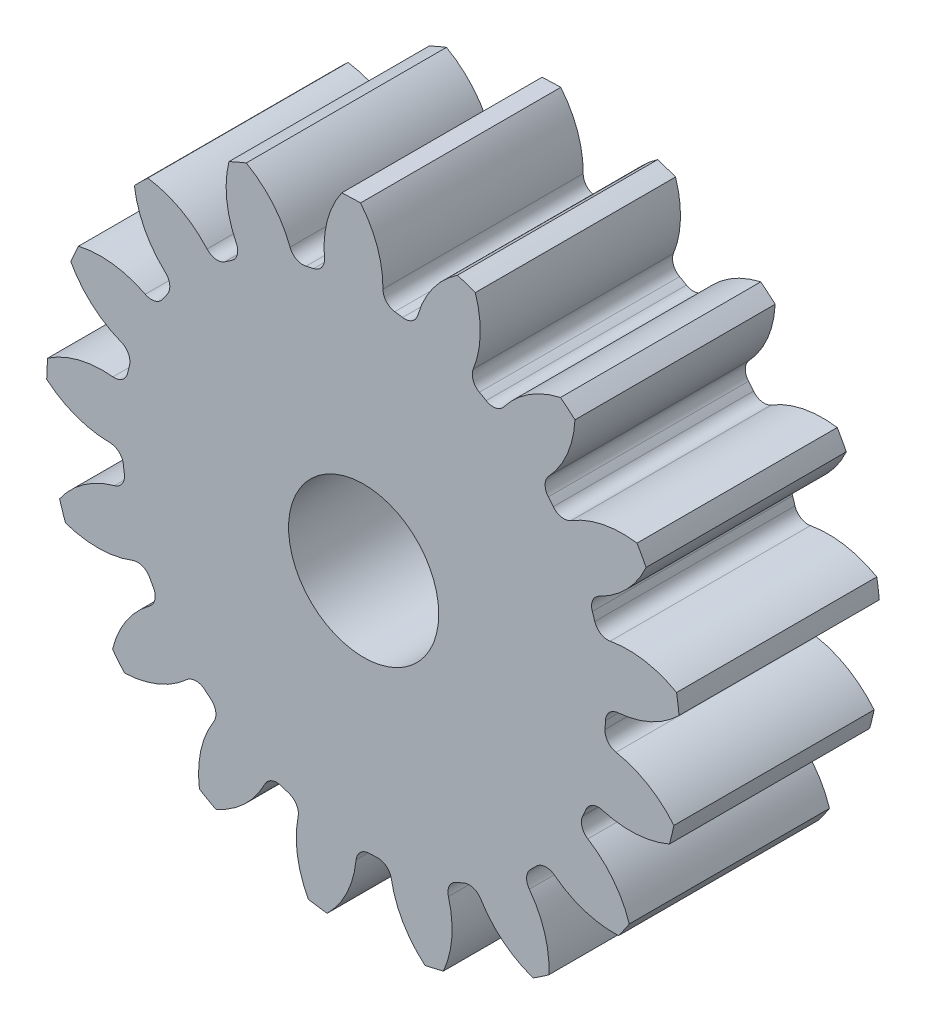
ISO-10303-21;
HEADER;
FILE_DESCRIPTION(('STEP AP214'),'2;1');
FILE_NAME('part.step','',(''),(''),'','','');
FILE_SCHEMA(('AUTOMOTIVE_DESIGN { 1 0 10303 214 1 1 1 1 }'));
ENDSEC;
DATA;
#1=APPLICATION_CONTEXT('core data for automotive mechanical design processes');
#2=APPLICATION_PROTOCOL_DEFINITION('international standard','automotive_design',2000,#1);
#3=PRODUCT_CONTEXT('',#1,'mechanical');
#4=PRODUCT('Part','Part','',(#3));
#5=PRODUCT_RELATED_PRODUCT_CATEGORY('part','',(#4));
#6=PRODUCT_DEFINITION_FORMATION('','',#4);
#7=PRODUCT_DEFINITION_CONTEXT('part definition',#1,'design');
#8=PRODUCT_DEFINITION('design','',#6,#7);
#9=PRODUCT_DEFINITION_SHAPE('','',#8);
#10=(LENGTH_UNIT() NAMED_UNIT(*) SI_UNIT(.MILLI.,.METRE.));
#11=(NAMED_UNIT(*) PLANE_ANGLE_UNIT() SI_UNIT($,.RADIAN.));
#12=(NAMED_UNIT(*) SI_UNIT($,.STERADIAN.) SOLID_ANGLE_UNIT());
#13=UNCERTAINTY_MEASURE_WITH_UNIT(LENGTH_MEASURE(1.E-05),#10,'distance_accuracy_value','');
#14=(GEOMETRIC_REPRESENTATION_CONTEXT(3) GLOBAL_UNCERTAINTY_ASSIGNED_CONTEXT((#13)) GLOBAL_UNIT_ASSIGNED_CONTEXT((#10,
#11,#12)) REPRESENTATION_CONTEXT('',''));
#15=CARTESIAN_POINT('',(0.,0.,0.));
#16=DIRECTION('',(0.,0.,1.));
#17=DIRECTION('',(1.,0.,0.));
#18=AXIS2_PLACEMENT_3D('',#15,#16,#17);
#19=CARTESIAN_POINT('',(0.,0.,101.6));
#20=DIRECTION('',(0.,0.,-1.));
#21=DIRECTION('',(-1.,0.,0.));
#22=AXIS2_PLACEMENT_3D('',#19,#20,#21);
#23=CYLINDRICAL_SURFACE('',#22,160.866666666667);
#24=DIRECTION('',(0.,0.,-1.));
#25=VECTOR('',#24,1.);
#26=CARTESIAN_POINT('',(158.767438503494,25.9033765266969,50.8));
#27=LINE('',#26,#25);
#28=CARTESIAN_POINT('',(158.767438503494,25.9033765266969,101.6));
#29=VERTEX_POINT('',#28);
#30=CARTESIAN_POINT('',(158.767438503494,25.9033765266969,0.));
#31=VERTEX_POINT('',#30);
#32=EDGE_CURVE('E708',#29,#31,#27,.T.);
#33=ORIENTED_EDGE('',*,*,#32,.F.);
#34=CARTESIAN_POINT('',(0.,0.,101.6));
#35=DIRECTION('',(0.,0.,1.));
#36=DIRECTION('',(1.,0.,0.));
#37=AXIS2_PLACEMENT_3D('',#34,#35,#36);
#38=CIRCLE('',#37,160.866666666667);
#39=CARTESIAN_POINT('',(160.027863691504,16.4063185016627,101.6));
#40=VERTEX_POINT('',#39);
#41=EDGE_CURVE('E1315',#40,#29,#38,.T.);
#42=ORIENTED_EDGE('',*,*,#41,.F.);
#43=DIRECTION('',(0.,0.,-1.));
#44=VECTOR('',#43,1.);
#45=CARTESIAN_POINT('',(160.027863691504,16.4063185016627,50.8));
#46=LINE('',#45,#44);
#47=CARTESIAN_POINT('',(160.027863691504,16.4063185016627,0.));
#48=VERTEX_POINT('',#47);
#49=EDGE_CURVE('E1309',#48,#40,#46,.F.);
#50=ORIENTED_EDGE('',*,*,#49,.F.);
#51=CARTESIAN_POINT('',(0.,0.,0.));
#52=DIRECTION('',(0.,0.,1.));
#53=DIRECTION('',(1.,0.,0.));
#54=AXIS2_PLACEMENT_3D('',#51,#52,#53);
#55=CIRCLE('',#54,160.866666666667);
#56=EDGE_CURVE('E1320',#48,#31,#55,.T.);
#57=ORIENTED_EDGE('',*,*,#56,.T.);
#58=EDGE_LOOP('',(#33,#42,#50,#57));
#59=FACE_BOUND('',#58,.T.);
#60=ADVANCED_FACE('F33',(#59),#23,.T.);
#61=DIRECTION('',(0.,0.,-1.));
#62=VECTOR('',#61,1.);
#63=CARTESIAN_POINT('',(143.294892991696,73.107168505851,50.8));
#64=LINE('',#63,#62);
#65=CARTESIAN_POINT('',(143.294892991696,73.107168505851,0.));
#66=VERTEX_POINT('',#65);
#67=CARTESIAN_POINT('',(143.294892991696,73.107168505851,101.6));
#68=VERTEX_POINT('',#67);
#69=EDGE_CURVE('E679',#66,#68,#64,.F.);
#70=ORIENTED_EDGE('',*,*,#69,.F.);
#71=CARTESIAN_POINT('',(138.688848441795,81.5075932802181,0.));
#72=VERTEX_POINT('',#71);
#73=EDGE_CURVE('E1323',#66,#72,#55,.T.);
#74=ORIENTED_EDGE('',*,*,#73,.T.);
#75=DIRECTION('',(0.,0.,-1.));
#76=VECTOR('',#75,1.);
#77=CARTESIAN_POINT('',(138.688848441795,81.5075932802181,50.8));
#78=LINE('',#77,#76);
#79=CARTESIAN_POINT('',(138.688848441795,81.5075932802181,101.6));
#80=VERTEX_POINT('',#79);
#81=EDGE_CURVE('E741',#80,#72,#78,.T.);
#82=ORIENTED_EDGE('',*,*,#81,.F.);
#83=EDGE_CURVE('E1318',#68,#80,#38,.T.);
#84=ORIENTED_EDGE('',*,*,#83,.F.);
#85=EDGE_LOOP('',(#70,#74,#82,#84));
#86=FACE_BOUND('',#85,.T.);
#87=ADVANCED_FACE('F1516',(#86),#23,.T.);
#88=CARTESIAN_POINT('',(0.,0.,101.6));
#89=DIRECTION('',(0.,0.,1.));
#90=DIRECTION('',(1.,0.,0.));
#91=AXIS2_PLACEMENT_3D('',#88,#89,#90);
#92=PLANE('',#91);
#93=CARTESIAN_POINT('',(0.,0.,101.599999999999));
#94=DIRECTION('',(0.,0.,1.));
#95=DIRECTION('',(1.,0.,0.));
#96=AXIS2_PLACEMENT_3D('',#93,#94,#95);
#97=CIRCLE('',#96,38.1);
#98=CARTESIAN_POINT('',(38.1,0.,101.599999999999));
#99=VERTEX_POINT('',#98);
#100=EDGE_CURVE('E696',#99,#99,#97,.T.);
#101=ORIENTED_EDGE('',*,*,#100,.F.);
#102=EDGE_LOOP('',(#101));
#103=FACE_BOUND('',#102,.T.);
#104=ORIENTED_EDGE('',*,*,#41,.T.);
#105=CARTESIAN_POINT('',(134.132643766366,-17.3733289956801,101.6));
#106=DIRECTION('',(0.,0.,-1.));
#107=DIRECTION('',(0.932472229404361,0.361241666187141,0.));
#108=AXIS2_PLACEMENT_3D('',#105,#106,#107);
#109=CIRCLE('',#108,49.797051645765);
#110=CARTESIAN_POINT('',(125.099610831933,31.5975875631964,101.6));
#111=VERTEX_POINT('',#110);
#112=EDGE_CURVE('E688',#111,#29,#109,.T.);
#113=ORIENTED_EDGE('',*,*,#112,.F.);
#114=CARTESIAN_POINT('',(123.849447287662,38.3751178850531,101.6));
#115=DIRECTION('',(0.,0.,1.));
#116=DIRECTION('',(-0.932472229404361,-0.361241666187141,0.));
#117=AXIS2_PLACEMENT_3D('',#114,#115,#116);
#118=CIRCLE('',#117,6.89186666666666);
#119=CARTESIAN_POINT('',(117.266356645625,36.3353277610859,101.6));
#120=VERTEX_POINT('',#119);
#121=EDGE_CURVE('E686',#120,#111,#118,.T.);
#122=ORIENTED_EDGE('',*,*,#121,.F.);
#123=CARTESIAN_POINT('',(0.,0.,101.6));
#124=DIRECTION('',(0.,0.,-1.));
#125=DIRECTION('',(0.932472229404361,0.361241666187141,0.));
#126=AXIS2_PLACEMENT_3D('',#123,#124,#125);
#127=CIRCLE('',#126,122.766666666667);
#128=CARTESIAN_POINT('',(116.021782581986,40.1322863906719,101.6));
#129=VERTEX_POINT('',#128);
#130=EDGE_CURVE('E671',#129,#120,#127,.T.);
#131=ORIENTED_EDGE('',*,*,#130,.F.);
#132=CARTESIAN_POINT('',(122.535005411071,42.3852299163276,101.6));
#133=DIRECTION('',(0.,0.,1.));
#134=DIRECTION('',(-0.932472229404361,-0.361241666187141,0.));
#135=AXIS2_PLACEMENT_3D('',#132,#133,#134);
#136=CIRCLE('',#135,6.89186666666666);
#137=CARTESIAN_POINT('',(119.530549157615,48.5877349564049,101.6));
#138=VERTEX_POINT('',#137);
#139=EDGE_CURVE('E663',#138,#129,#136,.T.);
#140=ORIENTED_EDGE('',*,*,#139,.F.);
#141=CARTESIAN_POINT('',(97.8219075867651,93.4038172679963,101.6));
#142=DIRECTION('',(0.,0.,-1.));
#143=DIRECTION('',(-0.932472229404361,-0.361241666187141,0.));
#144=AXIS2_PLACEMENT_3D('',#141,#142,#143);
#145=CIRCLE('',#144,49.797051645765);
#146=EDGE_CURVE('E693',#68,#138,#145,.T.);
#147=ORIENTED_EDGE('',*,*,#146,.F.);
#148=ORIENTED_EDGE('',*,*,#83,.T.);
#149=CARTESIAN_POINT('',(131.35093568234,32.2541529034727,101.6));
#150=DIRECTION('',(0.,0.,-1.));
#151=DIRECTION('',(0.739008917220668,0.673695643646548,0.));
#152=AXIS2_PLACEMENT_3D('',#149,#150,#151);
#153=CIRCLE('',#152,49.797051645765);
#154=CARTESIAN_POINT('',(105.237547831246,74.6550647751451,101.6));
#155=VERTEX_POINT('',#154);
#156=EDGE_CURVE('E717',#155,#80,#153,.T.);
#157=ORIENTED_EDGE('',*,*,#156,.F.);
#158=CARTESIAN_POINT('',(101.623478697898,80.5233124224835,101.6));
#159=DIRECTION('',(0.,0.,1.));
#160=DIRECTION('',(-0.739008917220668,-0.673695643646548,0.));
#161=AXIS2_PLACEMENT_3D('',#158,#159,#160);
#162=CIRCLE('',#161,6.89186666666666);
#163=CARTESIAN_POINT('',(96.2217866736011,76.2431781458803,101.6));
#164=VERTEX_POINT('',#163);
#165=EDGE_CURVE('E715',#164,#155,#162,.T.);
#166=ORIENTED_EDGE('',*,*,#165,.F.);
#167=CARTESIAN_POINT('',(0.,0.,101.6));
#168=DIRECTION('',(0.,0.,-1.));
#169=DIRECTION('',(0.739008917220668,0.673695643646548,0.));
#170=AXIS2_PLACEMENT_3D('',#167,#168,#169);
#171=CIRCLE('',#170,122.766666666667);
#172=CARTESIAN_POINT('',(93.6896362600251,79.3341446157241,101.6));
#173=VERTEX_POINT('',#172);
#174=EDGE_CURVE('E712',#173,#164,#171,.T.);
#175=ORIENTED_EDGE('',*,*,#174,.F.);
#176=CARTESIAN_POINT('',(98.9491785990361,83.7877993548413,101.6));
#177=DIRECTION('',(0.,0.,1.));
#178=DIRECTION('',(-0.739008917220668,-0.673695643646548,0.));
#179=AXIS2_PLACEMENT_3D('',#176,#177,#178);
#180=CIRCLE('',#179,6.89186666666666);
#181=CARTESIAN_POINT('',(93.9070033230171,88.4861282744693,101.6));
#182=VERTEX_POINT('',#181);
#183=EDGE_CURVE('E710',#182,#173,#180,.T.);
#184=ORIENTED_EDGE('',*,*,#183,.F.);
#185=CARTESIAN_POINT('',(57.4748616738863,122.433814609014,101.6));
#186=DIRECTION('',(0.,0.,-1.));
#187=DIRECTION('',(-0.739008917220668,-0.673695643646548,0.));
#188=AXIS2_PLACEMENT_3D('',#185,#186,#187);
#189=CIRCLE('',#188,49.797051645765);
#190=CARTESIAN_POINT('',(107.209152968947,119.934490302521,101.6));
#191=VERTEX_POINT('',#190);
#192=EDGE_CURVE('E720',#191,#182,#189,.T.);
#193=ORIENTED_EDGE('',*,*,#192,.F.);
#194=CARTESIAN_POINT('',(99.8795608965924,126.10375791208,101.6));
#195=VERTEX_POINT('',#194);
#196=EDGE_CURVE('E1365',#191,#195,#38,.T.);
#197=ORIENTED_EDGE('',*,*,#196,.T.);
#198=CARTESIAN_POINT('',(110.829555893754,77.5255327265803,101.6));
#199=DIRECTION('',(0.,0.,-1.));
#200=DIRECTION('',(0.445738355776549,0.895163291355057,0.));
#201=AXIS2_PLACEMENT_3D('',#198,#199,#200);
#202=CIRCLE('',#201,49.797051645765);
#203=CARTESIAN_POINT('',(71.1625708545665,107.629961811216,101.6));
#204=VERTEX_POINT('',#203);
#205=EDGE_CURVE('E752',#204,#195,#202,.T.);
#206=ORIENTED_EDGE('',*,*,#205,.F.);
#207=CARTESIAN_POINT('',(65.6726961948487,111.79638742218,101.6));
#208=DIRECTION('',(0.,0.,1.));
#209=DIRECTION('',(-0.445738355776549,-0.895163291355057,0.));
#210=AXIS2_PLACEMENT_3D('',#207,#208,#209);
#211=CIRCLE('',#210,6.89186666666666);
#212=CARTESIAN_POINT('',(62.1819312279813,105.853964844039,101.6));
#213=VERTEX_POINT('',#212);
#214=EDGE_CURVE('E750',#213,#204,#211,.T.);
#215=ORIENTED_EDGE('',*,*,#214,.F.);
#216=CARTESIAN_POINT('',(0.,0.,101.6));
#217=DIRECTION('',(0.,0.,-1.));
#218=DIRECTION('',(0.445738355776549,0.895163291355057,0.));
#219=AXIS2_PLACEMENT_3D('',#216,#217,#218);
#220=CIRCLE('',#219,122.766666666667);
#221=CARTESIAN_POINT('',(58.704185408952,107.821487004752,101.6));
#222=VERTEX_POINT('',#221);
#223=EDGE_CURVE('E747',#222,#213,#220,.T.);
#224=ORIENTED_EDGE('',*,*,#223,.F.);
#225=CARTESIAN_POINT('',(61.9997169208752,113.87436220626,101.6));
#226=DIRECTION('',(0.,0.,1.));
#227=DIRECTION('',(-0.445738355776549,-0.895163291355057,0.));
#228=AXIS2_PLACEMENT_3D('',#225,#226,#227);
#229=CIRCLE('',#228,6.89186666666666);
#230=CARTESIAN_POINT('',(55.6007963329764,116.433979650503,101.6));
#231=VERTEX_POINT('',#230);
#232=EDGE_CURVE('E745',#231,#222,#229,.T.);
#233=ORIENTED_EDGE('',*,*,#232,.F.);
#234=CARTESIAN_POINT('',(9.36551721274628,134.928446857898,101.6));
#235=DIRECTION('',(0.,0.,-1.));
#236=DIRECTION('',(-0.445738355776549,-0.895163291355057,0.));
#237=AXIS2_PLACEMENT_3D('',#234,#235,#236);
#238=CIRCLE('',#237,49.797051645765);
#239=CARTESIAN_POINT('',(56.6442227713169,150.563994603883,101.6));
#240=VERTEX_POINT('',#239);
#241=EDGE_CURVE('E755',#240,#231,#238,.T.);
#242=ORIENTED_EDGE('',*,*,#241,.F.);
#243=CARTESIAN_POINT('',(47.5809852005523,153.668911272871,101.6));
#244=VERTEX_POINT('',#243);
#245=EDGE_CURVE('E1498',#240,#244,#38,.T.);
#246=ORIENTED_EDGE('',*,*,#245,.T.);
#247=CARTESIAN_POINT('',(75.340030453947,112.326659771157,101.6));
#248=DIRECTION('',(0.,0.,-1.));
#249=DIRECTION('',(0.092268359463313,0.995734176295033,0.));
#250=AXIS2_PLACEMENT_3D('',#247,#248,#249);
#251=CIRCLE('',#250,49.797051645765);
#252=CARTESIAN_POINT('',(27.4766943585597,126.068836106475,101.6));
#253=VERTEX_POINT('',#252);
#254=EDGE_CURVE('E790',#253,#244,#251,.T.);
#255=ORIENTED_EDGE('',*,*,#254,.F.);
#256=CARTESIAN_POINT('',(20.8524521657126,127.970740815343,101.6));
#257=DIRECTION('',(0.,0.,1.));
#258=DIRECTION('',(-0.092268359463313,-0.995734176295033,0.));
#259=AXIS2_PLACEMENT_3D('',#256,#257,#258);
#260=CIRCLE('',#259,6.89186666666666);
#261=CARTESIAN_POINT('',(19.744061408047,121.168587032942,101.6));
#262=VERTEX_POINT('',#261);
#263=EDGE_CURVE('E788',#262,#253,#260,.T.);
#264=ORIENTED_EDGE('',*,*,#263,.F.);
#265=CARTESIAN_POINT('',(0.,0.,101.6));
#266=DIRECTION('',(0.,0.,-1.));
#267=DIRECTION('',(0.092268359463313,0.995734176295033,0.));
#268=AXIS2_PLACEMENT_3D('',#265,#266,#267);
#269=CIRCLE('',#268,122.766666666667);
#270=CARTESIAN_POINT('',(15.7904090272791,121.746940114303,101.6));
#271=VERTEX_POINT('',#270);
#272=EDGE_CURVE('E785',#271,#262,#269,.T.);
#273=ORIENTED_EDGE('',*,*,#272,.F.);
#274=CARTESIAN_POINT('',(16.6768499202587,128.581561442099,101.6));
#275=DIRECTION('',(0.,0.,1.));
#276=DIRECTION('',(-0.092268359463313,-0.995734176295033,0.));
#277=AXIS2_PLACEMENT_3D('',#274,#275,#276);
#278=CIRCLE('',#277,6.89186666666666);
#279=CARTESIAN_POINT('',(9.78539370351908,128.656776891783,101.6));
#280=VERTEX_POINT('',#279);
#281=EDGE_CURVE('E783',#280,#271,#278,.T.);
#282=ORIENTED_EDGE('',*,*,#281,.F.);
#283=CARTESIAN_POINT('',(-40.0086922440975,129.200244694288,101.6));
#284=DIRECTION('',(0.,0.,-1.));
#285=DIRECTION('',(-0.092268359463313,-0.995734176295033,0.));
#286=AXIS2_PLACEMENT_3D('',#283,#284,#285);
#287=CIRCLE('',#286,49.797051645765);
#288=CARTESIAN_POINT('',(-1.57082358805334,160.858997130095,101.6));
#289=VERTEX_POINT('',#288);
#290=EDGE_CURVE('E793',#289,#280,#287,.T.);
#291=ORIENTED_EDGE('',*,*,#290,.F.);
#292=CARTESIAN_POINT('',(-11.143666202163,160.480226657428,101.6));
#293=VERTEX_POINT('',#292);
#294=EDGE_CURVE('E1494',#289,#293,#38,.T.);
#295=ORIENTED_EDGE('',*,*,#294,.T.);
#296=CARTESIAN_POINT('',(29.6754164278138,131.95744899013,101.6));
#297=DIRECTION('',(0.,0.,-1.));
#298=DIRECTION('',(-0.273662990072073,0.961825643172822,0.));
#299=AXIS2_PLACEMENT_3D('',#296,#297,#298);
#300=CIRCLE('',#299,49.797051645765);
#301=CARTESIAN_POINT('',(-19.92006196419,127.481415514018,101.6));
#302=VERTEX_POINT('',#301);
#303=EDGE_CURVE('E828',#302,#293,#300,.T.);
#304=ORIENTED_EDGE('',*,*,#303,.F.);
#305=CARTESIAN_POINT('',(-26.7840310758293,126.86193655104,101.6));
#306=DIRECTION('',(0.,0.,1.));
#307=DIRECTION('',(0.273662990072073,-0.961825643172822,0.));
#308=AXIS2_PLACEMENT_3D('',#305,#306,#307);
#309=CIRCLE('',#308,6.89186666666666);
#310=CARTESIAN_POINT('',(-25.3603533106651,120.118720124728,101.6));
#311=VERTEX_POINT('',#310);
#312=EDGE_CURVE('E826',#311,#302,#309,.T.);
#313=ORIENTED_EDGE('',*,*,#312,.F.);
#314=CARTESIAN_POINT('',(0.,0.,101.6));
#315=DIRECTION('',(0.,0.,-1.));
#316=DIRECTION('',(-0.273662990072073,0.961825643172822,0.));
#317=AXIS2_PLACEMENT_3D('',#314,#315,#316);
#318=CIRCLE('',#317,122.766666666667);
#319=CARTESIAN_POINT('',(-29.2559495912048,119.229794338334,101.6));
#320=VERTEX_POINT('',#319);
#321=EDGE_CURVE('E823',#320,#311,#318,.T.);
#322=ORIENTED_EDGE('',*,*,#321,.F.);
#323=CARTESIAN_POINT('',(-30.8983180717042,125.923108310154,101.6));
#324=DIRECTION('',(0.,0.,1.));
#325=DIRECTION('',(0.273662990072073,-0.961825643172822,0.));
#326=AXIS2_PLACEMENT_3D('',#323,#324,#325);
#327=CIRCLE('',#326,6.89186666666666);
#328=CARTESIAN_POINT('',(-37.3515805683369,123.503763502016,101.6));
#329=VERTEX_POINT('',#328);
#330=EDGE_CURVE('E821',#329,#320,#327,.T.);
#331=ORIENTED_EDGE('',*,*,#330,.F.);
#332=CARTESIAN_POINT('',(-83.9795061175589,106.022833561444,101.6));
#333=DIRECTION('',(0.,0.,-1.));
#334=DIRECTION('',(0.273662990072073,-0.961825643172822,0.));
#335=AXIS2_PLACEMENT_3D('',#332,#333,#334);
#336=CIRCLE('',#335,49.797051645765);
#337=CARTESIAN_POINT('',(-59.573721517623,149.429100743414,101.6));
#338=VERTEX_POINT('',#337);
#339=EDGE_CURVE('E831',#338,#329,#336,.T.);
#340=ORIENTED_EDGE('',*,*,#339,.F.);
#341=CARTESIAN_POINT('',(-68.3633037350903,145.617798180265,101.6));
#342=VERTEX_POINT('',#341);
#343=EDGE_CURVE('E1490',#338,#342,#38,.T.);
#344=ORIENTED_EDGE('',*,*,#343,.T.);
#345=CARTESIAN_POINT('',(-19.9970270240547,133.766653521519,101.6));
#346=DIRECTION('',(0.,0.,-1.));
#347=DIRECTION('',(-0.602634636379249,0.798017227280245,0.));
#348=AXIS2_PLACEMENT_3D('',#345,#346,#347);
#349=CIRCLE('',#348,49.797051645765);
#350=CARTESIAN_POINT('',(-64.6265035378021,111.676923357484,101.6));
#351=VERTEX_POINT('',#350);
#352=EDGE_CURVE('E866',#351,#342,#349,.T.);
#353=ORIENTED_EDGE('',*,*,#352,.F.);
#354=CARTESIAN_POINT('',(-70.8031825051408,108.619724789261,101.6));
#355=DIRECTION('',(0.,0.,1.));
#356=DIRECTION('',(0.602634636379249,-0.798017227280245,0.));
#357=AXIS2_PLACEMENT_3D('',#354,#355,#356);
#358=CIRCLE('',#357,6.89186666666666);
#359=CARTESIAN_POINT('',(-67.0397117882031,102.846154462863,101.6));
#360=VERTEX_POINT('',#359);
#361=EDGE_CURVE('E864',#360,#351,#358,.T.);
#362=ORIENTED_EDGE('',*,*,#361,.F.);
#363=CARTESIAN_POINT('',(0.,0.,101.6));
#364=DIRECTION('',(0.,0.,-1.));
#365=DIRECTION('',(-0.602634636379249,0.798017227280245,0.));
#366=AXIS2_PLACEMENT_3D('',#363,#364,#365);
#367=CIRCLE('',#366,122.766666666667);
#368=CARTESIAN_POINT('',(-70.3511301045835,100.610004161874,101.6));
#369=VERTEX_POINT('',#368);
#370=EDGE_CURVE('E861',#369,#360,#367,.T.);
#371=ORIENTED_EDGE('',*,*,#370,.F.);
#372=CARTESIAN_POINT('',(-74.3004969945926,106.258041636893,101.6));
#373=DIRECTION('',(0.,0.,1.));
#374=DIRECTION('',(0.602634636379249,-0.798017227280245,0.));
#375=AXIS2_PLACEMENT_3D('',#372,#373,#374);
#376=CIRCLE('',#375,6.89186666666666);
#377=CARTESIAN_POINT('',(-79.4440169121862,101.670882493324,101.6));
#378=VERTEX_POINT('',#377);
#379=EDGE_CURVE('E859',#378,#369,#376,.T.);
#380=ORIENTED_EDGE('',*,*,#379,.F.);
#381=CARTESIAN_POINT('',(-116.608422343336,68.5264512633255,101.6));
#382=DIRECTION('',(0.,0.,-1.));
#383=DIRECTION('',(0.602634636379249,-0.798017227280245,0.));
#384=AXIS2_PLACEMENT_3D('',#381,#382,#383);
#385=CIRCLE('',#384,49.797051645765);
#386=CARTESIAN_POINT('',(-109.530858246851,117.817976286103,101.6));
#387=VERTEX_POINT('',#386);
#388=EDGE_CURVE('E869',#387,#378,#385,.T.);
#389=ORIENTED_EDGE('',*,*,#388,.F.);
#390=CARTESIAN_POINT('',(-116.35009828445,111.088879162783,101.6));
#391=VERTEX_POINT('',#390);
#392=EDGE_CURVE('E1486',#387,#391,#38,.T.);
#393=ORIENTED_EDGE('',*,*,#392,.T.);
#394=CARTESIAN_POINT('',(-66.9687611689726,117.509930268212,101.6));
#395=DIRECTION('',(0.,0.,-1.));
#396=DIRECTION('',(-0.85021713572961,0.526432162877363,0.));
#397=AXIS2_PLACEMENT_3D('',#394,#395,#396);
#398=CIRCLE('',#397,49.797051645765);
#399=CARTESIAN_POINT('',(-100.604777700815,80.7898438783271,101.6));
#400=VERTEX_POINT('',#399);
#401=EDGE_CURVE('E904',#400,#391,#398,.T.);
#402=ORIENTED_EDGE('',*,*,#401,.F.);
#403=CARTESIAN_POINT('',(-105.259971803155,75.7078173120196,101.6));
#404=DIRECTION('',(0.,0.,1.));
#405=DIRECTION('',(0.85021713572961,-0.526432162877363,0.));
#406=AXIS2_PLACEMENT_3D('',#403,#404,#405);
#407=CIRCLE('',#406,6.89186666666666);
#408=CARTESIAN_POINT('',(-99.6649857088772,71.6836457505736,101.6));
#409=VERTEX_POINT('',#408);
#410=EDGE_CURVE('E902',#409,#400,#407,.T.);
#411=ORIENTED_EDGE('',*,*,#410,.F.);
#412=CARTESIAN_POINT('',(0.,0.,101.6));
#413=DIRECTION('',(0.,0.,-1.));
#414=DIRECTION('',(-0.85021713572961,0.526432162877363,0.));
#415=AXIS2_PLACEMENT_3D('',#412,#413,#414);
#416=CIRCLE('',#415,122.766666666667);
#417=CARTESIAN_POINT('',(-101.945000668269,68.4022754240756,101.6));
#418=VERTEX_POINT('',#417);
#419=EDGE_CURVE('E899',#418,#409,#416,.T.);
#420=ORIENTED_EDGE('',*,*,#419,.F.);
#421=CARTESIAN_POINT('',(-107.667982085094,72.242237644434,101.6));
#422=DIRECTION('',(0.,0.,1.));
#423=DIRECTION('',(0.85021713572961,-0.526432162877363,0.));
#424=AXIS2_PLACEMENT_3D('',#421,#422,#423);
#425=CIRCLE('',#424,6.89186666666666);
#426=CARTESIAN_POINT('',(-110.80709855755,66.1067854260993,101.6));
#427=VERTEX_POINT('',#426);
#428=EDGE_CURVE('E897',#427,#418,#425,.T.);
#429=ORIENTED_EDGE('',*,*,#428,.F.);
#430=CARTESIAN_POINT('',(-133.488724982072,21.77519200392,101.6));
#431=DIRECTION('',(0.,0.,-1.));
#432=DIRECTION('',(0.85021713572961,-0.526432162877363,0.));
#433=AXIS2_PLACEMENT_3D('',#430,#431,#432);
#434=CIRCLE('',#433,49.797051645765);
#435=CARTESIAN_POINT('',(-144.695245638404,70.2948812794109,101.6));
#436=VERTEX_POINT('',#435);
#437=EDGE_CURVE('E907',#436,#427,#434,.T.);
#438=ORIENTED_EDGE('',*,*,#437,.F.);
#439=CARTESIAN_POINT('',(-148.623167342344,61.5567914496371,101.6));
#440=VERTEX_POINT('',#439);
#441=EDGE_CURVE('E1482',#436,#440,#38,.T.);
#442=ORIENTED_EDGE('',*,*,#441,.T.);
#443=CARTESIAN_POINT('',(-104.895993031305,85.3828397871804,101.6));
#444=DIRECTION('',(0.,0.,-1.));
#445=DIRECTION('',(-0.9829730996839,0.183749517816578,0.));
#446=AXIS2_PLACEMENT_3D('',#443,#444,#445);
#447=CIRCLE('',#446,49.797051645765);
#448=CARTESIAN_POINT('',(-122.995819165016,38.9916483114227,101.6));
#449=VERTEX_POINT('',#448);
#450=EDGE_CURVE('E942',#449,#440,#447,.T.);
#451=ORIENTED_EDGE('',*,*,#450,.F.);
#452=CARTESIAN_POINT('',(-125.500818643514,32.5711495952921,101.6));
#453=DIRECTION('',(0.,0.,1.));
#454=DIRECTION('',(0.9829730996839,-0.183749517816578,0.));
#455=AXIS2_PLACEMENT_3D('',#452,#453,#454);
#456=CIRCLE('',#455,6.89186666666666);
#457=CARTESIAN_POINT('',(-118.829951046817,30.8398634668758,101.6));
#458=VERTEX_POINT('',#457);
#459=EDGE_CURVE('E940',#458,#449,#456,.T.);
#460=ORIENTED_EDGE('',*,*,#459,.F.);
#461=CARTESIAN_POINT('',(0.,0.,101.6));
#462=DIRECTION('',(0.,0.,-1.));
#463=DIRECTION('',(-0.9829730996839,0.183749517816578,0.));
#464=AXIS2_PLACEMENT_3D('',#461,#462,#463);
#465=CIRCLE('',#464,122.766666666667);
#466=CARTESIAN_POINT('',(-119.770633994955,26.9564403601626,101.6));
#467=VERTEX_POINT('',#466);
#468=EDGE_CURVE('E937',#467,#458,#465,.T.);
#469=ORIENTED_EDGE('',*,*,#468,.F.);
#470=CARTESIAN_POINT('',(-126.49430958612,28.4697191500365,101.6));
#471=DIRECTION('',(0.,0.,1.));
#472=DIRECTION('',(0.9829730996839,-0.183749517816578,0.));
#473=AXIS2_PLACEMENT_3D('',#470,#471,#472);
#474=CIRCLE('',#473,6.89186666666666);
#475=CARTESIAN_POINT('',(-127.205067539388,21.6146006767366,101.6));
#476=VERTEX_POINT('',#475);
#477=EDGE_CURVE('E935',#476,#467,#474,.T.);
#478=ORIENTED_EDGE('',*,*,#477,.F.);
#479=CARTESIAN_POINT('',(-132.340635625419,-27.9169275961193,101.6));
#480=DIRECTION('',(0.,0.,-1.));
#481=DIRECTION('',(0.9829730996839,-0.183749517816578,0.));
#482=AXIS2_PLACEMENT_3D('',#479,#480,#481);
#483=CIRCLE('',#482,49.797051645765);
#484=CARTESIAN_POINT('',(-160.317738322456,13.2780730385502,101.6));
#485=VERTEX_POINT('',#484);
#486=EDGE_CURVE('E945',#485,#476,#483,.T.);
#487=ORIENTED_EDGE('',*,*,#486,.F.);
#488=CARTESIAN_POINT('',(-160.823854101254,3.7111179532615,101.6));
#489=VERTEX_POINT('',#488);
#490=EDGE_CURVE('E1478',#485,#489,#38,.T.);
#491=ORIENTED_EDGE('',*,*,#490,.T.);
#492=CARTESIAN_POINT('',(-128.656439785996,41.7243236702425,101.6));
#493=DIRECTION('',(0.,0.,-1.));
#494=DIRECTION('',(-0.982973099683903,-0.183749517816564,0.));
#495=AXIS2_PLACEMENT_3D('',#492,#493,#494);
#496=CIRCLE('',#495,49.797051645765);
#497=CARTESIAN_POINT('',(-128.775593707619,-8.07258542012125,101.6));
#498=VERTEX_POINT('',#497);
#499=EDGE_CURVE('E980',#498,#489,#496,.T.);
#500=ORIENTED_EDGE('',*,*,#499,.F.);
#501=CARTESIAN_POINT('',(-128.792084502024,-14.96443235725,101.6));
#502=DIRECTION('',(0.,0.,1.));
#503=DIRECTION('',(0.982973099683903,0.183749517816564,0.));
#504=AXIS2_PLACEMENT_3D('',#501,#502,#503);
#505=CIRCLE('',#504,6.89186666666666);
#506=CARTESIAN_POINT('',(-121.946273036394,-14.1690132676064,101.6));
#507=VERTEX_POINT('',#506);
#508=EDGE_CURVE('E978',#507,#498,#505,.T.);
#509=ORIENTED_EDGE('',*,*,#508,.F.);
#510=CARTESIAN_POINT('',(0.,0.,101.6));
#511=DIRECTION('',(0.,0.,-1.));
#512=DIRECTION('',(-0.982973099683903,-0.183749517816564,0.));
#513=AXIS2_PLACEMENT_3D('',#510,#511,#512);
#514=CIRCLE('',#513,122.766666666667);
#515=CARTESIAN_POINT('',(-121.420579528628,-18.1300113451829,101.6));
#516=VERTEX_POINT('',#515);
#517=EDGE_CURVE('E975',#516,#507,#514,.T.);
#518=ORIENTED_EDGE('',*,*,#517,.F.);
#519=CARTESIAN_POINT('',(-128.236879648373,-19.1477926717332,101.6));
#520=DIRECTION('',(0.,0.,1.));
#521=DIRECTION('',(0.982973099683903,0.183749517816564,0.));
#522=AXIS2_PLACEMENT_3D('',#519,#520,#521);
#523=CIRCLE('',#522,6.89186666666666);
#524=CARTESIAN_POINT('',(-126.423287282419,-25.7967556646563,101.6));
#525=VERTEX_POINT('',#524);
#526=EDGE_CURVE('E973',#525,#516,#523,.T.);
#527=ORIENTED_EDGE('',*,*,#526,.F.);
#528=CARTESIAN_POINT('',(-113.319210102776,-73.8387114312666,101.6));
#529=DIRECTION('',(0.,0.,-1.));
#530=DIRECTION('',(0.982973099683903,0.183749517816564,0.));
#531=AXIS2_PLACEMENT_3D('',#528,#529,#530);
#532=CIRCLE('',#531,49.797051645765);
#533=CARTESIAN_POINT('',(-154.288432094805,-45.5320125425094,101.6));
#534=VERTEX_POINT('',#533);
#535=EDGE_CURVE('E983',#534,#525,#532,.T.);
#536=ORIENTED_EDGE('',*,*,#535,.F.);
#537=CARTESIAN_POINT('',(-151.304388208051,-54.6357625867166,101.6));
#538=VERTEX_POINT('',#537);
#539=EDGE_CURVE('E1474',#534,#538,#38,.T.);
#540=ORIENTED_EDGE('',*,*,#539,.T.);
#541=CARTESIAN_POINT('',(-135.041121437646,-7.56929356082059,101.6));
#542=DIRECTION('',(0.,0.,-1.));
#543=DIRECTION('',(-0.850217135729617,-0.526432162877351,0.));
#544=AXIS2_PLACEMENT_3D('',#541,#542,#543);
#545=CIRCLE('',#544,49.797051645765);
#546=CARTESIAN_POINT('',(-117.16351074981,-54.0465717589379,101.6));
#547=VERTEX_POINT('',#546);
#548=EDGE_CURVE('E1018',#547,#538,#545,.T.);
#549=ORIENTED_EDGE('',*,*,#548,.F.);
#550=CARTESIAN_POINT('',(-114.689265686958,-60.4789847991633,101.6));
#551=DIRECTION('',(0.,0.,1.));
#552=DIRECTION('',(0.850217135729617,0.526432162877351,0.));
#553=AXIS2_PLACEMENT_3D('',#550,#551,#552);
#554=CIRCLE('',#553,6.89186666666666);
#555=CARTESIAN_POINT('',(-108.593075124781,-57.2642862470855,101.6));
#556=VERTEX_POINT('',#555);
#557=EDGE_CURVE('E1016',#556,#547,#554,.T.);
#558=ORIENTED_EDGE('',*,*,#557,.F.);
#559=CARTESIAN_POINT('',(0.,0.,101.6));
#560=DIRECTION('',(0.,0.,-1.));
#561=DIRECTION('',(-0.850217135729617,-0.526432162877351,0.));
#562=AXIS2_PLACEMENT_3D('',#559,#560,#561);
#563=CIRCLE('',#562,122.766666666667);
#564=CARTESIAN_POINT('',(-106.672002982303,-60.7679045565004,101.6));
#565=VERTEX_POINT('',#564);
#566=EDGE_CURVE('E1013',#565,#556,#563,.T.);
#567=ORIENTED_EDGE('',*,*,#566,.F.);
#568=CARTESIAN_POINT('',(-112.660348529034,-64.1792889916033,101.6));
#569=DIRECTION('',(0.,0.,1.));
#570=DIRECTION('',(0.850217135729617,0.526432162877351,0.));
#571=AXIS2_PLACEMENT_3D('',#568,#569,#570);
#572=CIRCLE('',#571,6.89186666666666);
#573=CARTESIAN_POINT('',(-108.567341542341,-69.7241172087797,101.6));
#574=VERTEX_POINT('',#573);
#575=EDGE_CURVE('E1011',#574,#565,#572,.T.);
#576=ORIENTED_EDGE('',*,*,#575,.F.);
#577=CARTESIAN_POINT('',(-78.9933973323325,-109.788168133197,101.6));
#578=DIRECTION('',(0.,0.,-1.));
#579=DIRECTION('',(0.850217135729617,0.526432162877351,0.));
#580=AXIS2_PLACEMENT_3D('',#577,#578,#579);
#581=CIRCLE('',#580,49.797051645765);
#582=CARTESIAN_POINT('',(-127.421618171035,-98.1927475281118,101.6));
#583=VERTEX_POINT('',#582);
#584=EDGE_CURVE('E1021',#583,#574,#581,.T.);
#585=ORIENTED_EDGE('',*,*,#584,.F.);
#586=CARTESIAN_POINT('',(-121.350426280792,-105.603780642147,101.6));
#587=VERTEX_POINT('',#586);
#588=EDGE_CURVE('E1470',#583,#587,#38,.T.);
#589=ORIENTED_EDGE('',*,*,#588,.T.);
#590=CARTESIAN_POINT('',(-123.187751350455,-55.8406357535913,101.6));
#591=DIRECTION('',(0.,0.,-1.));
#592=DIRECTION('',(-0.602634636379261,-0.798017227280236,0.));
#593=AXIS2_PLACEMENT_3D('',#590,#591,#592);
#594=CIRCLE('',#593,49.797051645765);
#595=CARTESIAN_POINT('',(-89.7278464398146,-92.7212690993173,101.6));
#596=VERTEX_POINT('',#595);
#597=EDGE_CURVE('E1056',#596,#587,#594,.T.);
#598=ORIENTED_EDGE('',*,*,#597,.F.);
#599=CARTESIAN_POINT('',(-85.097026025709,-97.8255152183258,101.6));
#600=DIRECTION('',(0.,0.,1.));
#601=DIRECTION('',(0.602634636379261,0.798017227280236,0.));
#602=AXIS2_PLACEMENT_3D('',#599,#600,#601);
#603=CIRCLE('',#602,6.89186666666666);
#604=CARTESIAN_POINT('',(-80.5737806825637,-92.6257000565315,101.6));
#605=VERTEX_POINT('',#604);
#606=EDGE_CURVE('E1054',#605,#596,#603,.T.);
#607=ORIENTED_EDGE('',*,*,#606,.F.);
#608=CARTESIAN_POINT('',(0.,0.,101.6));
#609=DIRECTION('',(0.,0.,-1.));
#610=DIRECTION('',(-0.602634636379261,-0.798017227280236,0.));
#611=AXIS2_PLACEMENT_3D('',#608,#609,#610);
#612=CIRCLE('',#611,122.766666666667);
#613=CARTESIAN_POINT('',(-77.5167813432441,-95.1987555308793,101.6));
#614=VERTEX_POINT('',#613);
#615=EDGE_CURVE('E1051',#614,#605,#612,.T.);
#616=ORIENTED_EDGE('',*,*,#615,.F.);
#617=CARTESIAN_POINT('',(-81.8684130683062,-100.54301670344,101.6));
#618=DIRECTION('',(0.,0.,1.));
#619=DIRECTION('',(0.602634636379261,0.798017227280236,0.));
#620=AXIS2_PLACEMENT_3D('',#617,#618,#619);
#621=CIRCLE('',#620,6.89186666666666);
#622=CARTESIAN_POINT('',(-76.0487747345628,-104.234850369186,101.6));
#623=VERTEX_POINT('',#622);
#624=EDGE_CURVE('E1049',#623,#614,#621,.T.);
#625=ORIENTED_EDGE('',*,*,#624,.F.);
#626=CARTESIAN_POINT('',(-33.9990885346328,-130.910124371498,101.6));
#627=DIRECTION('',(0.,0.,-1.));
#628=DIRECTION('',(0.602634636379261,0.798017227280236,0.));
#629=AXIS2_PLACEMENT_3D('',#626,#627,#628);
#630=CIRCLE('',#629,49.797051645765);
#631=CARTESIAN_POINT('',(-83.3458086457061,-137.592007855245,101.6));
#632=VERTEX_POINT('',#631);
#633=EDGE_CURVE('E1059',#632,#623,#630,.T.);
#634=ORIENTED_EDGE('',*,*,#633,.F.);
#635=CARTESIAN_POINT('',(-75.0074168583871,-142.309422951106,101.6));
#636=VERTEX_POINT('',#635);
#637=EDGE_CURVE('E1466',#632,#636,#38,.T.);
#638=ORIENTED_EDGE('',*,*,#637,.T.);
#639=CARTESIAN_POINT('',(-94.6971928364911,-96.5703906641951,101.6));
#640=DIRECTION('',(0.,0.,-1.));
#641=DIRECTION('',(-0.273662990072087,-0.961825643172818,0.));
#642=AXIS2_PLACEMENT_3D('',#639,#640,#641);
#643=CIRCLE('',#642,49.797051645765);
#644=CARTESIAN_POINT('',(-50.1739392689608,-118.873445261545,101.6));
#645=VERTEX_POINT('',#644);
#646=EDGE_CURVE('E1094',#645,#636,#643,.T.);
#647=ORIENTED_EDGE('',*,*,#646,.F.);
#648=CARTESIAN_POINT('',(-44.0119614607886,-121.960167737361,101.6));
#649=DIRECTION('',(0.,0.,1.));
#650=DIRECTION('',(0.273662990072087,0.961825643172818,0.));
#651=AXIS2_PLACEMENT_3D('',#648,#649,#650);
#652=CIRCLE('',#651,6.89186666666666);
#653=CARTESIAN_POINT('',(-41.6725506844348,-115.477499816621,101.6));
#654=VERTEX_POINT('',#653);
#655=EDGE_CURVE('E1092',#654,#645,#652,.T.);
#656=ORIENTED_EDGE('',*,*,#655,.F.);
#657=CARTESIAN_POINT('',(0.,0.,101.6));
#658=DIRECTION('',(0.,0.,-1.));
#659=DIRECTION('',(-0.273662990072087,-0.961825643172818,0.));
#660=AXIS2_PLACEMENT_3D('',#657,#658,#659);
#661=CIRCLE('',#660,122.766666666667);
#662=CARTESIAN_POINT('',(-37.8924888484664,-116.772487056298,101.6));
#663=VERTEX_POINT('',#662);
#664=EDGE_CURVE('E1089',#663,#654,#661,.T.);
#665=ORIENTED_EDGE('',*,*,#664,.F.);
#666=CARTESIAN_POINT('',(-40.0196947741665,-123.32785288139,101.6));
#667=DIRECTION('',(0.,0.,1.));
#668=DIRECTION('',(0.273662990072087,0.961825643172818,0.));
#669=AXIS2_PLACEMENT_3D('',#666,#667,#668);
#670=CIRCLE('',#669,6.89186666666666);
#671=CARTESIAN_POINT('',(-33.2593994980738,-124.66808940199,101.6));
#672=VERTEX_POINT('',#671);
#673=EDGE_CURVE('E1087',#672,#663,#670,.T.);
#674=ORIENTED_EDGE('',*,*,#673,.F.);
#675=CARTESIAN_POINT('',(15.5869855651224,-134.351942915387,101.6));
#676=DIRECTION('',(0.,0.,-1.));
#677=DIRECTION('',(0.273662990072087,0.961825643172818,0.));
#678=AXIS2_PLACEMENT_3D('',#675,#676,#677);
#679=CIRCLE('',#678,49.797051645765);
#680=CARTESIAN_POINT('',(-28.0136858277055,-158.408705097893,101.6));
#681=VERTEX_POINT('',#680);
#682=EDGE_CURVE('E1097',#681,#672,#679,.T.);
#683=ORIENTED_EDGE('',*,*,#682,.F.);
#684=CARTESIAN_POINT('',(-18.5342401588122,-159.795389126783,101.6));
#685=VERTEX_POINT('',#684);
#686=EDGE_CURVE('E1462',#681,#685,#38,.T.);
#687=ORIENTED_EDGE('',*,*,#686,.T.);
#688=CARTESIAN_POINT('',(-53.4172536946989,-124.257779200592,101.6));
#689=DIRECTION('',(0.,0.,-1.));
#690=DIRECTION('',(0.0922683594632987,-0.995734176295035,0.));
#691=AXIS2_PLACEMENT_3D('',#688,#689,#690);
#692=CIRCLE('',#691,49.797051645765);
#693=CARTESIAN_POINT('',(-3.84376357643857,-128.971103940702,101.6));
#694=VERTEX_POINT('',#693);
#695=EDGE_CURVE('E1132',#694,#685,#692,.T.);
#696=ORIENTED_EDGE('',*,*,#695,.F.);
#697=CARTESIAN_POINT('',(3.01716237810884,-129.623423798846,101.6));
#698=DIRECTION('',(0.,0.,1.));
#699=DIRECTION('',(-0.0922683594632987,0.995734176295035,0.));
#700=AXIS2_PLACEMENT_3D('',#697,#698,#699);
#701=CIRCLE('',#700,6.89186666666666);
#702=CARTESIAN_POINT('',(2.85678819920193,-122.733423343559,101.6));
#703=VERTEX_POINT('',#702);
#704=EDGE_CURVE('E1130',#703,#694,#701,.T.);
#705=ORIENTED_EDGE('',*,*,#704,.F.);
#706=CARTESIAN_POINT('',(0.,0.,101.6));
#707=DIRECTION('',(0.,0.,-1.));
#708=DIRECTION('',(0.0922683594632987,-0.995734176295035,0.));
#709=AXIS2_PLACEMENT_3D('',#706,#707,#708);
#710=CIRCLE('',#709,122.766666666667);
#711=CARTESIAN_POINT('',(6.84939423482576,-122.575447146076,101.6));
#712=VERTEX_POINT('',#711);
#713=EDGE_CURVE('E1127',#712,#703,#710,.T.);
#714=ORIENTED_EDGE('',*,*,#713,.F.);
#715=CARTESIAN_POINT('',(7.23390505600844,-129.456579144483,101.6));
#716=DIRECTION('',(0.,0.,1.));
#717=DIRECTION('',(-0.0922683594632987,0.995734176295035,0.));
#718=AXIS2_PLACEMENT_3D('',#715,#716,#717);
#719=CIRCLE('',#718,6.89186666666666);
#720=CARTESIAN_POINT('',(14.0218419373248,-128.264212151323,101.6));
#721=VERTEX_POINT('',#720);
#722=EDGE_CURVE('E1125',#721,#712,#719,.T.);
#723=ORIENTED_EDGE('',*,*,#722,.F.);
#724=CARTESIAN_POINT('',(63.0679508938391,-119.648787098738,101.6));
#725=DIRECTION('',(0.,0.,-1.));
#726=DIRECTION('',(-0.0922683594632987,0.995734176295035,0.));
#727=AXIS2_PLACEMENT_3D('',#724,#725,#726);
#728=CIRCLE('',#727,49.797051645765);
#729=CARTESIAN_POINT('',(31.1018404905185,-157.831428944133,101.6));
#730=VERTEX_POINT('',#729);
#731=EDGE_CURVE('E1135',#730,#721,#728,.T.);
#732=ORIENTED_EDGE('',*,*,#731,.F.);
#733=CARTESIAN_POINT('',(40.4420883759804,-155.70010254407,101.6));
#734=VERTEX_POINT('',#733);
#735=EDGE_CURVE('E1458',#730,#734,#38,.T.);
#736=ORIENTED_EDGE('',*,*,#735,.T.);
#737=CARTESIAN_POINT('',(-4.92301844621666,-135.163466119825,101.6));
#738=DIRECTION('',(0.,0.,-1.));
#739=DIRECTION('',(0.445738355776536,-0.895163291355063,0.));
#740=AXIS2_PLACEMENT_3D('',#737,#738,#739);
#741=CIRCLE('',#740,49.797051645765);
#742=CARTESIAN_POINT('',(43.0055336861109,-121.65050037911,101.6));
#743=VERTEX_POINT('',#742);
#744=EDGE_CURVE('E1170',#743,#734,#741,.T.);
#745=ORIENTED_EDGE('',*,*,#744,.F.);
#746=CARTESIAN_POINT('',(49.6388017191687,-119.78031820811,101.6));
#747=DIRECTION('',(0.,0.,1.));
#748=DIRECTION('',(-0.445738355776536,0.895163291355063,0.));
#749=AXIS2_PLACEMENT_3D('',#746,#747,#748);
#750=CIRCLE('',#749,6.89186666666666);
#751=CARTESIAN_POINT('',(47.0003020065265,-113.413517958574,101.6));
#752=VERTEX_POINT('',#751);
#753=EDGE_CURVE('E1168',#752,#743,#750,.T.);
#754=ORIENTED_EDGE('',*,*,#753,.F.);
#755=CARTESIAN_POINT('',(0.,0.,101.6));
#756=DIRECTION('',(0.,0.,-1.));
#757=DIRECTION('',(0.445738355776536,-0.895163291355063,0.));
#758=AXIS2_PLACEMENT_3D('',#755,#756,#757);
#759=CIRCLE('',#758,122.766666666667);
#760=CARTESIAN_POINT('',(50.666228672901,-111.823913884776,101.6));
#761=VERTEX_POINT('',#760);
#762=EDGE_CURVE('E1165',#761,#752,#759,.T.);
#763=ORIENTED_EDGE('',*,*,#762,.F.);
#764=CARTESIAN_POINT('',(53.5105259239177,-118.101477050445,101.6));
#765=DIRECTION('',(0.,0.,1.));
#766=DIRECTION('',(-0.445738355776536,0.895163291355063,0.));
#767=AXIS2_PLACEMENT_3D('',#764,#765,#766);
#768=CIRCLE('',#767,6.89186666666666);
#769=CARTESIAN_POINT('',(59.4093559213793,-114.537542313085,101.6));
#770=VERTEX_POINT('',#769);
#771=EDGE_CURVE('E1163',#770,#761,#768,.T.);
#772=ORIENTED_EDGE('',*,*,#771,.F.);
#773=CARTESIAN_POINT('',(102.031239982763,-88.7863995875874,101.6));
#774=DIRECTION('',(0.,0.,-1.));
#775=DIRECTION('',(-0.445738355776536,0.895163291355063,0.));
#776=AXIS2_PLACEMENT_3D('',#773,#774,#775);
#777=CIRCLE('',#776,49.797051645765);
#778=CARTESIAN_POINT('',(86.0168909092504,-135.938143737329,101.6));
#779=VERTEX_POINT('',#778);
#780=EDGE_CURVE('E1173',#779,#770,#777,.T.);
#781=ORIENTED_EDGE('',*,*,#780,.F.);
#782=CARTESIAN_POINT('',(93.956488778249,-130.576654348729,101.6));
#783=VERTEX_POINT('',#782);
#784=EDGE_CURVE('E1454',#779,#783,#38,.T.);
#785=ORIENTED_EDGE('',*,*,#784,.T.);
#786=CARTESIAN_POINT('',(44.236097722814,-127.814577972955,101.6));
#787=DIRECTION('',(0.,0.,-1.));
#788=DIRECTION('',(0.739008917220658,-0.673695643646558,0.));
#789=AXIS2_PLACEMENT_3D('',#786,#787,#788);
#790=CIRCLE('',#789,49.797051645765);
#791=CARTESIAN_POINT('',(84.0466953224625,-97.9003226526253,101.6));
#792=VERTEX_POINT('',#791);
#793=EDGE_CURVE('E1208',#792,#783,#790,.T.);
#794=ORIENTED_EDGE('',*,*,#793,.F.);
#795=CARTESIAN_POINT('',(89.5564458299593,-93.7602169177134,101.6));
#796=DIRECTION('',(0.,0.,1.));
#797=DIRECTION('',(-0.739008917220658,0.673695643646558,0.));
#798=AXIS2_PLACEMENT_3D('',#795,#796,#797);
#799=CIRCLE('',#798,6.89186666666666);
#800=CARTESIAN_POINT('',(84.7961645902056,-88.7764885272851,101.6));
#801=VERTEX_POINT('',#800);
#802=EDGE_CURVE('E1206',#801,#792,#799,.T.);
#803=ORIENTED_EDGE('',*,*,#802,.F.);
#804=CARTESIAN_POINT('',(0.,0.,101.6));
#805=DIRECTION('',(0.,0.,-1.));
#806=DIRECTION('',(0.739008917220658,-0.673695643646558,0.));
#807=AXIS2_PLACEMENT_3D('',#804,#805,#806);
#808=CIRCLE('',#807,122.766666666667);
#809=CARTESIAN_POINT('',(87.6403081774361,-85.9699414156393,101.6));
#810=VERTEX_POINT('',#809);
#811=EDGE_CURVE('E1203',#810,#801,#808,.T.);
#812=ORIENTED_EDGE('',*,*,#811,.F.);
#813=CARTESIAN_POINT('',(92.5602537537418,-90.796116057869,101.6));
#814=DIRECTION('',(0.,0.,1.));
#815=DIRECTION('',(-0.739008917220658,0.673695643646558,0.));
#816=AXIS2_PLACEMENT_3D('',#813,#814,#815);
#817=CIRCLE('',#816,6.89186666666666);
#818=CARTESIAN_POINT('',(96.773307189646,-85.3419427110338,101.6));
#819=VERTEX_POINT('',#818);
#820=EDGE_CURVE('E1201',#819,#810,#817,.T.);
#821=ORIENTED_EDGE('',*,*,#820,.F.);
#822=CARTESIAN_POINT('',(127.214644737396,-45.932916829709,101.6));
#823=DIRECTION('',(0.,0.,-1.));
#824=DIRECTION('',(-0.739008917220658,0.673695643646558,0.));
#825=AXIS2_PLACEMENT_3D('',#822,#823,#824);
#826=CIRCLE('',#825,49.797051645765);
#827=CARTESIAN_POINT('',(129.314883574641,-95.6856589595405,101.6));
#828=VERTEX_POINT('',#827);
#829=EDGE_CURVE('E1211',#828,#819,#826,.T.);
#830=ORIENTED_EDGE('',*,*,#829,.F.);
#831=CARTESIAN_POINT('',(134.781544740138,-87.8181054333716,101.6));
#832=VERTEX_POINT('',#831);
#833=EDGE_CURVE('E1453',#828,#832,#38,.T.);
#834=ORIENTED_EDGE('',*,*,#833,.T.);
#835=CARTESIAN_POINT('',(87.4208837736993,-103.203622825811,101.6));
#836=DIRECTION('',(0.,0.,-1.));
#837=DIRECTION('',(0.932472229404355,-0.361241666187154,0.));
#838=AXIS2_PLACEMENT_3D('',#835,#836,#837);
#839=CIRCLE('',#838,49.797051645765);
#840=CARTESIAN_POINT('',(113.7368850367,-60.9281638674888,101.6));
#841=VERTEX_POINT('',#840);
#842=EDGE_CURVE('E1246',#841,#832,#839,.T.);
#843=ORIENTED_EDGE('',*,*,#842,.F.);
#844=CARTESIAN_POINT('',(117.378995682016,-55.0772787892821,101.6));
#845=DIRECTION('',(0.,0.,1.));
#846=DIRECTION('',(-0.932472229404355,0.361241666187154,0.));
#847=AXIS2_PLACEMENT_3D('',#844,#845,#846);
#848=CIRCLE('',#847,6.89186666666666);
#849=CARTESIAN_POINT('',(111.139835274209,-52.1497023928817,101.6));
#850=VERTEX_POINT('',#849);
#851=EDGE_CURVE('E1244',#850,#841,#848,.T.);
#852=ORIENTED_EDGE('',*,*,#851,.F.);
#853=CARTESIAN_POINT('',(0.,0.,101.6));
#854=DIRECTION('',(0.,0.,-1.));
#855=DIRECTION('',(0.932472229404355,-0.361241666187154,0.));
#856=AXIS2_PLACEMENT_3D('',#853,#854,#855);
#857=CIRCLE('',#856,122.766666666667);
#858=CARTESIAN_POINT('',(112.778078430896,-48.5052519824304,101.6));
#859=VERTEX_POINT('',#858);
#860=EDGE_CURVE('E1241',#859,#850,#857,.T.);
#861=ORIENTED_EDGE('',*,*,#860,.F.);
#862=CARTESIAN_POINT('',(119.109206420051,-51.2282364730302,101.6));
#863=DIRECTION('',(0.,0.,1.));
#864=DIRECTION('',(-0.932472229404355,0.361241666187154,0.));
#865=AXIS2_PLACEMENT_3D('',#862,#863,#864);
#866=CIRCLE('',#865,6.89186666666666);
#867=CARTESIAN_POINT('',(121.067487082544,-44.6204408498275,101.6));
#868=VERTEX_POINT('',#867);
#869=EDGE_CURVE('E1239',#868,#859,#866,.T.);
#870=ORIENTED_EDGE('',*,*,#869,.F.);
#871=CARTESIAN_POINT('',(135.217006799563,3.12406086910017,101.6));
#872=DIRECTION('',(0.,0.,-1.));
#873=DIRECTION('',(-0.932472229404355,0.361241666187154,0.));
#874=AXIS2_PLACEMENT_3D('',#871,#872,#873);
#875=CIRCLE('',#874,49.797051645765);
#876=CARTESIAN_POINT('',(155.148184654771,-42.5102957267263,101.6));
#877=VERTEX_POINT('',#876);
#878=EDGE_CURVE('E1249',#877,#868,#875,.T.);
#879=ORIENTED_EDGE('',*,*,#878,.F.);
#880=CARTESIAN_POINT('',(157.40360623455,-33.1992347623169,101.6));
#881=VERTEX_POINT('',#880);
#882=EDGE_CURVE('E1319',#877,#881,#38,.T.);
#883=ORIENTED_EDGE('',*,*,#882,.T.);
#884=CARTESIAN_POINT('',(118.798995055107,-64.6544465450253,101.6));
#885=DIRECTION('',(0.,0.,-1.));
#886=DIRECTION('',(1.,0.,0.));
#887=AXIS2_PLACEMENT_3D('',#884,#885,#886);
#888=CIRCLE('',#887,49.797051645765);
#889=CARTESIAN_POINT('',(128.066278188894,-15.7273189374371,101.6));
#890=VERTEX_POINT('',#889);
#891=EDGE_CURVE('E1284',#890,#881,#888,.T.);
#892=ORIENTED_EDGE('',*,*,#891,.F.);
#893=CARTESIAN_POINT('',(129.348861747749,-8.95584896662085,101.6));
#894=DIRECTION('',(0.,0.,1.));
#895=DIRECTION('',(-1.,0.,0.));
#896=AXIS2_PLACEMENT_3D('',#893,#894,#895);
#897=CIRCLE('',#896,6.89186666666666);
#898=CARTESIAN_POINT('',(122.473455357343,-8.47980997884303,101.6));
#899=VERTEX_POINT('',#898);
#900=EDGE_CURVE('E1282',#899,#890,#897,.T.);
#901=ORIENTED_EDGE('',*,*,#900,.F.);
#902=CARTESIAN_POINT('',(0.,0.,101.6));
#903=DIRECTION('',(0.,0.,-1.));
#904=DIRECTION('',(1.,0.,0.));
#905=AXIS2_PLACEMENT_3D('',#902,#903,#904);
#906=CIRCLE('',#905,122.766666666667);
#907=CARTESIAN_POINT('',(122.684544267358,-4.48965949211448,101.6));
#908=VERTEX_POINT('',#907);
#909=EDGE_CURVE('E1279',#908,#899,#906,.T.);
#910=ORIENTED_EDGE('',*,*,#909,.F.);
#911=CARTESIAN_POINT('',(129.571800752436,-4.74169968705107,101.6));
#912=DIRECTION('',(0.,0.,1.));
#913=DIRECTION('',(-1.,0.,0.));
#914=AXIS2_PLACEMENT_3D('',#911,#912,#913);
#915=CIRCLE('',#914,6.89186666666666);
#916=CARTESIAN_POINT('',(129.01083198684,2.12729879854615,101.6));
#917=VERTEX_POINT('',#916);
#918=EDGE_CURVE('E1277',#917,#908,#915,.T.);
#919=ORIENTED_EDGE('',*,*,#918,.F.);
#920=CARTESIAN_POINT('',(124.957562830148,51.7591168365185,101.6));
#921=DIRECTION('',(0.,0.,-1.));
#922=DIRECTION('',(-1.,0.,0.));
#923=AXIS2_PLACEMENT_3D('',#920,#921,#922);
#924=CIRCLE('',#923,49.797051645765);
#925=EDGE_CURVE('E1287',#40,#917,#924,.T.);
#926=ORIENTED_EDGE('',*,*,#925,.F.);
#927=EDGE_LOOP('',(#104,#113,#122,#131,#140,#147,#148,#157,#166,#175,#184,#193,#197,#206,#215,
#224,#233,#242,#246,#255,#264,#273,#282,#291,#295,#304,#313,#322,#331,#340,#344,#353,#362,#371,
#380,#389,#393,#402,#411,#420,#429,#438,#442,#451,#460,#469,#478,#487,#491,#500,#509,#518,#527,
#536,#540,#549,#558,#567,#576,#585,#589,#598,#607,#616,#625,#634,#638,#647,#656,#665,#674,#683,
#687,#696,#705,#714,#723,#732,#736,#745,#754,#763,#772,#781,#785,#794,#803,#812,#821,#830,#834,
#843,#852,#861,#870,#879,#883,#892,#901,#910,#919,#926));
#928=FACE_BOUND('',#927,.T.);
#929=ADVANCED_FACE('F684',(#103,#928),#92,.T.);
#930=CARTESIAN_POINT('',(0.,0.,0.));
#931=DIRECTION('',(0.,0.,1.));
#932=DIRECTION('',(1.,0.,0.));
#933=AXIS2_PLACEMENT_3D('',#930,#931,#932);
#934=PLANE('',#933);
#935=CARTESIAN_POINT('',(0.,0.,0.));
#936=DIRECTION('',(0.,0.,1.));
#937=DIRECTION('',(1.,0.,0.));
#938=AXIS2_PLACEMENT_3D('',#935,#936,#937);
#939=CIRCLE('',#938,38.1);
#940=CARTESIAN_POINT('',(38.1,0.,-1.77635683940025E-12));
#941=VERTEX_POINT('',#940);
#942=EDGE_CURVE('E36',#941,#941,#939,.T.);
#943=ORIENTED_EDGE('',*,*,#942,.T.);
#944=EDGE_LOOP('',(#943));
#945=FACE_BOUND('',#944,.T.);
#946=CARTESIAN_POINT('',(134.132643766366,-17.3733289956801,0.));
#947=DIRECTION('',(0.,0.,-1.));
#948=DIRECTION('',(0.932472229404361,0.361241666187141,0.));
#949=AXIS2_PLACEMENT_3D('',#946,#947,#948);
#950=CIRCLE('',#949,49.797051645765);
#951=CARTESIAN_POINT('',(125.099610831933,31.5975875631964,0.));
#952=VERTEX_POINT('',#951);
#953=EDGE_CURVE('E672',#952,#31,#950,.T.);
#954=ORIENTED_EDGE('',*,*,#953,.T.);
#955=ORIENTED_EDGE('',*,*,#56,.F.);
#956=CARTESIAN_POINT('',(124.957562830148,51.7591168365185,0.));
#957=DIRECTION('',(0.,0.,1.));
#958=DIRECTION('',(1.,0.,0.));
#959=AXIS2_PLACEMENT_3D('',#956,#957,#958);
#960=CIRCLE('',#959,49.797051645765);
#961=CARTESIAN_POINT('',(129.01083198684,2.12729879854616,0.));
#962=VERTEX_POINT('',#961);
#963=EDGE_CURVE('E1317',#962,#48,#960,.T.);
#964=ORIENTED_EDGE('',*,*,#963,.F.);
#965=CARTESIAN_POINT('',(129.571800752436,-4.74169968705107,0.));
#966=DIRECTION('',(0.,0.,1.));
#967=DIRECTION('',(-1.,0.,0.));
#968=AXIS2_PLACEMENT_3D('',#965,#966,#967);
#969=CIRCLE('',#968,6.89186666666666);
#970=CARTESIAN_POINT('',(122.684544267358,-4.48965949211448,0.));
#971=VERTEX_POINT('',#970);
#972=EDGE_CURVE('E1276',#962,#971,#969,.T.);
#973=ORIENTED_EDGE('',*,*,#972,.T.);
#974=CARTESIAN_POINT('',(0.,0.,0.));
#975=DIRECTION('',(0.,0.,-1.));
#976=DIRECTION('',(1.,0.,0.));
#977=AXIS2_PLACEMENT_3D('',#974,#975,#976);
#978=CIRCLE('',#977,122.766666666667);
#979=CARTESIAN_POINT('',(122.473455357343,-8.47980997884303,0.));
#980=VERTEX_POINT('',#979);
#981=EDGE_CURVE('E1292',#971,#980,#978,.T.);
#982=ORIENTED_EDGE('',*,*,#981,.T.);
#983=CARTESIAN_POINT('',(129.348861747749,-8.95584896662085,0.));
#984=DIRECTION('',(0.,0.,1.));
#985=DIRECTION('',(-1.,0.,0.));
#986=AXIS2_PLACEMENT_3D('',#983,#984,#985);
#987=CIRCLE('',#986,6.89186666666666);
#988=CARTESIAN_POINT('',(128.066278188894,-15.7273189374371,0.));
#989=VERTEX_POINT('',#988);
#990=EDGE_CURVE('E1295',#980,#989,#987,.T.);
#991=ORIENTED_EDGE('',*,*,#990,.T.);
#992=CARTESIAN_POINT('',(118.798995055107,-64.6544465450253,0.));
#993=DIRECTION('',(0.,0.,-1.));
#994=DIRECTION('',(1.,0.,0.));
#995=AXIS2_PLACEMENT_3D('',#992,#993,#994);
#996=CIRCLE('',#995,49.797051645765);
#997=CARTESIAN_POINT('',(157.40360623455,-33.1992347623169,0.));
#998=VERTEX_POINT('',#997);
#999=EDGE_CURVE('E1280',#989,#998,#996,.T.);
#1000=ORIENTED_EDGE('',*,*,#999,.T.);
#1001=CARTESIAN_POINT('',(155.148184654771,-42.5102957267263,0.));
#1002=VERTEX_POINT('',#1001);
#1003=EDGE_CURVE('E1314',#1002,#998,#55,.T.);
#1004=ORIENTED_EDGE('',*,*,#1003,.F.);
#1005=CARTESIAN_POINT('',(135.217006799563,3.12406086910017,0.));
#1006=DIRECTION('',(0.,0.,1.));
#1007=DIRECTION('',(1.,0.,0.));
#1008=AXIS2_PLACEMENT_3D('',#1005,#1006,#1007);
#1009=CIRCLE('',#1008,49.797051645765);
#1010=CARTESIAN_POINT('',(121.067487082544,-44.6204408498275,0.));
#1011=VERTEX_POINT('',#1010);
#1012=EDGE_CURVE('E1325',#1011,#1002,#1009,.T.);
#1013=ORIENTED_EDGE('',*,*,#1012,.F.);
#1014=CARTESIAN_POINT('',(119.109206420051,-51.2282364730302,0.));
#1015=DIRECTION('',(0.,0.,1.));
#1016=DIRECTION('',(-0.932472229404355,0.361241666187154,0.));
#1017=AXIS2_PLACEMENT_3D('',#1014,#1015,#1016);
#1018=CIRCLE('',#1017,6.89186666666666);
#1019=CARTESIAN_POINT('',(112.778078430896,-48.5052519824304,0.));
#1020=VERTEX_POINT('',#1019);
#1021=EDGE_CURVE('E1238',#1011,#1020,#1018,.T.);
#1022=ORIENTED_EDGE('',*,*,#1021,.T.);
#1023=CARTESIAN_POINT('',(0.,0.,0.));
#1024=DIRECTION('',(0.,0.,-1.));
#1025=DIRECTION('',(0.932472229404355,-0.361241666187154,0.));
#1026=AXIS2_PLACEMENT_3D('',#1023,#1024,#1025);
#1027=CIRCLE('',#1026,122.766666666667);
#1028=CARTESIAN_POINT('',(111.139835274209,-52.1497023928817,0.));
#1029=VERTEX_POINT('',#1028);
#1030=EDGE_CURVE('E1254',#1020,#1029,#1027,.T.);
#1031=ORIENTED_EDGE('',*,*,#1030,.T.);
#1032=CARTESIAN_POINT('',(117.378995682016,-55.0772787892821,0.));
#1033=DIRECTION('',(0.,0.,1.));
#1034=DIRECTION('',(-0.932472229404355,0.361241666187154,0.));
#1035=AXIS2_PLACEMENT_3D('',#1032,#1033,#1034);
#1036=CIRCLE('',#1035,6.89186666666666);
#1037=CARTESIAN_POINT('',(113.7368850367,-60.9281638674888,0.));
#1038=VERTEX_POINT('',#1037);
#1039=EDGE_CURVE('E1257',#1029,#1038,#1036,.T.);
#1040=ORIENTED_EDGE('',*,*,#1039,.T.);
#1041=CARTESIAN_POINT('',(87.4208837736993,-103.203622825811,0.));
#1042=DIRECTION('',(0.,0.,-1.));
#1043=DIRECTION('',(0.932472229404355,-0.361241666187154,0.));
#1044=AXIS2_PLACEMENT_3D('',#1041,#1042,#1043);
#1045=CIRCLE('',#1044,49.797051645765);
#1046=CARTESIAN_POINT('',(134.781544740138,-87.8181054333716,0.));
#1047=VERTEX_POINT('',#1046);
#1048=EDGE_CURVE('E1242',#1038,#1047,#1045,.T.);
#1049=ORIENTED_EDGE('',*,*,#1048,.T.);
#1050=CARTESIAN_POINT('',(129.314883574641,-95.6856589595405,0.));
#1051=VERTEX_POINT('',#1050);
#1052=EDGE_CURVE('E1424',#1051,#1047,#55,.T.);
#1053=ORIENTED_EDGE('',*,*,#1052,.F.);
#1054=CARTESIAN_POINT('',(127.214644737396,-45.932916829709,0.));
#1055=DIRECTION('',(0.,0.,1.));
#1056=DIRECTION('',(1.,0.,0.));
#1057=AXIS2_PLACEMENT_3D('',#1054,#1055,#1056);
#1058=CIRCLE('',#1057,49.797051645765);
#1059=CARTESIAN_POINT('',(96.773307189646,-85.3419427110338,0.));
#1060=VERTEX_POINT('',#1059);
#1061=EDGE_CURVE('E1327',#1060,#1051,#1058,.T.);
#1062=ORIENTED_EDGE('',*,*,#1061,.F.);
#1063=CARTESIAN_POINT('',(92.5602537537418,-90.796116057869,0.));
#1064=DIRECTION('',(0.,0.,1.));
#1065=DIRECTION('',(-0.739008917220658,0.673695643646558,0.));
#1066=AXIS2_PLACEMENT_3D('',#1063,#1064,#1065);
#1067=CIRCLE('',#1066,6.89186666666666);
#1068=CARTESIAN_POINT('',(87.6403081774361,-85.9699414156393,0.));
#1069=VERTEX_POINT('',#1068);
#1070=EDGE_CURVE('E1200',#1060,#1069,#1067,.T.);
#1071=ORIENTED_EDGE('',*,*,#1070,.T.);
#1072=CARTESIAN_POINT('',(0.,0.,0.));
#1073=DIRECTION('',(0.,0.,-1.));
#1074=DIRECTION('',(0.739008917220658,-0.673695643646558,0.));
#1075=AXIS2_PLACEMENT_3D('',#1072,#1073,#1074);
#1076=CIRCLE('',#1075,122.766666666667);
#1077=CARTESIAN_POINT('',(84.7961645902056,-88.7764885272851,0.));
#1078=VERTEX_POINT('',#1077);
#1079=EDGE_CURVE('E1216',#1069,#1078,#1076,.T.);
#1080=ORIENTED_EDGE('',*,*,#1079,.T.);
#1081=CARTESIAN_POINT('',(89.5564458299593,-93.7602169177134,0.));
#1082=DIRECTION('',(0.,0.,1.));
#1083=DIRECTION('',(-0.739008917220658,0.673695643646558,0.));
#1084=AXIS2_PLACEMENT_3D('',#1081,#1082,#1083);
#1085=CIRCLE('',#1084,6.89186666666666);
#1086=CARTESIAN_POINT('',(84.0466953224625,-97.9003226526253,0.));
#1087=VERTEX_POINT('',#1086);
#1088=EDGE_CURVE('E1219',#1078,#1087,#1085,.T.);
#1089=ORIENTED_EDGE('',*,*,#1088,.T.);
#1090=CARTESIAN_POINT('',(44.236097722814,-127.814577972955,0.));
#1091=DIRECTION('',(0.,0.,-1.));
#1092=DIRECTION('',(0.739008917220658,-0.673695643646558,0.));
#1093=AXIS2_PLACEMENT_3D('',#1090,#1091,#1092);
#1094=CIRCLE('',#1093,49.797051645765);
#1095=CARTESIAN_POINT('',(93.956488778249,-130.576654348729,0.));
#1096=VERTEX_POINT('',#1095);
#1097=EDGE_CURVE('E1204',#1087,#1096,#1094,.T.);
#1098=ORIENTED_EDGE('',*,*,#1097,.T.);
#1099=CARTESIAN_POINT('',(86.0168909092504,-135.938143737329,0.));
#1100=VERTEX_POINT('',#1099);
#1101=EDGE_CURVE('E1419',#1100,#1096,#55,.T.);
#1102=ORIENTED_EDGE('',*,*,#1101,.F.);
#1103=CARTESIAN_POINT('',(102.031239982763,-88.7863995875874,0.));
#1104=DIRECTION('',(0.,0.,1.));
#1105=DIRECTION('',(1.,0.,0.));
#1106=AXIS2_PLACEMENT_3D('',#1103,#1104,#1105);
#1107=CIRCLE('',#1106,49.797051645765);
#1108=CARTESIAN_POINT('',(59.4093559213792,-114.537542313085,0.));
#1109=VERTEX_POINT('',#1108);
#1110=EDGE_CURVE('E1329',#1109,#1100,#1107,.T.);
#1111=ORIENTED_EDGE('',*,*,#1110,.F.);
#1112=CARTESIAN_POINT('',(53.5105259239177,-118.101477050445,0.));
#1113=DIRECTION('',(0.,0.,1.));
#1114=DIRECTION('',(-0.445738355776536,0.895163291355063,0.));
#1115=AXIS2_PLACEMENT_3D('',#1112,#1113,#1114);
#1116=CIRCLE('',#1115,6.89186666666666);
#1117=CARTESIAN_POINT('',(50.666228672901,-111.823913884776,0.));
#1118=VERTEX_POINT('',#1117);
#1119=EDGE_CURVE('E1162',#1109,#1118,#1116,.T.);
#1120=ORIENTED_EDGE('',*,*,#1119,.T.);
#1121=CARTESIAN_POINT('',(0.,0.,0.));
#1122=DIRECTION('',(0.,0.,-1.));
#1123=DIRECTION('',(0.445738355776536,-0.895163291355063,0.));
#1124=AXIS2_PLACEMENT_3D('',#1121,#1122,#1123);
#1125=CIRCLE('',#1124,122.766666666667);
#1126=CARTESIAN_POINT('',(47.0003020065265,-113.413517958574,0.));
#1127=VERTEX_POINT('',#1126);
#1128=EDGE_CURVE('E1178',#1118,#1127,#1125,.T.);
#1129=ORIENTED_EDGE('',*,*,#1128,.T.);
#1130=CARTESIAN_POINT('',(49.6388017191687,-119.78031820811,0.));
#1131=DIRECTION('',(0.,0.,1.));
#1132=DIRECTION('',(-0.445738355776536,0.895163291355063,0.));
#1133=AXIS2_PLACEMENT_3D('',#1130,#1131,#1132);
#1134=CIRCLE('',#1133,6.89186666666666);
#1135=CARTESIAN_POINT('',(43.0055336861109,-121.65050037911,0.));
#1136=VERTEX_POINT('',#1135);
#1137=EDGE_CURVE('E1181',#1127,#1136,#1134,.T.);
#1138=ORIENTED_EDGE('',*,*,#1137,.T.);
#1139=CARTESIAN_POINT('',(-4.92301844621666,-135.163466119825,0.));
#1140=DIRECTION('',(0.,0.,-1.));
#1141=DIRECTION('',(0.445738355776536,-0.895163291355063,0.));
#1142=AXIS2_PLACEMENT_3D('',#1139,#1140,#1141);
#1143=CIRCLE('',#1142,49.797051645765);
#1144=CARTESIAN_POINT('',(40.4420883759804,-155.70010254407,0.));
#1145=VERTEX_POINT('',#1144);
#1146=EDGE_CURVE('E1166',#1136,#1145,#1143,.T.);
#1147=ORIENTED_EDGE('',*,*,#1146,.T.);
#1148=CARTESIAN_POINT('',(31.1018404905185,-157.831428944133,0.));
#1149=VERTEX_POINT('',#1148);
#1150=EDGE_CURVE('E1414',#1149,#1145,#55,.T.);
#1151=ORIENTED_EDGE('',*,*,#1150,.F.);
#1152=CARTESIAN_POINT('',(63.0679508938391,-119.648787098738,0.));
#1153=DIRECTION('',(0.,0.,1.));
#1154=DIRECTION('',(1.,0.,0.));
#1155=AXIS2_PLACEMENT_3D('',#1152,#1153,#1154);
#1156=CIRCLE('',#1155,49.797051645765);
#1157=CARTESIAN_POINT('',(14.0218419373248,-128.264212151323,0.));
#1158=VERTEX_POINT('',#1157);
#1159=EDGE_CURVE('E1331',#1158,#1149,#1156,.T.);
#1160=ORIENTED_EDGE('',*,*,#1159,.F.);
#1161=CARTESIAN_POINT('',(7.23390505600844,-129.456579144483,0.));
#1162=DIRECTION('',(0.,0.,1.));
#1163=DIRECTION('',(-0.0922683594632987,0.995734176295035,0.));
#1164=AXIS2_PLACEMENT_3D('',#1161,#1162,#1163);
#1165=CIRCLE('',#1164,6.89186666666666);
#1166=CARTESIAN_POINT('',(6.84939423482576,-122.575447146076,0.));
#1167=VERTEX_POINT('',#1166);
#1168=EDGE_CURVE('E1124',#1158,#1167,#1165,.T.);
#1169=ORIENTED_EDGE('',*,*,#1168,.T.);
#1170=CARTESIAN_POINT('',(0.,0.,0.));
#1171=DIRECTION('',(0.,0.,-1.));
#1172=DIRECTION('',(0.0922683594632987,-0.995734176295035,0.));
#1173=AXIS2_PLACEMENT_3D('',#1170,#1171,#1172);
#1174=CIRCLE('',#1173,122.766666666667);
#1175=CARTESIAN_POINT('',(2.85678819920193,-122.733423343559,0.));
#1176=VERTEX_POINT('',#1175);
#1177=EDGE_CURVE('E1140',#1167,#1176,#1174,.T.);
#1178=ORIENTED_EDGE('',*,*,#1177,.T.);
#1179=CARTESIAN_POINT('',(3.01716237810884,-129.623423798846,0.));
#1180=DIRECTION('',(0.,0.,1.));
#1181=DIRECTION('',(-0.0922683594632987,0.995734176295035,0.));
#1182=AXIS2_PLACEMENT_3D('',#1179,#1180,#1181);
#1183=CIRCLE('',#1182,6.89186666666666);
#1184=CARTESIAN_POINT('',(-3.84376357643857,-128.971103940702,0.));
#1185=VERTEX_POINT('',#1184);
#1186=EDGE_CURVE('E1143',#1176,#1185,#1183,.T.);
#1187=ORIENTED_EDGE('',*,*,#1186,.T.);
#1188=CARTESIAN_POINT('',(-53.4172536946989,-124.257779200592,0.));
#1189=DIRECTION('',(0.,0.,-1.));
#1190=DIRECTION('',(0.0922683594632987,-0.995734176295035,0.));
#1191=AXIS2_PLACEMENT_3D('',#1188,#1189,#1190);
#1192=CIRCLE('',#1191,49.797051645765);
#1193=CARTESIAN_POINT('',(-18.5342401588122,-159.795389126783,0.));
#1194=VERTEX_POINT('',#1193);
#1195=EDGE_CURVE('E1128',#1185,#1194,#1192,.T.);
#1196=ORIENTED_EDGE('',*,*,#1195,.T.);
#1197=CARTESIAN_POINT('',(-28.0136858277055,-158.408705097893,0.));
#1198=VERTEX_POINT('',#1197);
#1199=EDGE_CURVE('E1409',#1198,#1194,#55,.T.);
#1200=ORIENTED_EDGE('',*,*,#1199,.F.);
#1201=CARTESIAN_POINT('',(15.5869855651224,-134.351942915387,0.));
#1202=DIRECTION('',(0.,0.,1.));
#1203=DIRECTION('',(1.,0.,0.));
#1204=AXIS2_PLACEMENT_3D('',#1201,#1202,#1203);
#1205=CIRCLE('',#1204,49.797051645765);
#1206=CARTESIAN_POINT('',(-33.2593994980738,-124.66808940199,0.));
#1207=VERTEX_POINT('',#1206);
#1208=EDGE_CURVE('E1333',#1207,#1198,#1205,.T.);
#1209=ORIENTED_EDGE('',*,*,#1208,.F.);
#1210=CARTESIAN_POINT('',(-40.0196947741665,-123.32785288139,0.));
#1211=DIRECTION('',(0.,0.,1.));
#1212=DIRECTION('',(0.273662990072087,0.961825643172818,0.));
#1213=AXIS2_PLACEMENT_3D('',#1210,#1211,#1212);
#1214=CIRCLE('',#1213,6.89186666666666);
#1215=CARTESIAN_POINT('',(-37.8924888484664,-116.772487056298,0.));
#1216=VERTEX_POINT('',#1215);
#1217=EDGE_CURVE('E1086',#1207,#1216,#1214,.T.);
#1218=ORIENTED_EDGE('',*,*,#1217,.T.);
#1219=CARTESIAN_POINT('',(0.,0.,0.));
#1220=DIRECTION('',(0.,0.,-1.));
#1221=DIRECTION('',(-0.273662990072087,-0.961825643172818,0.));
#1222=AXIS2_PLACEMENT_3D('',#1219,#1220,#1221);
#1223=CIRCLE('',#1222,122.766666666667);
#1224=CARTESIAN_POINT('',(-41.6725506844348,-115.477499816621,0.));
#1225=VERTEX_POINT('',#1224);
#1226=EDGE_CURVE('E1102',#1216,#1225,#1223,.T.);
#1227=ORIENTED_EDGE('',*,*,#1226,.T.);
#1228=CARTESIAN_POINT('',(-44.0119614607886,-121.960167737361,0.));
#1229=DIRECTION('',(0.,0.,1.));
#1230=DIRECTION('',(0.273662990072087,0.961825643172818,0.));
#1231=AXIS2_PLACEMENT_3D('',#1228,#1229,#1230);
#1232=CIRCLE('',#1231,6.89186666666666);
#1233=CARTESIAN_POINT('',(-50.1739392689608,-118.873445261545,0.));
#1234=VERTEX_POINT('',#1233);
#1235=EDGE_CURVE('E1105',#1225,#1234,#1232,.T.);
#1236=ORIENTED_EDGE('',*,*,#1235,.T.);
#1237=CARTESIAN_POINT('',(-94.6971928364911,-96.5703906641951,0.));
#1238=DIRECTION('',(0.,0.,-1.));
#1239=DIRECTION('',(-0.273662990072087,-0.961825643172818,0.));
#1240=AXIS2_PLACEMENT_3D('',#1237,#1238,#1239);
#1241=CIRCLE('',#1240,49.797051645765);
#1242=CARTESIAN_POINT('',(-75.0074168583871,-142.309422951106,0.));
#1243=VERTEX_POINT('',#1242);
#1244=EDGE_CURVE('E1090',#1234,#1243,#1241,.T.);
#1245=ORIENTED_EDGE('',*,*,#1244,.T.);
#1246=CARTESIAN_POINT('',(-83.3458086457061,-137.592007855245,0.));
#1247=VERTEX_POINT('',#1246);
#1248=EDGE_CURVE('E1404',#1247,#1243,#55,.T.);
#1249=ORIENTED_EDGE('',*,*,#1248,.F.);
#1250=CARTESIAN_POINT('',(-33.9990885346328,-130.910124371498,0.));
#1251=DIRECTION('',(0.,0.,1.));
#1252=DIRECTION('',(1.,0.,0.));
#1253=AXIS2_PLACEMENT_3D('',#1250,#1251,#1252);
#1254=CIRCLE('',#1253,49.797051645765);
#1255=CARTESIAN_POINT('',(-76.0487747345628,-104.234850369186,0.));
#1256=VERTEX_POINT('',#1255);
#1257=EDGE_CURVE('E1335',#1256,#1247,#1254,.T.);
#1258=ORIENTED_EDGE('',*,*,#1257,.F.);
#1259=CARTESIAN_POINT('',(-81.8684130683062,-100.54301670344,0.));
#1260=DIRECTION('',(0.,0.,1.));
#1261=DIRECTION('',(0.602634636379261,0.798017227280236,0.));
#1262=AXIS2_PLACEMENT_3D('',#1259,#1260,#1261);
#1263=CIRCLE('',#1262,6.89186666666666);
#1264=CARTESIAN_POINT('',(-77.5167813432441,-95.1987555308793,0.));
#1265=VERTEX_POINT('',#1264);
#1266=EDGE_CURVE('E1048',#1256,#1265,#1263,.T.);
#1267=ORIENTED_EDGE('',*,*,#1266,.T.);
#1268=CARTESIAN_POINT('',(0.,0.,0.));
#1269=DIRECTION('',(0.,0.,-1.));
#1270=DIRECTION('',(-0.602634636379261,-0.798017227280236,0.));
#1271=AXIS2_PLACEMENT_3D('',#1268,#1269,#1270);
#1272=CIRCLE('',#1271,122.766666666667);
#1273=CARTESIAN_POINT('',(-80.5737806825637,-92.6257000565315,0.));
#1274=VERTEX_POINT('',#1273);
#1275=EDGE_CURVE('E1064',#1265,#1274,#1272,.T.);
#1276=ORIENTED_EDGE('',*,*,#1275,.T.);
#1277=CARTESIAN_POINT('',(-85.097026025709,-97.8255152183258,0.));
#1278=DIRECTION('',(0.,0.,1.));
#1279=DIRECTION('',(0.602634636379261,0.798017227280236,0.));
#1280=AXIS2_PLACEMENT_3D('',#1277,#1278,#1279);
#1281=CIRCLE('',#1280,6.89186666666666);
#1282=CARTESIAN_POINT('',(-89.7278464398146,-92.7212690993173,0.));
#1283=VERTEX_POINT('',#1282);
#1284=EDGE_CURVE('E1067',#1274,#1283,#1281,.T.);
#1285=ORIENTED_EDGE('',*,*,#1284,.T.);
#1286=CARTESIAN_POINT('',(-123.187751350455,-55.8406357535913,0.));
#1287=DIRECTION('',(0.,0.,-1.));
#1288=DIRECTION('',(-0.602634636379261,-0.798017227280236,0.));
#1289=AXIS2_PLACEMENT_3D('',#1286,#1287,#1288);
#1290=CIRCLE('',#1289,49.797051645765);
#1291=CARTESIAN_POINT('',(-121.350426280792,-105.603780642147,0.));
#1292=VERTEX_POINT('',#1291);
#1293=EDGE_CURVE('E1052',#1283,#1292,#1290,.T.);
#1294=ORIENTED_EDGE('',*,*,#1293,.T.);
#1295=CARTESIAN_POINT('',(-127.421618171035,-98.1927475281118,0.));
#1296=VERTEX_POINT('',#1295);
#1297=EDGE_CURVE('E1399',#1296,#1292,#55,.T.);
#1298=ORIENTED_EDGE('',*,*,#1297,.F.);
#1299=CARTESIAN_POINT('',(-78.9933973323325,-109.788168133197,0.));
#1300=DIRECTION('',(0.,0.,1.));
#1301=DIRECTION('',(1.,0.,0.));
#1302=AXIS2_PLACEMENT_3D('',#1299,#1300,#1301);
#1303=CIRCLE('',#1302,49.797051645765);
#1304=CARTESIAN_POINT('',(-108.567341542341,-69.7241172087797,0.));
#1305=VERTEX_POINT('',#1304);
#1306=EDGE_CURVE('E1337',#1305,#1296,#1303,.T.);
#1307=ORIENTED_EDGE('',*,*,#1306,.F.);
#1308=CARTESIAN_POINT('',(-112.660348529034,-64.1792889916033,0.));
#1309=DIRECTION('',(0.,0.,1.));
#1310=DIRECTION('',(0.850217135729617,0.526432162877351,0.));
#1311=AXIS2_PLACEMENT_3D('',#1308,#1309,#1310);
#1312=CIRCLE('',#1311,6.89186666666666);
#1313=CARTESIAN_POINT('',(-106.672002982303,-60.7679045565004,0.));
#1314=VERTEX_POINT('',#1313);
#1315=EDGE_CURVE('E1010',#1305,#1314,#1312,.T.);
#1316=ORIENTED_EDGE('',*,*,#1315,.T.);
#1317=CARTESIAN_POINT('',(0.,0.,0.));
#1318=DIRECTION('',(0.,0.,-1.));
#1319=DIRECTION('',(-0.850217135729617,-0.526432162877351,0.));
#1320=AXIS2_PLACEMENT_3D('',#1317,#1318,#1319);
#1321=CIRCLE('',#1320,122.766666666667);
#1322=CARTESIAN_POINT('',(-108.593075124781,-57.2642862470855,0.));
#1323=VERTEX_POINT('',#1322);
#1324=EDGE_CURVE('E1026',#1314,#1323,#1321,.T.);
#1325=ORIENTED_EDGE('',*,*,#1324,.T.);
#1326=CARTESIAN_POINT('',(-114.689265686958,-60.4789847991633,0.));
#1327=DIRECTION('',(0.,0.,1.));
#1328=DIRECTION('',(0.850217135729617,0.526432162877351,0.));
#1329=AXIS2_PLACEMENT_3D('',#1326,#1327,#1328);
#1330=CIRCLE('',#1329,6.89186666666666);
#1331=CARTESIAN_POINT('',(-117.16351074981,-54.0465717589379,0.));
#1332=VERTEX_POINT('',#1331);
#1333=EDGE_CURVE('E1029',#1323,#1332,#1330,.T.);
#1334=ORIENTED_EDGE('',*,*,#1333,.T.);
#1335=CARTESIAN_POINT('',(-135.041121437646,-7.56929356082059,0.));
#1336=DIRECTION('',(0.,0.,-1.));
#1337=DIRECTION('',(-0.850217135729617,-0.526432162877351,0.));
#1338=AXIS2_PLACEMENT_3D('',#1335,#1336,#1337);
#1339=CIRCLE('',#1338,49.797051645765);
#1340=CARTESIAN_POINT('',(-151.304388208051,-54.6357625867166,0.));
#1341=VERTEX_POINT('',#1340);
#1342=EDGE_CURVE('E1014',#1332,#1341,#1339,.T.);
#1343=ORIENTED_EDGE('',*,*,#1342,.T.);
#1344=CARTESIAN_POINT('',(-154.288432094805,-45.5320125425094,0.));
#1345=VERTEX_POINT('',#1344);
#1346=EDGE_CURVE('E1394',#1345,#1341,#55,.T.);
#1347=ORIENTED_EDGE('',*,*,#1346,.F.);
#1348=CARTESIAN_POINT('',(-113.319210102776,-73.8387114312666,0.));
#1349=DIRECTION('',(0.,0.,1.));
#1350=DIRECTION('',(1.,0.,0.));
#1351=AXIS2_PLACEMENT_3D('',#1348,#1349,#1350);
#1352=CIRCLE('',#1351,49.797051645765);
#1353=CARTESIAN_POINT('',(-126.423287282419,-25.7967556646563,0.));
#1354=VERTEX_POINT('',#1353);
#1355=EDGE_CURVE('E1339',#1354,#1345,#1352,.T.);
#1356=ORIENTED_EDGE('',*,*,#1355,.F.);
#1357=CARTESIAN_POINT('',(-128.236879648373,-19.1477926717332,0.));
#1358=DIRECTION('',(0.,0.,1.));
#1359=DIRECTION('',(0.982973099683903,0.183749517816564,0.));
#1360=AXIS2_PLACEMENT_3D('',#1357,#1358,#1359);
#1361=CIRCLE('',#1360,6.89186666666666);
#1362=CARTESIAN_POINT('',(-121.420579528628,-18.1300113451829,0.));
#1363=VERTEX_POINT('',#1362);
#1364=EDGE_CURVE('E972',#1354,#1363,#1361,.T.);
#1365=ORIENTED_EDGE('',*,*,#1364,.T.);
#1366=CARTESIAN_POINT('',(0.,0.,0.));
#1367=DIRECTION('',(0.,0.,-1.));
#1368=DIRECTION('',(-0.982973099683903,-0.183749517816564,0.));
#1369=AXIS2_PLACEMENT_3D('',#1366,#1367,#1368);
#1370=CIRCLE('',#1369,122.766666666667);
#1371=CARTESIAN_POINT('',(-121.946273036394,-14.1690132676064,0.));
#1372=VERTEX_POINT('',#1371);
#1373=EDGE_CURVE('E988',#1363,#1372,#1370,.T.);
#1374=ORIENTED_EDGE('',*,*,#1373,.T.);
#1375=CARTESIAN_POINT('',(-128.792084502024,-14.96443235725,0.));
#1376=DIRECTION('',(0.,0.,1.));
#1377=DIRECTION('',(0.982973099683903,0.183749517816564,0.));
#1378=AXIS2_PLACEMENT_3D('',#1375,#1376,#1377);
#1379=CIRCLE('',#1378,6.89186666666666);
#1380=CARTESIAN_POINT('',(-128.775593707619,-8.07258542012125,0.));
#1381=VERTEX_POINT('',#1380);
#1382=EDGE_CURVE('E991',#1372,#1381,#1379,.T.);
#1383=ORIENTED_EDGE('',*,*,#1382,.T.);
#1384=CARTESIAN_POINT('',(-128.656439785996,41.7243236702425,0.));
#1385=DIRECTION('',(0.,0.,-1.));
#1386=DIRECTION('',(-0.982973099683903,-0.183749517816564,0.));
#1387=AXIS2_PLACEMENT_3D('',#1384,#1385,#1386);
#1388=CIRCLE('',#1387,49.797051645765);
#1389=CARTESIAN_POINT('',(-160.823854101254,3.7111179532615,0.));
#1390=VERTEX_POINT('',#1389);
#1391=EDGE_CURVE('E976',#1381,#1390,#1388,.T.);
#1392=ORIENTED_EDGE('',*,*,#1391,.T.);
#1393=CARTESIAN_POINT('',(-160.317738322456,13.2780730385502,0.));
#1394=VERTEX_POINT('',#1393);
#1395=EDGE_CURVE('E1389',#1394,#1390,#55,.T.);
#1396=ORIENTED_EDGE('',*,*,#1395,.F.);
#1397=CARTESIAN_POINT('',(-132.340635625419,-27.9169275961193,0.));
#1398=DIRECTION('',(0.,0.,1.));
#1399=DIRECTION('',(1.,0.,0.));
#1400=AXIS2_PLACEMENT_3D('',#1397,#1398,#1399);
#1401=CIRCLE('',#1400,49.797051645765);
#1402=CARTESIAN_POINT('',(-127.205067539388,21.6146006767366,0.));
#1403=VERTEX_POINT('',#1402);
#1404=EDGE_CURVE('E1341',#1403,#1394,#1401,.T.);
#1405=ORIENTED_EDGE('',*,*,#1404,.F.);
#1406=CARTESIAN_POINT('',(-126.49430958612,28.4697191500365,0.));
#1407=DIRECTION('',(0.,0.,1.));
#1408=DIRECTION('',(0.9829730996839,-0.183749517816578,0.));
#1409=AXIS2_PLACEMENT_3D('',#1406,#1407,#1408);
#1410=CIRCLE('',#1409,6.89186666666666);
#1411=CARTESIAN_POINT('',(-119.770633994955,26.9564403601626,0.));
#1412=VERTEX_POINT('',#1411);
#1413=EDGE_CURVE('E934',#1403,#1412,#1410,.T.);
#1414=ORIENTED_EDGE('',*,*,#1413,.T.);
#1415=CARTESIAN_POINT('',(0.,0.,0.));
#1416=DIRECTION('',(0.,0.,-1.));
#1417=DIRECTION('',(-0.9829730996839,0.183749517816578,0.));
#1418=AXIS2_PLACEMENT_3D('',#1415,#1416,#1417);
#1419=CIRCLE('',#1418,122.766666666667);
#1420=CARTESIAN_POINT('',(-118.829951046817,30.8398634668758,0.));
#1421=VERTEX_POINT('',#1420);
#1422=EDGE_CURVE('E950',#1412,#1421,#1419,.T.);
#1423=ORIENTED_EDGE('',*,*,#1422,.T.);
#1424=CARTESIAN_POINT('',(-125.500818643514,32.5711495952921,0.));
#1425=DIRECTION('',(0.,0.,1.));
#1426=DIRECTION('',(0.9829730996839,-0.183749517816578,0.));
#1427=AXIS2_PLACEMENT_3D('',#1424,#1425,#1426);
#1428=CIRCLE('',#1427,6.89186666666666);
#1429=CARTESIAN_POINT('',(-122.995819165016,38.9916483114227,0.));
#1430=VERTEX_POINT('',#1429);
#1431=EDGE_CURVE('E953',#1421,#1430,#1428,.T.);
#1432=ORIENTED_EDGE('',*,*,#1431,.T.);
#1433=CARTESIAN_POINT('',(-104.895993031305,85.3828397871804,0.));
#1434=DIRECTION('',(0.,0.,-1.));
#1435=DIRECTION('',(-0.9829730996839,0.183749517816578,0.));
#1436=AXIS2_PLACEMENT_3D('',#1433,#1434,#1435);
#1437=CIRCLE('',#1436,49.797051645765);
#1438=CARTESIAN_POINT('',(-148.623167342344,61.5567914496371,0.));
#1439=VERTEX_POINT('',#1438);
#1440=EDGE_CURVE('E938',#1430,#1439,#1437,.T.);
#1441=ORIENTED_EDGE('',*,*,#1440,.T.);
#1442=CARTESIAN_POINT('',(-144.695245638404,70.2948812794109,0.));
#1443=VERTEX_POINT('',#1442);
#1444=EDGE_CURVE('E1384',#1443,#1439,#55,.T.);
#1445=ORIENTED_EDGE('',*,*,#1444,.F.);
#1446=CARTESIAN_POINT('',(-133.488724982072,21.77519200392,0.));
#1447=DIRECTION('',(0.,0.,1.));
#1448=DIRECTION('',(1.,0.,0.));
#1449=AXIS2_PLACEMENT_3D('',#1446,#1447,#1448);
#1450=CIRCLE('',#1449,49.797051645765);
#1451=CARTESIAN_POINT('',(-110.80709855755,66.1067854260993,0.));
#1452=VERTEX_POINT('',#1451);
#1453=EDGE_CURVE('E1343',#1452,#1443,#1450,.T.);
#1454=ORIENTED_EDGE('',*,*,#1453,.F.);
#1455=CARTESIAN_POINT('',(-107.667982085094,72.242237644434,0.));
#1456=DIRECTION('',(0.,0.,1.));
#1457=DIRECTION('',(0.85021713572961,-0.526432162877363,0.));
#1458=AXIS2_PLACEMENT_3D('',#1455,#1456,#1457);
#1459=CIRCLE('',#1458,6.89186666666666);
#1460=CARTESIAN_POINT('',(-101.945000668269,68.4022754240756,0.));
#1461=VERTEX_POINT('',#1460);
#1462=EDGE_CURVE('E896',#1452,#1461,#1459,.T.);
#1463=ORIENTED_EDGE('',*,*,#1462,.T.);
#1464=CARTESIAN_POINT('',(0.,0.,0.));
#1465=DIRECTION('',(0.,0.,-1.));
#1466=DIRECTION('',(-0.85021713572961,0.526432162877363,0.));
#1467=AXIS2_PLACEMENT_3D('',#1464,#1465,#1466);
#1468=CIRCLE('',#1467,122.766666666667);
#1469=CARTESIAN_POINT('',(-99.6649857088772,71.6836457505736,0.));
#1470=VERTEX_POINT('',#1469);
#1471=EDGE_CURVE('E912',#1461,#1470,#1468,.T.);
#1472=ORIENTED_EDGE('',*,*,#1471,.T.);
#1473=CARTESIAN_POINT('',(-105.259971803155,75.7078173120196,0.));
#1474=DIRECTION('',(0.,0.,1.));
#1475=DIRECTION('',(0.85021713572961,-0.526432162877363,0.));
#1476=AXIS2_PLACEMENT_3D('',#1473,#1474,#1475);
#1477=CIRCLE('',#1476,6.89186666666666);
#1478=CARTESIAN_POINT('',(-100.604777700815,80.7898438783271,0.));
#1479=VERTEX_POINT('',#1478);
#1480=EDGE_CURVE('E915',#1470,#1479,#1477,.T.);
#1481=ORIENTED_EDGE('',*,*,#1480,.T.);
#1482=CARTESIAN_POINT('',(-66.9687611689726,117.509930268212,0.));
#1483=DIRECTION('',(0.,0.,-1.));
#1484=DIRECTION('',(-0.85021713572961,0.526432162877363,0.));
#1485=AXIS2_PLACEMENT_3D('',#1482,#1483,#1484);
#1486=CIRCLE('',#1485,49.797051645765);
#1487=CARTESIAN_POINT('',(-116.35009828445,111.088879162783,0.));
#1488=VERTEX_POINT('',#1487);
#1489=EDGE_CURVE('E900',#1479,#1488,#1486,.T.);
#1490=ORIENTED_EDGE('',*,*,#1489,.T.);
#1491=CARTESIAN_POINT('',(-109.530858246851,117.817976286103,0.));
#1492=VERTEX_POINT('',#1491);
#1493=EDGE_CURVE('E1379',#1492,#1488,#55,.T.);
#1494=ORIENTED_EDGE('',*,*,#1493,.F.);
#1495=CARTESIAN_POINT('',(-116.608422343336,68.5264512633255,0.));
#1496=DIRECTION('',(0.,0.,1.));
#1497=DIRECTION('',(1.,0.,0.));
#1498=AXIS2_PLACEMENT_3D('',#1495,#1496,#1497);
#1499=CIRCLE('',#1498,49.797051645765);
#1500=CARTESIAN_POINT('',(-79.4440169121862,101.670882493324,0.));
#1501=VERTEX_POINT('',#1500);
#1502=EDGE_CURVE('E1345',#1501,#1492,#1499,.T.);
#1503=ORIENTED_EDGE('',*,*,#1502,.F.);
#1504=CARTESIAN_POINT('',(-74.3004969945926,106.258041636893,0.));
#1505=DIRECTION('',(0.,0.,1.));
#1506=DIRECTION('',(0.602634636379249,-0.798017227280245,0.));
#1507=AXIS2_PLACEMENT_3D('',#1504,#1505,#1506);
#1508=CIRCLE('',#1507,6.89186666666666);
#1509=CARTESIAN_POINT('',(-70.3511301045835,100.610004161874,0.));
#1510=VERTEX_POINT('',#1509);
#1511=EDGE_CURVE('E858',#1501,#1510,#1508,.T.);
#1512=ORIENTED_EDGE('',*,*,#1511,.T.);
#1513=CARTESIAN_POINT('',(0.,0.,0.));
#1514=DIRECTION('',(0.,0.,-1.));
#1515=DIRECTION('',(-0.602634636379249,0.798017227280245,0.));
#1516=AXIS2_PLACEMENT_3D('',#1513,#1514,#1515);
#1517=CIRCLE('',#1516,122.766666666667);
#1518=CARTESIAN_POINT('',(-67.0397117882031,102.846154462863,0.));
#1519=VERTEX_POINT('',#1518);
#1520=EDGE_CURVE('E874',#1510,#1519,#1517,.T.);
#1521=ORIENTED_EDGE('',*,*,#1520,.T.);
#1522=CARTESIAN_POINT('',(-70.8031825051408,108.619724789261,0.));
#1523=DIRECTION('',(0.,0.,1.));
#1524=DIRECTION('',(0.602634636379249,-0.798017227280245,0.));
#1525=AXIS2_PLACEMENT_3D('',#1522,#1523,#1524);
#1526=CIRCLE('',#1525,6.89186666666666);
#1527=CARTESIAN_POINT('',(-64.6265035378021,111.676923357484,0.));
#1528=VERTEX_POINT('',#1527);
#1529=EDGE_CURVE('E877',#1519,#1528,#1526,.T.);
#1530=ORIENTED_EDGE('',*,*,#1529,.T.);
#1531=CARTESIAN_POINT('',(-19.9970270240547,133.766653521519,0.));
#1532=DIRECTION('',(0.,0.,-1.));
#1533=DIRECTION('',(-0.602634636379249,0.798017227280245,0.));
#1534=AXIS2_PLACEMENT_3D('',#1531,#1532,#1533);
#1535=CIRCLE('',#1534,49.797051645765);
#1536=CARTESIAN_POINT('',(-68.3633037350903,145.617798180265,0.));
#1537=VERTEX_POINT('',#1536);
#1538=EDGE_CURVE('E862',#1528,#1537,#1535,.T.);
#1539=ORIENTED_EDGE('',*,*,#1538,.T.);
#1540=CARTESIAN_POINT('',(-59.573721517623,149.429100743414,0.));
#1541=VERTEX_POINT('',#1540);
#1542=EDGE_CURVE('E1374',#1541,#1537,#55,.T.);
#1543=ORIENTED_EDGE('',*,*,#1542,.F.);
#1544=CARTESIAN_POINT('',(-83.9795061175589,106.022833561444,0.));
#1545=DIRECTION('',(0.,0.,1.));
#1546=DIRECTION('',(1.,0.,0.));
#1547=AXIS2_PLACEMENT_3D('',#1544,#1545,#1546);
#1548=CIRCLE('',#1547,49.797051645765);
#1549=CARTESIAN_POINT('',(-37.3515805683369,123.503763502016,0.));
#1550=VERTEX_POINT('',#1549);
#1551=EDGE_CURVE('E1347',#1550,#1541,#1548,.T.);
#1552=ORIENTED_EDGE('',*,*,#1551,.F.);
#1553=CARTESIAN_POINT('',(-30.8983180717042,125.923108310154,0.));
#1554=DIRECTION('',(0.,0.,1.));
#1555=DIRECTION('',(0.273662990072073,-0.961825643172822,0.));
#1556=AXIS2_PLACEMENT_3D('',#1553,#1554,#1555);
#1557=CIRCLE('',#1556,6.89186666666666);
#1558=CARTESIAN_POINT('',(-29.2559495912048,119.229794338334,0.));
#1559=VERTEX_POINT('',#1558);
#1560=EDGE_CURVE('E820',#1550,#1559,#1557,.T.);
#1561=ORIENTED_EDGE('',*,*,#1560,.T.);
#1562=CARTESIAN_POINT('',(0.,0.,0.));
#1563=DIRECTION('',(0.,0.,-1.));
#1564=DIRECTION('',(-0.273662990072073,0.961825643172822,0.));
#1565=AXIS2_PLACEMENT_3D('',#1562,#1563,#1564);
#1566=CIRCLE('',#1565,122.766666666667);
#1567=CARTESIAN_POINT('',(-25.3603533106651,120.118720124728,0.));
#1568=VERTEX_POINT('',#1567);
#1569=EDGE_CURVE('E836',#1559,#1568,#1566,.T.);
#1570=ORIENTED_EDGE('',*,*,#1569,.T.);
#1571=CARTESIAN_POINT('',(-26.7840310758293,126.86193655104,0.));
#1572=DIRECTION('',(0.,0.,1.));
#1573=DIRECTION('',(0.273662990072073,-0.961825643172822,0.));
#1574=AXIS2_PLACEMENT_3D('',#1571,#1572,#1573);
#1575=CIRCLE('',#1574,6.89186666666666);
#1576=CARTESIAN_POINT('',(-19.92006196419,127.481415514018,0.));
#1577=VERTEX_POINT('',#1576);
#1578=EDGE_CURVE('E839',#1568,#1577,#1575,.T.);
#1579=ORIENTED_EDGE('',*,*,#1578,.T.);
#1580=CARTESIAN_POINT('',(29.6754164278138,131.95744899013,0.));
#1581=DIRECTION('',(0.,0.,-1.));
#1582=DIRECTION('',(-0.273662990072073,0.961825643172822,0.));
#1583=AXIS2_PLACEMENT_3D('',#1580,#1581,#1582);
#1584=CIRCLE('',#1583,49.797051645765);
#1585=CARTESIAN_POINT('',(-11.143666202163,160.480226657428,0.));
#1586=VERTEX_POINT('',#1585);
#1587=EDGE_CURVE('E824',#1577,#1586,#1584,.T.);
#1588=ORIENTED_EDGE('',*,*,#1587,.T.);
#1589=CARTESIAN_POINT('',(-1.57082358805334,160.858997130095,0.));
#1590=VERTEX_POINT('',#1589);
#1591=EDGE_CURVE('E1369',#1590,#1586,#55,.T.);
#1592=ORIENTED_EDGE('',*,*,#1591,.F.);
#1593=CARTESIAN_POINT('',(-40.0086922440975,129.200244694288,0.));
#1594=DIRECTION('',(0.,0.,1.));
#1595=DIRECTION('',(1.,0.,0.));
#1596=AXIS2_PLACEMENT_3D('',#1593,#1594,#1595);
#1597=CIRCLE('',#1596,49.797051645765);
#1598=CARTESIAN_POINT('',(9.78539370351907,128.656776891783,0.));
#1599=VERTEX_POINT('',#1598);
#1600=EDGE_CURVE('E1349',#1599,#1590,#1597,.T.);
#1601=ORIENTED_EDGE('',*,*,#1600,.F.);
#1602=CARTESIAN_POINT('',(16.6768499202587,128.581561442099,0.));
#1603=DIRECTION('',(0.,0.,1.));
#1604=DIRECTION('',(-0.092268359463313,-0.995734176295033,0.));
#1605=AXIS2_PLACEMENT_3D('',#1602,#1603,#1604);
#1606=CIRCLE('',#1605,6.89186666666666);
#1607=CARTESIAN_POINT('',(15.7904090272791,121.746940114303,0.));
#1608=VERTEX_POINT('',#1607);
#1609=EDGE_CURVE('E782',#1599,#1608,#1606,.T.);
#1610=ORIENTED_EDGE('',*,*,#1609,.T.);
#1611=CARTESIAN_POINT('',(0.,0.,0.));
#1612=DIRECTION('',(0.,0.,-1.));
#1613=DIRECTION('',(0.092268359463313,0.995734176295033,0.));
#1614=AXIS2_PLACEMENT_3D('',#1611,#1612,#1613);
#1615=CIRCLE('',#1614,122.766666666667);
#1616=CARTESIAN_POINT('',(19.744061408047,121.168587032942,0.));
#1617=VERTEX_POINT('',#1616);
#1618=EDGE_CURVE('E798',#1608,#1617,#1615,.T.);
#1619=ORIENTED_EDGE('',*,*,#1618,.T.);
#1620=CARTESIAN_POINT('',(20.8524521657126,127.970740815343,0.));
#1621=DIRECTION('',(0.,0.,1.));
#1622=DIRECTION('',(-0.092268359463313,-0.995734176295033,0.));
#1623=AXIS2_PLACEMENT_3D('',#1620,#1621,#1622);
#1624=CIRCLE('',#1623,6.89186666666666);
#1625=CARTESIAN_POINT('',(27.4766943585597,126.068836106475,0.));
#1626=VERTEX_POINT('',#1625);
#1627=EDGE_CURVE('E801',#1617,#1626,#1624,.T.);
#1628=ORIENTED_EDGE('',*,*,#1627,.T.);
#1629=CARTESIAN_POINT('',(75.340030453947,112.326659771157,0.));
#1630=DIRECTION('',(0.,0.,-1.));
#1631=DIRECTION('',(0.092268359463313,0.995734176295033,0.));
#1632=AXIS2_PLACEMENT_3D('',#1629,#1630,#1631);
#1633=CIRCLE('',#1632,49.797051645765);
#1634=CARTESIAN_POINT('',(47.5809852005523,153.668911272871,0.));
#1635=VERTEX_POINT('',#1634);
#1636=EDGE_CURVE('E786',#1626,#1635,#1633,.T.);
#1637=ORIENTED_EDGE('',*,*,#1636,.T.);
#1638=CARTESIAN_POINT('',(56.6442227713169,150.563994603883,0.));
#1639=VERTEX_POINT('',#1638);
#1640=EDGE_CURVE('E1368',#1639,#1635,#55,.T.);
#1641=ORIENTED_EDGE('',*,*,#1640,.F.);
#1642=CARTESIAN_POINT('',(9.36551721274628,134.928446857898,0.));
#1643=DIRECTION('',(0.,0.,1.));
#1644=DIRECTION('',(1.,0.,0.));
#1645=AXIS2_PLACEMENT_3D('',#1642,#1643,#1644);
#1646=CIRCLE('',#1645,49.797051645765);
#1647=CARTESIAN_POINT('',(55.6007963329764,116.433979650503,0.));
#1648=VERTEX_POINT('',#1647);
#1649=EDGE_CURVE('E1351',#1648,#1639,#1646,.T.);
#1650=ORIENTED_EDGE('',*,*,#1649,.F.);
#1651=CARTESIAN_POINT('',(61.9997169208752,113.87436220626,0.));
#1652=DIRECTION('',(0.,0.,1.));
#1653=DIRECTION('',(-0.445738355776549,-0.895163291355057,0.));
#1654=AXIS2_PLACEMENT_3D('',#1651,#1652,#1653);
#1655=CIRCLE('',#1654,6.89186666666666);
#1656=CARTESIAN_POINT('',(58.704185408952,107.821487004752,0.));
#1657=VERTEX_POINT('',#1656);
#1658=EDGE_CURVE('E744',#1648,#1657,#1655,.T.);
#1659=ORIENTED_EDGE('',*,*,#1658,.T.);
#1660=CARTESIAN_POINT('',(0.,0.,0.));
#1661=DIRECTION('',(0.,0.,-1.));
#1662=DIRECTION('',(0.445738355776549,0.895163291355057,0.));
#1663=AXIS2_PLACEMENT_3D('',#1660,#1661,#1662);
#1664=CIRCLE('',#1663,122.766666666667);
#1665=CARTESIAN_POINT('',(62.1819312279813,105.853964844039,0.));
#1666=VERTEX_POINT('',#1665);
#1667=EDGE_CURVE('E760',#1657,#1666,#1664,.T.);
#1668=ORIENTED_EDGE('',*,*,#1667,.T.);
#1669=CARTESIAN_POINT('',(65.6726961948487,111.79638742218,0.));
#1670=DIRECTION('',(0.,0.,1.));
#1671=DIRECTION('',(-0.445738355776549,-0.895163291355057,0.));
#1672=AXIS2_PLACEMENT_3D('',#1669,#1670,#1671);
#1673=CIRCLE('',#1672,6.89186666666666);
#1674=CARTESIAN_POINT('',(71.1625708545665,107.629961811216,0.));
#1675=VERTEX_POINT('',#1674);
#1676=EDGE_CURVE('E763',#1666,#1675,#1673,.T.);
#1677=ORIENTED_EDGE('',*,*,#1676,.T.);
#1678=CARTESIAN_POINT('',(110.829555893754,77.5255327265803,0.));
#1679=DIRECTION('',(0.,0.,-1.));
#1680=DIRECTION('',(0.445738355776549,0.895163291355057,0.));
#1681=AXIS2_PLACEMENT_3D('',#1678,#1679,#1680);
#1682=CIRCLE('',#1681,49.797051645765);
#1683=CARTESIAN_POINT('',(99.8795608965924,126.10375791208,0.));
#1684=VERTEX_POINT('',#1683);
#1685=EDGE_CURVE('E748',#1675,#1684,#1682,.T.);
#1686=ORIENTED_EDGE('',*,*,#1685,.T.);
#1687=CARTESIAN_POINT('',(107.209152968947,119.934490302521,0.));
#1688=VERTEX_POINT('',#1687);
#1689=EDGE_CURVE('E1364',#1688,#1684,#55,.T.);
#1690=ORIENTED_EDGE('',*,*,#1689,.F.);
#1691=CARTESIAN_POINT('',(57.4748616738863,122.433814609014,0.));
#1692=DIRECTION('',(0.,0.,1.));
#1693=DIRECTION('',(1.,0.,0.));
#1694=AXIS2_PLACEMENT_3D('',#1691,#1692,#1693);
#1695=CIRCLE('',#1694,49.797051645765);
#1696=CARTESIAN_POINT('',(93.9070033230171,88.4861282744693,0.));
#1697=VERTEX_POINT('',#1696);
#1698=EDGE_CURVE('E41',#1697,#1688,#1695,.T.);
#1699=ORIENTED_EDGE('',*,*,#1698,.F.);
#1700=CARTESIAN_POINT('',(98.9491785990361,83.7877993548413,0.));
#1701=DIRECTION('',(0.,0.,1.));
#1702=DIRECTION('',(-0.739008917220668,-0.673695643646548,0.));
#1703=AXIS2_PLACEMENT_3D('',#1700,#1701,#1702);
#1704=CIRCLE('',#1703,6.89186666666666);
#1705=CARTESIAN_POINT('',(93.6896362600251,79.3341446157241,0.));
#1706=VERTEX_POINT('',#1705);
#1707=EDGE_CURVE('E56',#1697,#1706,#1704,.T.);
#1708=ORIENTED_EDGE('',*,*,#1707,.T.);
#1709=CARTESIAN_POINT('',(0.,0.,0.));
#1710=DIRECTION('',(0.,0.,-1.));
#1711=DIRECTION('',(0.739008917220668,0.673695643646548,0.));
#1712=AXIS2_PLACEMENT_3D('',#1709,#1710,#1711);
#1713=CIRCLE('',#1712,122.766666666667);
#1714=CARTESIAN_POINT('',(96.2217866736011,76.2431781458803,0.));
#1715=VERTEX_POINT('',#1714);
#1716=EDGE_CURVE('E724',#1706,#1715,#1713,.T.);
#1717=ORIENTED_EDGE('',*,*,#1716,.T.);
#1718=CARTESIAN_POINT('',(101.623478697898,80.5233124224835,0.));
#1719=DIRECTION('',(0.,0.,1.));
#1720=DIRECTION('',(-0.739008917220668,-0.673695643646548,0.));
#1721=AXIS2_PLACEMENT_3D('',#1718,#1719,#1720);
#1722=CIRCLE('',#1721,6.89186666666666);
#1723=CARTESIAN_POINT('',(105.237547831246,74.6550647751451,0.));
#1724=VERTEX_POINT('',#1723);
#1725=EDGE_CURVE('E727',#1715,#1724,#1722,.T.);
#1726=ORIENTED_EDGE('',*,*,#1725,.T.);
#1727=CARTESIAN_POINT('',(131.35093568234,32.2541529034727,0.));
#1728=DIRECTION('',(0.,0.,-1.));
#1729=DIRECTION('',(0.739008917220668,0.673695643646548,0.));
#1730=AXIS2_PLACEMENT_3D('',#1727,#1728,#1729);
#1731=CIRCLE('',#1730,49.797051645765);
#1732=EDGE_CURVE('E713',#1724,#72,#1731,.T.);
#1733=ORIENTED_EDGE('',*,*,#1732,.T.);
#1734=ORIENTED_EDGE('',*,*,#73,.F.);
#1735=CARTESIAN_POINT('',(97.8219075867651,93.4038172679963,0.));
#1736=DIRECTION('',(0.,0.,1.));
#1737=DIRECTION('',(1.,0.,0.));
#1738=AXIS2_PLACEMENT_3D('',#1735,#1736,#1737);
#1739=CIRCLE('',#1738,49.797051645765);
#1740=CARTESIAN_POINT('',(119.530549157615,48.5877349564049,0.));
#1741=VERTEX_POINT('',#1740);
#1742=EDGE_CURVE('E11',#1741,#66,#1739,.T.);
#1743=ORIENTED_EDGE('',*,*,#1742,.F.);
#1744=CARTESIAN_POINT('',(122.535005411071,42.3852299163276,0.));
#1745=DIRECTION('',(0.,0.,1.));
#1746=DIRECTION('',(-0.932472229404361,-0.361241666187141,0.));
#1747=AXIS2_PLACEMENT_3D('',#1744,#1745,#1746);
#1748=CIRCLE('',#1747,6.89186666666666);
#1749=CARTESIAN_POINT('',(116.021782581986,40.1322863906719,0.));
#1750=VERTEX_POINT('',#1749);
#1751=EDGE_CURVE('E48',#1741,#1750,#1748,.T.);
#1752=ORIENTED_EDGE('',*,*,#1751,.T.);
#1753=CARTESIAN_POINT('',(0.,0.,0.));
#1754=DIRECTION('',(0.,0.,-1.));
#1755=DIRECTION('',(0.932472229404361,0.361241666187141,0.));
#1756=AXIS2_PLACEMENT_3D('',#1753,#1754,#1755);
#1757=CIRCLE('',#1756,122.766666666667);
#1758=CARTESIAN_POINT('',(117.266356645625,36.3353277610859,0.));
#1759=VERTEX_POINT('',#1758);
#1760=EDGE_CURVE('E678',#1750,#1759,#1757,.T.);
#1761=ORIENTED_EDGE('',*,*,#1760,.T.);
#1762=CARTESIAN_POINT('',(123.849447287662,38.3751178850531,0.));
#1763=DIRECTION('',(0.,0.,1.));
#1764=DIRECTION('',(-0.932472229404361,-0.361241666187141,0.));
#1765=AXIS2_PLACEMENT_3D('',#1762,#1763,#1764);
#1766=CIRCLE('',#1765,6.89186666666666);
#1767=EDGE_CURVE('E698',#1759,#952,#1766,.T.);
#1768=ORIENTED_EDGE('',*,*,#1767,.T.);
#1769=EDGE_LOOP('',(#954,#955,#964,#973,#982,#991,#1000,#1004,#1013,#1022,#1031,#1040,#1049,
#1053,#1062,#1071,#1080,#1089,#1098,#1102,#1111,#1120,#1129,#1138,#1147,#1151,#1160,#1169,#1178,
#1187,#1196,#1200,#1209,#1218,#1227,#1236,#1245,#1249,#1258,#1267,#1276,#1285,#1294,#1298,#1307,
#1316,#1325,#1334,#1343,#1347,#1356,#1365,#1374,#1383,#1392,#1396,#1405,#1414,#1423,#1432,#1441,
#1445,#1454,#1463,#1472,#1481,#1490,#1494,#1503,#1512,#1521,#1530,#1539,#1543,#1552,#1561,#1570,
#1579,#1588,#1592,#1601,#1610,#1619,#1628,#1637,#1641,#1650,#1659,#1668,#1677,#1686,#1690,#1699,
#1708,#1717,#1726,#1733,#1734,#1743,#1752,#1761,#1768));
#1770=FACE_BOUND('',#1769,.T.);
#1771=ADVANCED_FACE('F1366',(#945,#1770),#934,.F.);
#1772=DIRECTION('',(0.,0.,-1.));
#1773=VECTOR('',#1772,1.);
#1774=CARTESIAN_POINT('',(107.209152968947,119.934490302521,50.8));
#1775=LINE('',#1774,#1773);
#1776=EDGE_CURVE('E739',#1688,#191,#1775,.F.);
#1777=ORIENTED_EDGE('',*,*,#1776,.F.);
#1778=ORIENTED_EDGE('',*,*,#1689,.T.);
#1779=DIRECTION('',(0.,0.,-1.));
#1780=VECTOR('',#1779,1.);
#1781=CARTESIAN_POINT('',(99.8795608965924,126.10375791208,50.8));
#1782=LINE('',#1781,#1780);
#1783=EDGE_CURVE('E779',#195,#1684,#1782,.T.);
#1784=ORIENTED_EDGE('',*,*,#1783,.F.);
#1785=ORIENTED_EDGE('',*,*,#196,.F.);
#1786=EDGE_LOOP('',(#1777,#1778,#1784,#1785));
#1787=FACE_BOUND('',#1786,.T.);
#1788=ADVANCED_FACE('F1362',(#1787),#23,.T.);
#1789=DIRECTION('',(0.,0.,-1.));
#1790=VECTOR('',#1789,1.);
#1791=CARTESIAN_POINT('',(56.6442227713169,150.563994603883,50.8));
#1792=LINE('',#1791,#1790);
#1793=EDGE_CURVE('E777',#1639,#240,#1792,.F.);
#1794=ORIENTED_EDGE('',*,*,#1793,.F.);
#1795=ORIENTED_EDGE('',*,*,#1640,.T.);
#1796=DIRECTION('',(0.,0.,-1.));
#1797=VECTOR('',#1796,1.);
#1798=CARTESIAN_POINT('',(47.5809852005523,153.668911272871,50.8));
#1799=LINE('',#1798,#1797);
#1800=EDGE_CURVE('E817',#244,#1635,#1799,.T.);
#1801=ORIENTED_EDGE('',*,*,#1800,.F.);
#1802=ORIENTED_EDGE('',*,*,#245,.F.);
#1803=EDGE_LOOP('',(#1794,#1795,#1801,#1802));
#1804=FACE_BOUND('',#1803,.T.);
#1805=ADVANCED_FACE('F1614',(#1804),#23,.T.);
#1806=DIRECTION('',(0.,0.,-1.));
#1807=VECTOR('',#1806,1.);
#1808=CARTESIAN_POINT('',(-1.57082358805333,160.858997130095,50.8));
#1809=LINE('',#1808,#1807);
#1810=EDGE_CURVE('E815',#1590,#289,#1809,.F.);
#1811=ORIENTED_EDGE('',*,*,#1810,.F.);
#1812=ORIENTED_EDGE('',*,*,#1591,.T.);
#1813=DIRECTION('',(0.,0.,-1.));
#1814=VECTOR('',#1813,1.);
#1815=CARTESIAN_POINT('',(-11.143666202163,160.480226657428,50.8));
#1816=LINE('',#1815,#1814);
#1817=EDGE_CURVE('E855',#293,#1586,#1816,.T.);
#1818=ORIENTED_EDGE('',*,*,#1817,.F.);
#1819=ORIENTED_EDGE('',*,*,#294,.F.);
#1820=EDGE_LOOP('',(#1811,#1812,#1818,#1819));
#1821=FACE_BOUND('',#1820,.T.);
#1822=ADVANCED_FACE('F1702',(#1821),#23,.T.);
#1823=DIRECTION('',(0.,0.,-1.));
#1824=VECTOR('',#1823,1.);
#1825=CARTESIAN_POINT('',(-59.573721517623,149.429100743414,50.8));
#1826=LINE('',#1825,#1824);
#1827=EDGE_CURVE('E853',#1541,#338,#1826,.F.);
#1828=ORIENTED_EDGE('',*,*,#1827,.F.);
#1829=ORIENTED_EDGE('',*,*,#1542,.T.);
#1830=DIRECTION('',(0.,0.,-1.));
#1831=VECTOR('',#1830,1.);
#1832=CARTESIAN_POINT('',(-68.3633037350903,145.617798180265,50.8));
#1833=LINE('',#1832,#1831);
#1834=EDGE_CURVE('E893',#342,#1537,#1833,.T.);
#1835=ORIENTED_EDGE('',*,*,#1834,.F.);
#1836=ORIENTED_EDGE('',*,*,#343,.F.);
#1837=EDGE_LOOP('',(#1828,#1829,#1835,#1836));
#1838=FACE_BOUND('',#1837,.T.);
#1839=ADVANCED_FACE('F1709',(#1838),#23,.T.);
#1840=DIRECTION('',(0.,0.,-1.));
#1841=VECTOR('',#1840,1.);
#1842=CARTESIAN_POINT('',(-109.530858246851,117.817976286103,50.8));
#1843=LINE('',#1842,#1841);
#1844=EDGE_CURVE('E891',#1492,#387,#1843,.F.);
#1845=ORIENTED_EDGE('',*,*,#1844,.F.);
#1846=ORIENTED_EDGE('',*,*,#1493,.T.);
#1847=DIRECTION('',(0.,0.,-1.));
#1848=VECTOR('',#1847,1.);
#1849=CARTESIAN_POINT('',(-116.35009828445,111.088879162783,50.8));
#1850=LINE('',#1849,#1848);
#1851=EDGE_CURVE('E931',#391,#1488,#1850,.T.);
#1852=ORIENTED_EDGE('',*,*,#1851,.F.);
#1853=ORIENTED_EDGE('',*,*,#392,.F.);
#1854=EDGE_LOOP('',(#1845,#1846,#1852,#1853));
#1855=FACE_BOUND('',#1854,.T.);
#1856=ADVANCED_FACE('F1716',(#1855),#23,.T.);
#1857=DIRECTION('',(0.,0.,-1.));
#1858=VECTOR('',#1857,1.);
#1859=CARTESIAN_POINT('',(-144.695245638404,70.2948812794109,50.8));
#1860=LINE('',#1859,#1858);
#1861=EDGE_CURVE('E929',#1443,#436,#1860,.F.);
#1862=ORIENTED_EDGE('',*,*,#1861,.F.);
#1863=ORIENTED_EDGE('',*,*,#1444,.T.);
#1864=DIRECTION('',(0.,0.,-1.));
#1865=VECTOR('',#1864,1.);
#1866=CARTESIAN_POINT('',(-148.623167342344,61.5567914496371,50.8));
#1867=LINE('',#1866,#1865);
#1868=EDGE_CURVE('E969',#440,#1439,#1867,.T.);
#1869=ORIENTED_EDGE('',*,*,#1868,.F.);
#1870=ORIENTED_EDGE('',*,*,#441,.F.);
#1871=EDGE_LOOP('',(#1862,#1863,#1869,#1870));
#1872=FACE_BOUND('',#1871,.T.);
#1873=ADVANCED_FACE('F1723',(#1872),#23,.T.);
#1874=DIRECTION('',(0.,0.,-1.));
#1875=VECTOR('',#1874,1.);
#1876=CARTESIAN_POINT('',(-160.317738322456,13.2780730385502,50.8));
#1877=LINE('',#1876,#1875);
#1878=EDGE_CURVE('E967',#1394,#485,#1877,.F.);
#1879=ORIENTED_EDGE('',*,*,#1878,.F.);
#1880=ORIENTED_EDGE('',*,*,#1395,.T.);
#1881=DIRECTION('',(0.,0.,-1.));
#1882=VECTOR('',#1881,1.);
#1883=CARTESIAN_POINT('',(-160.823854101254,3.7111179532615,50.8));
#1884=LINE('',#1883,#1882);
#1885=EDGE_CURVE('E1007',#489,#1390,#1884,.T.);
#1886=ORIENTED_EDGE('',*,*,#1885,.F.);
#1887=ORIENTED_EDGE('',*,*,#490,.F.);
#1888=EDGE_LOOP('',(#1879,#1880,#1886,#1887));
#1889=FACE_BOUND('',#1888,.T.);
#1890=ADVANCED_FACE('F1730',(#1889),#23,.T.);
#1891=DIRECTION('',(0.,0.,-1.));
#1892=VECTOR('',#1891,1.);
#1893=CARTESIAN_POINT('',(-154.288432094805,-45.5320125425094,50.8));
#1894=LINE('',#1893,#1892);
#1895=EDGE_CURVE('E1005',#1345,#534,#1894,.F.);
#1896=ORIENTED_EDGE('',*,*,#1895,.F.);
#1897=ORIENTED_EDGE('',*,*,#1346,.T.);
#1898=DIRECTION('',(0.,0.,-1.));
#1899=VECTOR('',#1898,1.);
#1900=CARTESIAN_POINT('',(-151.304388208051,-54.6357625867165,50.8));
#1901=LINE('',#1900,#1899);
#1902=EDGE_CURVE('E1045',#538,#1341,#1901,.T.);
#1903=ORIENTED_EDGE('',*,*,#1902,.F.);
#1904=ORIENTED_EDGE('',*,*,#539,.F.);
#1905=EDGE_LOOP('',(#1896,#1897,#1903,#1904));
#1906=FACE_BOUND('',#1905,.T.);
#1907=ADVANCED_FACE('F1737',(#1906),#23,.T.);
#1908=DIRECTION('',(0.,0.,-1.));
#1909=VECTOR('',#1908,1.);
#1910=CARTESIAN_POINT('',(-127.421618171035,-98.1927475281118,50.8));
#1911=LINE('',#1910,#1909);
#1912=EDGE_CURVE('E1043',#1296,#583,#1911,.F.);
#1913=ORIENTED_EDGE('',*,*,#1912,.F.);
#1914=ORIENTED_EDGE('',*,*,#1297,.T.);
#1915=DIRECTION('',(0.,0.,-1.));
#1916=VECTOR('',#1915,1.);
#1917=CARTESIAN_POINT('',(-121.350426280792,-105.603780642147,50.8));
#1918=LINE('',#1917,#1916);
#1919=EDGE_CURVE('E1083',#587,#1292,#1918,.T.);
#1920=ORIENTED_EDGE('',*,*,#1919,.F.);
#1921=ORIENTED_EDGE('',*,*,#588,.F.);
#1922=EDGE_LOOP('',(#1913,#1914,#1920,#1921));
#1923=FACE_BOUND('',#1922,.T.);
#1924=ADVANCED_FACE('F1744',(#1923),#23,.T.);
#1925=DIRECTION('',(0.,0.,-1.));
#1926=VECTOR('',#1925,1.);
#1927=CARTESIAN_POINT('',(-83.3458086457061,-137.592007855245,50.8));
#1928=LINE('',#1927,#1926);
#1929=EDGE_CURVE('E1081',#1247,#632,#1928,.F.);
#1930=ORIENTED_EDGE('',*,*,#1929,.F.);
#1931=ORIENTED_EDGE('',*,*,#1248,.T.);
#1932=DIRECTION('',(0.,0.,-1.));
#1933=VECTOR('',#1932,1.);
#1934=CARTESIAN_POINT('',(-75.0074168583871,-142.309422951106,50.8));
#1935=LINE('',#1934,#1933);
#1936=EDGE_CURVE('E1121',#636,#1243,#1935,.T.);
#1937=ORIENTED_EDGE('',*,*,#1936,.F.);
#1938=ORIENTED_EDGE('',*,*,#637,.F.);
#1939=EDGE_LOOP('',(#1930,#1931,#1937,#1938));
#1940=FACE_BOUND('',#1939,.T.);
#1941=ADVANCED_FACE('F1751',(#1940),#23,.T.);
#1942=DIRECTION('',(0.,0.,-1.));
#1943=VECTOR('',#1942,1.);
#1944=CARTESIAN_POINT('',(-28.0136858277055,-158.408705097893,50.8));
#1945=LINE('',#1944,#1943);
#1946=EDGE_CURVE('E1119',#1198,#681,#1945,.F.);
#1947=ORIENTED_EDGE('',*,*,#1946,.F.);
#1948=ORIENTED_EDGE('',*,*,#1199,.T.);
#1949=DIRECTION('',(0.,0.,-1.));
#1950=VECTOR('',#1949,1.);
#1951=CARTESIAN_POINT('',(-18.5342401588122,-159.795389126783,50.8));
#1952=LINE('',#1951,#1950);
#1953=EDGE_CURVE('E1159',#685,#1194,#1952,.T.);
#1954=ORIENTED_EDGE('',*,*,#1953,.F.);
#1955=ORIENTED_EDGE('',*,*,#686,.F.);
#1956=EDGE_LOOP('',(#1947,#1948,#1954,#1955));
#1957=FACE_BOUND('',#1956,.T.);
#1958=ADVANCED_FACE('F1758',(#1957),#23,.T.);
#1959=DIRECTION('',(0.,0.,-1.));
#1960=VECTOR('',#1959,1.);
#1961=CARTESIAN_POINT('',(31.1018404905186,-157.831428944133,50.8));
#1962=LINE('',#1961,#1960);
#1963=EDGE_CURVE('E1157',#1149,#730,#1962,.F.);
#1964=ORIENTED_EDGE('',*,*,#1963,.F.);
#1965=ORIENTED_EDGE('',*,*,#1150,.T.);
#1966=DIRECTION('',(0.,0.,-1.));
#1967=VECTOR('',#1966,1.);
#1968=CARTESIAN_POINT('',(40.4420883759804,-155.70010254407,50.8));
#1969=LINE('',#1968,#1967);
#1970=EDGE_CURVE('E1197',#734,#1145,#1969,.T.);
#1971=ORIENTED_EDGE('',*,*,#1970,.F.);
#1972=ORIENTED_EDGE('',*,*,#735,.F.);
#1973=EDGE_LOOP('',(#1964,#1965,#1971,#1972));
#1974=FACE_BOUND('',#1973,.T.);
#1975=ADVANCED_FACE('F1556',(#1974),#23,.T.);
#1976=DIRECTION('',(0.,0.,-1.));
#1977=VECTOR('',#1976,1.);
#1978=CARTESIAN_POINT('',(86.0168909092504,-135.938143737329,50.8));
#1979=LINE('',#1978,#1977);
#1980=EDGE_CURVE('E1195',#1100,#779,#1979,.F.);
#1981=ORIENTED_EDGE('',*,*,#1980,.F.);
#1982=ORIENTED_EDGE('',*,*,#1101,.T.);
#1983=DIRECTION('',(0.,0.,-1.));
#1984=VECTOR('',#1983,1.);
#1985=CARTESIAN_POINT('',(93.956488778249,-130.576654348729,50.8));
#1986=LINE('',#1985,#1984);
#1987=EDGE_CURVE('E1235',#783,#1096,#1986,.T.);
#1988=ORIENTED_EDGE('',*,*,#1987,.F.);
#1989=ORIENTED_EDGE('',*,*,#784,.F.);
#1990=EDGE_LOOP('',(#1981,#1982,#1988,#1989));
#1991=FACE_BOUND('',#1990,.T.);
#1992=ADVANCED_FACE('F1552',(#1991),#23,.T.);
#1993=DIRECTION('',(0.,0.,-1.));
#1994=VECTOR('',#1993,1.);
#1995=CARTESIAN_POINT('',(129.314883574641,-95.6856589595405,50.8));
#1996=LINE('',#1995,#1994);
#1997=EDGE_CURVE('E1233',#1051,#828,#1996,.F.);
#1998=ORIENTED_EDGE('',*,*,#1997,.F.);
#1999=ORIENTED_EDGE('',*,*,#1052,.T.);
#2000=DIRECTION('',(0.,0.,-1.));
#2001=VECTOR('',#2000,1.);
#2002=CARTESIAN_POINT('',(134.781544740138,-87.8181054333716,50.8));
#2003=LINE('',#2002,#2001);
#2004=EDGE_CURVE('E1273',#832,#1047,#2003,.T.);
#2005=ORIENTED_EDGE('',*,*,#2004,.F.);
#2006=ORIENTED_EDGE('',*,*,#833,.F.);
#2007=EDGE_LOOP('',(#1998,#1999,#2005,#2006));
#2008=FACE_BOUND('',#2007,.T.);
#2009=ADVANCED_FACE('F1545',(#2008),#23,.T.);
#2010=DIRECTION('',(0.,0.,-1.));
#2011=VECTOR('',#2010,1.);
#2012=CARTESIAN_POINT('',(155.148184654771,-42.5102957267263,50.8));
#2013=LINE('',#2012,#2011);
#2014=EDGE_CURVE('E1271',#1002,#877,#2013,.F.);
#2015=ORIENTED_EDGE('',*,*,#2014,.F.);
#2016=ORIENTED_EDGE('',*,*,#1003,.T.);
#2017=DIRECTION('',(0.,0.,-1.));
#2018=VECTOR('',#2017,1.);
#2019=CARTESIAN_POINT('',(157.40360623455,-33.199234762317,50.8));
#2020=LINE('',#2019,#2018);
#2021=EDGE_CURVE('E1311',#881,#998,#2020,.T.);
#2022=ORIENTED_EDGE('',*,*,#2021,.F.);
#2023=ORIENTED_EDGE('',*,*,#882,.F.);
#2024=EDGE_LOOP('',(#2015,#2016,#2022,#2023));
#2025=FACE_BOUND('',#2024,.T.);
#2026=ADVANCED_FACE('F1437',(#2025),#23,.T.);
#2027=CARTESIAN_POINT('',(118.798995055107,-64.6544465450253,101.6));
#2028=DIRECTION('',(0.,0.,-1.));
#2029=DIRECTION('',(-1.,0.,0.));
#2030=AXIS2_PLACEMENT_3D('',#2027,#2028,#2029);
#2031=CYLINDRICAL_SURFACE('',#2030,49.797051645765);
#2032=ORIENTED_EDGE('',*,*,#2021,.T.);
#2033=ORIENTED_EDGE('',*,*,#999,.F.);
#2034=DIRECTION('',(0.,0.,-1.));
#2035=VECTOR('',#2034,1.);
#2036=CARTESIAN_POINT('',(128.066278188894,-15.7273189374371,101.6));
#2037=LINE('',#2036,#2035);
#2038=EDGE_CURVE('E1302',#890,#989,#2037,.T.);
#2039=ORIENTED_EDGE('',*,*,#2038,.F.);
#2040=ORIENTED_EDGE('',*,*,#891,.T.);
#2041=EDGE_LOOP('',(#2032,#2033,#2039,#2040));
#2042=FACE_BOUND('',#2041,.T.);
#2043=ADVANCED_FACE('F1442',(#2042),#2031,.T.);
#2044=CARTESIAN_POINT('',(124.957562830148,51.7591168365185,101.6));
#2045=DIRECTION('',(0.,0.,-1.));
#2046=DIRECTION('',(-1.,0.,0.));
#2047=AXIS2_PLACEMENT_3D('',#2044,#2045,#2046);
#2048=CYLINDRICAL_SURFACE('',#2047,49.797051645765);
#2049=ORIENTED_EDGE('',*,*,#49,.T.);
#2050=ORIENTED_EDGE('',*,*,#925,.T.);
#2051=DIRECTION('',(0.,0.,-1.));
#2052=VECTOR('',#2051,1.);
#2053=CARTESIAN_POINT('',(129.01083198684,2.12729879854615,101.6));
#2054=LINE('',#2053,#2052);
#2055=EDGE_CURVE('E1289',#917,#962,#2054,.T.);
#2056=ORIENTED_EDGE('',*,*,#2055,.T.);
#2057=ORIENTED_EDGE('',*,*,#963,.T.);
#2058=EDGE_LOOP('',(#2049,#2050,#2056,#2057));
#2059=FACE_BOUND('',#2058,.T.);
#2060=ADVANCED_FACE('F1550',(#2059),#2048,.T.);
#2061=CARTESIAN_POINT('',(129.571800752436,-4.74169968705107,101.6));
#2062=DIRECTION('',(0.,0.,-1.));
#2063=DIRECTION('',(-1.,0.,0.));
#2064=AXIS2_PLACEMENT_3D('',#2061,#2062,#2063);
#2065=CYLINDRICAL_SURFACE('',#2064,6.89186666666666);
#2066=ORIENTED_EDGE('',*,*,#972,.F.);
#2067=ORIENTED_EDGE('',*,*,#2055,.F.);
#2068=ORIENTED_EDGE('',*,*,#918,.T.);
#2069=DIRECTION('',(0.,0.,-1.));
#2070=VECTOR('',#2069,1.);
#2071=CARTESIAN_POINT('',(122.684544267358,-4.48965949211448,101.6));
#2072=LINE('',#2071,#2070);
#2073=EDGE_CURVE('E1306',#908,#971,#2072,.T.);
#2074=ORIENTED_EDGE('',*,*,#2073,.T.);
#2075=EDGE_LOOP('',(#2066,#2067,#2068,#2074));
#2076=FACE_BOUND('',#2075,.T.);
#2077=ADVANCED_FACE('F1595',(#2076),#2065,.F.);
#2078=CARTESIAN_POINT('',(0.,0.,101.6));
#2079=DIRECTION('',(0.,0.,-1.));
#2080=DIRECTION('',(-1.,0.,0.));
#2081=AXIS2_PLACEMENT_3D('',#2078,#2079,#2080);
#2082=CYLINDRICAL_SURFACE('',#2081,122.766666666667);
#2083=ORIENTED_EDGE('',*,*,#981,.F.);
#2084=ORIENTED_EDGE('',*,*,#2073,.F.);
#2085=ORIENTED_EDGE('',*,*,#909,.T.);
#2086=DIRECTION('',(0.,0.,-1.));
#2087=VECTOR('',#2086,1.);
#2088=CARTESIAN_POINT('',(122.473455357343,-8.47980997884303,101.6));
#2089=LINE('',#2088,#2087);
#2090=EDGE_CURVE('E1304',#899,#980,#2089,.T.);
#2091=ORIENTED_EDGE('',*,*,#2090,.T.);
#2092=EDGE_LOOP('',(#2083,#2084,#2085,#2091));
#2093=FACE_BOUND('',#2092,.T.);
#2094=ADVANCED_FACE('F1600',(#2093),#2082,.T.);
#2095=CARTESIAN_POINT('',(129.348861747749,-8.95584896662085,101.6));
#2096=DIRECTION('',(0.,0.,-1.));
#2097=DIRECTION('',(-1.,0.,0.));
#2098=AXIS2_PLACEMENT_3D('',#2095,#2096,#2097);
#2099=CYLINDRICAL_SURFACE('',#2098,6.89186666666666);
#2100=ORIENTED_EDGE('',*,*,#990,.F.);
#2101=ORIENTED_EDGE('',*,*,#2090,.F.);
#2102=ORIENTED_EDGE('',*,*,#900,.T.);
#2103=ORIENTED_EDGE('',*,*,#2038,.T.);
#2104=EDGE_LOOP('',(#2100,#2101,#2102,#2103));
#2105=FACE_BOUND('',#2104,.T.);
#2106=ADVANCED_FACE('F1448',(#2105),#2099,.F.);
#2107=CARTESIAN_POINT('',(87.4208837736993,-103.203622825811,101.6));
#2108=DIRECTION('',(0.,0.,-1.));
#2109=DIRECTION('',(-1.,0.,0.));
#2110=AXIS2_PLACEMENT_3D('',#2107,#2108,#2109);
#2111=CYLINDRICAL_SURFACE('',#2110,49.797051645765);
#2112=ORIENTED_EDGE('',*,*,#2004,.T.);
#2113=ORIENTED_EDGE('',*,*,#1048,.F.);
#2114=DIRECTION('',(0.,0.,-1.));
#2115=VECTOR('',#2114,1.);
#2116=CARTESIAN_POINT('',(113.7368850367,-60.9281638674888,101.6));
#2117=LINE('',#2116,#2115);
#2118=EDGE_CURVE('E1264',#841,#1038,#2117,.T.);
#2119=ORIENTED_EDGE('',*,*,#2118,.F.);
#2120=ORIENTED_EDGE('',*,*,#842,.T.);
#2121=EDGE_LOOP('',(#2112,#2113,#2119,#2120));
#2122=FACE_BOUND('',#2121,.T.);
#2123=ADVANCED_FACE('F1563',(#2122),#2111,.T.);
#2124=CARTESIAN_POINT('',(135.217006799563,3.12406086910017,101.6));
#2125=DIRECTION('',(0.,0.,-1.));
#2126=DIRECTION('',(-1.,0.,0.));
#2127=AXIS2_PLACEMENT_3D('',#2124,#2125,#2126);
#2128=CYLINDRICAL_SURFACE('',#2127,49.797051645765);
#2129=ORIENTED_EDGE('',*,*,#2014,.T.);
#2130=ORIENTED_EDGE('',*,*,#878,.T.);
#2131=DIRECTION('',(0.,0.,-1.));
#2132=VECTOR('',#2131,1.);
#2133=CARTESIAN_POINT('',(121.067487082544,-44.6204408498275,101.6));
#2134=LINE('',#2133,#2132);
#2135=EDGE_CURVE('E1251',#868,#1011,#2134,.T.);
#2136=ORIENTED_EDGE('',*,*,#2135,.T.);
#2137=ORIENTED_EDGE('',*,*,#1012,.T.);
#2138=EDGE_LOOP('',(#2129,#2130,#2136,#2137));
#2139=FACE_BOUND('',#2138,.T.);
#2140=ADVANCED_FACE('F1576',(#2139),#2128,.T.);
#2141=CARTESIAN_POINT('',(119.109206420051,-51.2282364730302,101.6));
#2142=DIRECTION('',(0.,0.,-1.));
#2143=DIRECTION('',(-1.,0.,0.));
#2144=AXIS2_PLACEMENT_3D('',#2141,#2142,#2143);
#2145=CYLINDRICAL_SURFACE('',#2144,6.89186666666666);
#2146=ORIENTED_EDGE('',*,*,#1021,.F.);
#2147=ORIENTED_EDGE('',*,*,#2135,.F.);
#2148=ORIENTED_EDGE('',*,*,#869,.T.);
#2149=DIRECTION('',(0.,0.,-1.));
#2150=VECTOR('',#2149,1.);
#2151=CARTESIAN_POINT('',(112.778078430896,-48.5052519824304,101.6));
#2152=LINE('',#2151,#2150);
#2153=EDGE_CURVE('E1268',#859,#1020,#2152,.T.);
#2154=ORIENTED_EDGE('',*,*,#2153,.T.);
#2155=EDGE_LOOP('',(#2146,#2147,#2148,#2154));
#2156=FACE_BOUND('',#2155,.T.);
#2157=ADVANCED_FACE('F1573',(#2156),#2145,.F.);
#2158=CARTESIAN_POINT('',(0.,0.,101.6));
#2159=DIRECTION('',(0.,0.,-1.));
#2160=DIRECTION('',(-1.,0.,0.));
#2161=AXIS2_PLACEMENT_3D('',#2158,#2159,#2160);
#2162=CYLINDRICAL_SURFACE('',#2161,122.766666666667);
#2163=ORIENTED_EDGE('',*,*,#1030,.F.);
#2164=ORIENTED_EDGE('',*,*,#2153,.F.);
#2165=ORIENTED_EDGE('',*,*,#860,.T.);
#2166=DIRECTION('',(0.,0.,-1.));
#2167=VECTOR('',#2166,1.);
#2168=CARTESIAN_POINT('',(111.139835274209,-52.1497023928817,101.6));
#2169=LINE('',#2168,#2167);
#2170=EDGE_CURVE('E1266',#850,#1029,#2169,.T.);
#2171=ORIENTED_EDGE('',*,*,#2170,.T.);
#2172=EDGE_LOOP('',(#2163,#2164,#2165,#2171));
#2173=FACE_BOUND('',#2172,.T.);
#2174=ADVANCED_FACE('F1570',(#2173),#2162,.T.);
#2175=CARTESIAN_POINT('',(117.378995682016,-55.0772787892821,101.6));
#2176=DIRECTION('',(0.,0.,-1.));
#2177=DIRECTION('',(-1.,0.,0.));
#2178=AXIS2_PLACEMENT_3D('',#2175,#2176,#2177);
#2179=CYLINDRICAL_SURFACE('',#2178,6.89186666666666);
#2180=ORIENTED_EDGE('',*,*,#1039,.F.);
#2181=ORIENTED_EDGE('',*,*,#2170,.F.);
#2182=ORIENTED_EDGE('',*,*,#851,.T.);
#2183=ORIENTED_EDGE('',*,*,#2118,.T.);
#2184=EDGE_LOOP('',(#2180,#2181,#2182,#2183));
#2185=FACE_BOUND('',#2184,.T.);
#2186=ADVANCED_FACE('F1568',(#2185),#2179,.F.);
#2187=CARTESIAN_POINT('',(44.236097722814,-127.814577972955,101.6));
#2188=DIRECTION('',(0.,0.,-1.));
#2189=DIRECTION('',(-1.,0.,0.));
#2190=AXIS2_PLACEMENT_3D('',#2187,#2188,#2189);
#2191=CYLINDRICAL_SURFACE('',#2190,49.797051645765);
#2192=ORIENTED_EDGE('',*,*,#1987,.T.);
#2193=ORIENTED_EDGE('',*,*,#1097,.F.);
#2194=DIRECTION('',(0.,0.,-1.));
#2195=VECTOR('',#2194,1.);
#2196=CARTESIAN_POINT('',(84.0466953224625,-97.9003226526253,101.6));
#2197=LINE('',#2196,#2195);
#2198=EDGE_CURVE('E1226',#792,#1087,#2197,.T.);
#2199=ORIENTED_EDGE('',*,*,#2198,.F.);
#2200=ORIENTED_EDGE('',*,*,#793,.T.);
#2201=EDGE_LOOP('',(#2192,#2193,#2199,#2200));
#2202=FACE_BOUND('',#2201,.T.);
#2203=ADVANCED_FACE('F1591',(#2202),#2191,.T.);
#2204=CARTESIAN_POINT('',(127.214644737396,-45.932916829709,101.6));
#2205=DIRECTION('',(0.,0.,-1.));
#2206=DIRECTION('',(-1.,0.,0.));
#2207=AXIS2_PLACEMENT_3D('',#2204,#2205,#2206);
#2208=CYLINDRICAL_SURFACE('',#2207,49.797051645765);
#2209=ORIENTED_EDGE('',*,*,#1997,.T.);
#2210=ORIENTED_EDGE('',*,*,#829,.T.);
#2211=DIRECTION('',(0.,0.,-1.));
#2212=VECTOR('',#2211,1.);
#2213=CARTESIAN_POINT('',(96.773307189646,-85.3419427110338,101.6));
#2214=LINE('',#2213,#2212);
#2215=EDGE_CURVE('E1213',#819,#1060,#2214,.T.);
#2216=ORIENTED_EDGE('',*,*,#2215,.T.);
#2217=ORIENTED_EDGE('',*,*,#1061,.T.);
#2218=EDGE_LOOP('',(#2209,#2210,#2216,#2217));
#2219=FACE_BOUND('',#2218,.T.);
#2220=ADVANCED_FACE('F1848',(#2219),#2208,.T.);
#2221=CARTESIAN_POINT('',(92.5602537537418,-90.796116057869,101.6));
#2222=DIRECTION('',(0.,0.,-1.));
#2223=DIRECTION('',(-1.,0.,0.));
#2224=AXIS2_PLACEMENT_3D('',#2221,#2222,#2223);
#2225=CYLINDRICAL_SURFACE('',#2224,6.89186666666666);
#2226=ORIENTED_EDGE('',*,*,#1070,.F.);
#2227=ORIENTED_EDGE('',*,*,#2215,.F.);
#2228=ORIENTED_EDGE('',*,*,#820,.T.);
#2229=DIRECTION('',(0.,0.,-1.));
#2230=VECTOR('',#2229,1.);
#2231=CARTESIAN_POINT('',(87.6403081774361,-85.9699414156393,101.6));
#2232=LINE('',#2231,#2230);
#2233=EDGE_CURVE('E1230',#810,#1069,#2232,.T.);
#2234=ORIENTED_EDGE('',*,*,#2233,.T.);
#2235=EDGE_LOOP('',(#2226,#2227,#2228,#2234));
#2236=FACE_BOUND('',#2235,.T.);
#2237=ADVANCED_FACE('F1586',(#2236),#2225,.F.);
#2238=CARTESIAN_POINT('',(0.,0.,101.6));
#2239=DIRECTION('',(0.,0.,-1.));
#2240=DIRECTION('',(-1.,0.,0.));
#2241=AXIS2_PLACEMENT_3D('',#2238,#2239,#2240);
#2242=CYLINDRICAL_SURFACE('',#2241,122.766666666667);
#2243=ORIENTED_EDGE('',*,*,#1079,.F.);
#2244=ORIENTED_EDGE('',*,*,#2233,.F.);
#2245=ORIENTED_EDGE('',*,*,#811,.T.);
#2246=DIRECTION('',(0.,0.,-1.));
#2247=VECTOR('',#2246,1.);
#2248=CARTESIAN_POINT('',(84.7961645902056,-88.7764885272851,101.6));
#2249=LINE('',#2248,#2247);
#2250=EDGE_CURVE('E1228',#801,#1078,#2249,.T.);
#2251=ORIENTED_EDGE('',*,*,#2250,.T.);
#2252=EDGE_LOOP('',(#2243,#2244,#2245,#2251));
#2253=FACE_BOUND('',#2252,.T.);
#2254=ADVANCED_FACE('F1866',(#2253),#2242,.T.);
#2255=CARTESIAN_POINT('',(89.5564458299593,-93.7602169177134,101.6));
#2256=DIRECTION('',(0.,0.,-1.));
#2257=DIRECTION('',(-1.,0.,0.));
#2258=AXIS2_PLACEMENT_3D('',#2255,#2256,#2257);
#2259=CYLINDRICAL_SURFACE('',#2258,6.89186666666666);
#2260=ORIENTED_EDGE('',*,*,#1088,.F.);
#2261=ORIENTED_EDGE('',*,*,#2250,.F.);
#2262=ORIENTED_EDGE('',*,*,#802,.T.);
#2263=ORIENTED_EDGE('',*,*,#2198,.T.);
#2264=EDGE_LOOP('',(#2260,#2261,#2262,#2263));
#2265=FACE_BOUND('',#2264,.T.);
#2266=ADVANCED_FACE('F1875',(#2265),#2259,.F.);
#2267=CARTESIAN_POINT('',(-4.92301844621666,-135.163466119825,101.6));
#2268=DIRECTION('',(0.,0.,-1.));
#2269=DIRECTION('',(-1.,0.,0.));
#2270=AXIS2_PLACEMENT_3D('',#2267,#2268,#2269);
#2271=CYLINDRICAL_SURFACE('',#2270,49.797051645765);
#2272=ORIENTED_EDGE('',*,*,#1970,.T.);
#2273=ORIENTED_EDGE('',*,*,#1146,.F.);
#2274=DIRECTION('',(0.,0.,-1.));
#2275=VECTOR('',#2274,1.);
#2276=CARTESIAN_POINT('',(43.0055336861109,-121.65050037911,101.6));
#2277=LINE('',#2276,#2275);
#2278=EDGE_CURVE('E1188',#743,#1136,#2277,.T.);
#2279=ORIENTED_EDGE('',*,*,#2278,.F.);
#2280=ORIENTED_EDGE('',*,*,#744,.T.);
#2281=EDGE_LOOP('',(#2272,#2273,#2279,#2280));
#2282=FACE_BOUND('',#2281,.T.);
#2283=ADVANCED_FACE('F1884',(#2282),#2271,.T.);
#2284=CARTESIAN_POINT('',(102.031239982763,-88.7863995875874,101.6));
#2285=DIRECTION('',(0.,0.,-1.));
#2286=DIRECTION('',(-1.,0.,0.));
#2287=AXIS2_PLACEMENT_3D('',#2284,#2285,#2286);
#2288=CYLINDRICAL_SURFACE('',#2287,49.797051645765);
#2289=ORIENTED_EDGE('',*,*,#1980,.T.);
#2290=ORIENTED_EDGE('',*,*,#780,.T.);
#2291=DIRECTION('',(0.,0.,-1.));
#2292=VECTOR('',#2291,1.);
#2293=CARTESIAN_POINT('',(59.4093559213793,-114.537542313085,101.6));
#2294=LINE('',#2293,#2292);
#2295=EDGE_CURVE('E1175',#770,#1109,#2294,.T.);
#2296=ORIENTED_EDGE('',*,*,#2295,.T.);
#2297=ORIENTED_EDGE('',*,*,#1110,.T.);
#2298=EDGE_LOOP('',(#2289,#2290,#2296,#2297));
#2299=FACE_BOUND('',#2298,.T.);
#2300=ADVANCED_FACE('F1894',(#2299),#2288,.T.);
#2301=CARTESIAN_POINT('',(53.5105259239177,-118.101477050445,101.6));
#2302=DIRECTION('',(0.,0.,-1.));
#2303=DIRECTION('',(-1.,0.,0.));
#2304=AXIS2_PLACEMENT_3D('',#2301,#2302,#2303);
#2305=CYLINDRICAL_SURFACE('',#2304,6.89186666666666);
#2306=ORIENTED_EDGE('',*,*,#1119,.F.);
#2307=ORIENTED_EDGE('',*,*,#2295,.F.);
#2308=ORIENTED_EDGE('',*,*,#771,.T.);
#2309=DIRECTION('',(0.,0.,-1.));
#2310=VECTOR('',#2309,1.);
#2311=CARTESIAN_POINT('',(50.666228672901,-111.823913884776,101.6));
#2312=LINE('',#2311,#2310);
#2313=EDGE_CURVE('E1192',#761,#1118,#2312,.T.);
#2314=ORIENTED_EDGE('',*,*,#2313,.T.);
#2315=EDGE_LOOP('',(#2306,#2307,#2308,#2314));
#2316=FACE_BOUND('',#2315,.T.);
#2317=ADVANCED_FACE('F1904',(#2316),#2305,.F.);
#2318=CARTESIAN_POINT('',(0.,0.,101.6));
#2319=DIRECTION('',(0.,0.,-1.));
#2320=DIRECTION('',(-1.,0.,0.));
#2321=AXIS2_PLACEMENT_3D('',#2318,#2319,#2320);
#2322=CYLINDRICAL_SURFACE('',#2321,122.766666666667);
#2323=ORIENTED_EDGE('',*,*,#1128,.F.);
#2324=ORIENTED_EDGE('',*,*,#2313,.F.);
#2325=ORIENTED_EDGE('',*,*,#762,.T.);
#2326=DIRECTION('',(0.,0.,-1.));
#2327=VECTOR('',#2326,1.);
#2328=CARTESIAN_POINT('',(47.0003020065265,-113.413517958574,101.6));
#2329=LINE('',#2328,#2327);
#2330=EDGE_CURVE('E1190',#752,#1127,#2329,.T.);
#2331=ORIENTED_EDGE('',*,*,#2330,.T.);
#2332=EDGE_LOOP('',(#2323,#2324,#2325,#2331));
#2333=FACE_BOUND('',#2332,.T.);
#2334=ADVANCED_FACE('F1914',(#2333),#2322,.T.);
#2335=CARTESIAN_POINT('',(49.6388017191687,-119.78031820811,101.6));
#2336=DIRECTION('',(0.,0.,-1.));
#2337=DIRECTION('',(-1.,0.,0.));
#2338=AXIS2_PLACEMENT_3D('',#2335,#2336,#2337);
#2339=CYLINDRICAL_SURFACE('',#2338,6.89186666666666);
#2340=ORIENTED_EDGE('',*,*,#1137,.F.);
#2341=ORIENTED_EDGE('',*,*,#2330,.F.);
#2342=ORIENTED_EDGE('',*,*,#753,.T.);
#2343=ORIENTED_EDGE('',*,*,#2278,.T.);
#2344=EDGE_LOOP('',(#2340,#2341,#2342,#2343));
#2345=FACE_BOUND('',#2344,.T.);
#2346=ADVANCED_FACE('F1924',(#2345),#2339,.F.);
#2347=CARTESIAN_POINT('',(-53.4172536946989,-124.257779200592,101.6));
#2348=DIRECTION('',(0.,0.,-1.));
#2349=DIRECTION('',(-1.,0.,0.));
#2350=AXIS2_PLACEMENT_3D('',#2347,#2348,#2349);
#2351=CYLINDRICAL_SURFACE('',#2350,49.797051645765);
#2352=ORIENTED_EDGE('',*,*,#1953,.T.);
#2353=ORIENTED_EDGE('',*,*,#1195,.F.);
#2354=DIRECTION('',(0.,0.,-1.));
#2355=VECTOR('',#2354,1.);
#2356=CARTESIAN_POINT('',(-3.84376357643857,-128.971103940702,101.6));
#2357=LINE('',#2356,#2355);
#2358=EDGE_CURVE('E1150',#694,#1185,#2357,.T.);
#2359=ORIENTED_EDGE('',*,*,#2358,.F.);
#2360=ORIENTED_EDGE('',*,*,#695,.T.);
#2361=EDGE_LOOP('',(#2352,#2353,#2359,#2360));
#2362=FACE_BOUND('',#2361,.T.);
#2363=ADVANCED_FACE('F1934',(#2362),#2351,.T.);
#2364=CARTESIAN_POINT('',(63.0679508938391,-119.648787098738,101.6));
#2365=DIRECTION('',(0.,0.,-1.));
#2366=DIRECTION('',(-1.,0.,0.));
#2367=AXIS2_PLACEMENT_3D('',#2364,#2365,#2366);
#2368=CYLINDRICAL_SURFACE('',#2367,49.797051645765);
#2369=ORIENTED_EDGE('',*,*,#1963,.T.);
#2370=ORIENTED_EDGE('',*,*,#731,.T.);
#2371=DIRECTION('',(0.,0.,-1.));
#2372=VECTOR('',#2371,1.);
#2373=CARTESIAN_POINT('',(14.0218419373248,-128.264212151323,101.6));
#2374=LINE('',#2373,#2372);
#2375=EDGE_CURVE('E1137',#721,#1158,#2374,.T.);
#2376=ORIENTED_EDGE('',*,*,#2375,.T.);
#2377=ORIENTED_EDGE('',*,*,#1159,.T.);
#2378=EDGE_LOOP('',(#2369,#2370,#2376,#2377));
#2379=FACE_BOUND('',#2378,.T.);
#2380=ADVANCED_FACE('F1944',(#2379),#2368,.T.);
#2381=CARTESIAN_POINT('',(7.23390505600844,-129.456579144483,101.6));
#2382=DIRECTION('',(0.,0.,-1.));
#2383=DIRECTION('',(-1.,0.,0.));
#2384=AXIS2_PLACEMENT_3D('',#2381,#2382,#2383);
#2385=CYLINDRICAL_SURFACE('',#2384,6.89186666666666);
#2386=ORIENTED_EDGE('',*,*,#1168,.F.);
#2387=ORIENTED_EDGE('',*,*,#2375,.F.);
#2388=ORIENTED_EDGE('',*,*,#722,.T.);
#2389=DIRECTION('',(0.,0.,-1.));
#2390=VECTOR('',#2389,1.);
#2391=CARTESIAN_POINT('',(6.84939423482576,-122.575447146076,101.6));
#2392=LINE('',#2391,#2390);
#2393=EDGE_CURVE('E1154',#712,#1167,#2392,.T.);
#2394=ORIENTED_EDGE('',*,*,#2393,.T.);
#2395=EDGE_LOOP('',(#2386,#2387,#2388,#2394));
#2396=FACE_BOUND('',#2395,.T.);
#2397=ADVANCED_FACE('F1954',(#2396),#2385,.F.);
#2398=CARTESIAN_POINT('',(0.,0.,101.6));
#2399=DIRECTION('',(0.,0.,-1.));
#2400=DIRECTION('',(-1.,0.,0.));
#2401=AXIS2_PLACEMENT_3D('',#2398,#2399,#2400);
#2402=CYLINDRICAL_SURFACE('',#2401,122.766666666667);
#2403=ORIENTED_EDGE('',*,*,#1177,.F.);
#2404=ORIENTED_EDGE('',*,*,#2393,.F.);
#2405=ORIENTED_EDGE('',*,*,#713,.T.);
#2406=DIRECTION('',(0.,0.,-1.));
#2407=VECTOR('',#2406,1.);
#2408=CARTESIAN_POINT('',(2.85678819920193,-122.733423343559,101.6));
#2409=LINE('',#2408,#2407);
#2410=EDGE_CURVE('E1152',#703,#1176,#2409,.T.);
#2411=ORIENTED_EDGE('',*,*,#2410,.T.);
#2412=EDGE_LOOP('',(#2403,#2404,#2405,#2411));
#2413=FACE_BOUND('',#2412,.T.);
#2414=ADVANCED_FACE('F1964',(#2413),#2402,.T.);
#2415=CARTESIAN_POINT('',(3.01716237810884,-129.623423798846,101.6));
#2416=DIRECTION('',(0.,0.,-1.));
#2417=DIRECTION('',(-1.,0.,0.));
#2418=AXIS2_PLACEMENT_3D('',#2415,#2416,#2417);
#2419=CYLINDRICAL_SURFACE('',#2418,6.89186666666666);
#2420=ORIENTED_EDGE('',*,*,#1186,.F.);
#2421=ORIENTED_EDGE('',*,*,#2410,.F.);
#2422=ORIENTED_EDGE('',*,*,#704,.T.);
#2423=ORIENTED_EDGE('',*,*,#2358,.T.);
#2424=EDGE_LOOP('',(#2420,#2421,#2422,#2423));
#2425=FACE_BOUND('',#2424,.T.);
#2426=ADVANCED_FACE('F1974',(#2425),#2419,.F.);
#2427=CARTESIAN_POINT('',(-94.6971928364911,-96.5703906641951,101.6));
#2428=DIRECTION('',(0.,0.,-1.));
#2429=DIRECTION('',(-1.,0.,0.));
#2430=AXIS2_PLACEMENT_3D('',#2427,#2428,#2429);
#2431=CYLINDRICAL_SURFACE('',#2430,49.797051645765);
#2432=ORIENTED_EDGE('',*,*,#1936,.T.);
#2433=ORIENTED_EDGE('',*,*,#1244,.F.);
#2434=DIRECTION('',(0.,0.,-1.));
#2435=VECTOR('',#2434,1.);
#2436=CARTESIAN_POINT('',(-50.1739392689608,-118.873445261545,101.6));
#2437=LINE('',#2436,#2435);
#2438=EDGE_CURVE('E1112',#645,#1234,#2437,.T.);
#2439=ORIENTED_EDGE('',*,*,#2438,.F.);
#2440=ORIENTED_EDGE('',*,*,#646,.T.);
#2441=EDGE_LOOP('',(#2432,#2433,#2439,#2440));
#2442=FACE_BOUND('',#2441,.T.);
#2443=ADVANCED_FACE('F1984',(#2442),#2431,.T.);
#2444=CARTESIAN_POINT('',(15.5869855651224,-134.351942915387,101.6));
#2445=DIRECTION('',(0.,0.,-1.));
#2446=DIRECTION('',(-1.,0.,0.));
#2447=AXIS2_PLACEMENT_3D('',#2444,#2445,#2446);
#2448=CYLINDRICAL_SURFACE('',#2447,49.797051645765);
#2449=ORIENTED_EDGE('',*,*,#1946,.T.);
#2450=ORIENTED_EDGE('',*,*,#682,.T.);
#2451=DIRECTION('',(0.,0.,-1.));
#2452=VECTOR('',#2451,1.);
#2453=CARTESIAN_POINT('',(-33.2593994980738,-124.66808940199,101.6));
#2454=LINE('',#2453,#2452);
#2455=EDGE_CURVE('E1099',#672,#1207,#2454,.T.);
#2456=ORIENTED_EDGE('',*,*,#2455,.T.);
#2457=ORIENTED_EDGE('',*,*,#1208,.T.);
#2458=EDGE_LOOP('',(#2449,#2450,#2456,#2457));
#2459=FACE_BOUND('',#2458,.T.);
#2460=ADVANCED_FACE('F1994',(#2459),#2448,.T.);
#2461=CARTESIAN_POINT('',(-40.0196947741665,-123.32785288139,101.6));
#2462=DIRECTION('',(0.,0.,-1.));
#2463=DIRECTION('',(-1.,0.,0.));
#2464=AXIS2_PLACEMENT_3D('',#2461,#2462,#2463);
#2465=CYLINDRICAL_SURFACE('',#2464,6.89186666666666);
#2466=ORIENTED_EDGE('',*,*,#1217,.F.);
#2467=ORIENTED_EDGE('',*,*,#2455,.F.);
#2468=ORIENTED_EDGE('',*,*,#673,.T.);
#2469=DIRECTION('',(0.,0.,-1.));
#2470=VECTOR('',#2469,1.);
#2471=CARTESIAN_POINT('',(-37.8924888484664,-116.772487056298,101.6));
#2472=LINE('',#2471,#2470);
#2473=EDGE_CURVE('E1116',#663,#1216,#2472,.T.);
#2474=ORIENTED_EDGE('',*,*,#2473,.T.);
#2475=EDGE_LOOP('',(#2466,#2467,#2468,#2474));
#2476=FACE_BOUND('',#2475,.T.);
#2477=ADVANCED_FACE('F2004',(#2476),#2465,.F.);
#2478=CARTESIAN_POINT('',(0.,0.,101.6));
#2479=DIRECTION('',(0.,0.,-1.));
#2480=DIRECTION('',(-1.,0.,0.));
#2481=AXIS2_PLACEMENT_3D('',#2478,#2479,#2480);
#2482=CYLINDRICAL_SURFACE('',#2481,122.766666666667);
#2483=ORIENTED_EDGE('',*,*,#1226,.F.);
#2484=ORIENTED_EDGE('',*,*,#2473,.F.);
#2485=ORIENTED_EDGE('',*,*,#664,.T.);
#2486=DIRECTION('',(0.,0.,-1.));
#2487=VECTOR('',#2486,1.);
#2488=CARTESIAN_POINT('',(-41.6725506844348,-115.477499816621,101.6));
#2489=LINE('',#2488,#2487);
#2490=EDGE_CURVE('E1114',#654,#1225,#2489,.T.);
#2491=ORIENTED_EDGE('',*,*,#2490,.T.);
#2492=EDGE_LOOP('',(#2483,#2484,#2485,#2491));
#2493=FACE_BOUND('',#2492,.T.);
#2494=ADVANCED_FACE('F2014',(#2493),#2482,.T.);
#2495=CARTESIAN_POINT('',(-44.0119614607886,-121.960167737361,101.6));
#2496=DIRECTION('',(0.,0.,-1.));
#2497=DIRECTION('',(-1.,0.,0.));
#2498=AXIS2_PLACEMENT_3D('',#2495,#2496,#2497);
#2499=CYLINDRICAL_SURFACE('',#2498,6.89186666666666);
#2500=ORIENTED_EDGE('',*,*,#1235,.F.);
#2501=ORIENTED_EDGE('',*,*,#2490,.F.);
#2502=ORIENTED_EDGE('',*,*,#655,.T.);
#2503=ORIENTED_EDGE('',*,*,#2438,.T.);
#2504=EDGE_LOOP('',(#2500,#2501,#2502,#2503));
#2505=FACE_BOUND('',#2504,.T.);
#2506=ADVANCED_FACE('F2024',(#2505),#2499,.F.);
#2507=CARTESIAN_POINT('',(-123.187751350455,-55.8406357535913,101.6));
#2508=DIRECTION('',(0.,0.,-1.));
#2509=DIRECTION('',(-1.,0.,0.));
#2510=AXIS2_PLACEMENT_3D('',#2507,#2508,#2509);
#2511=CYLINDRICAL_SURFACE('',#2510,49.797051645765);
#2512=ORIENTED_EDGE('',*,*,#1919,.T.);
#2513=ORIENTED_EDGE('',*,*,#1293,.F.);
#2514=DIRECTION('',(0.,0.,-1.));
#2515=VECTOR('',#2514,1.);
#2516=CARTESIAN_POINT('',(-89.7278464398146,-92.7212690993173,101.6));
#2517=LINE('',#2516,#2515);
#2518=EDGE_CURVE('E1074',#596,#1283,#2517,.T.);
#2519=ORIENTED_EDGE('',*,*,#2518,.F.);
#2520=ORIENTED_EDGE('',*,*,#597,.T.);
#2521=EDGE_LOOP('',(#2512,#2513,#2519,#2520));
#2522=FACE_BOUND('',#2521,.T.);
#2523=ADVANCED_FACE('F2034',(#2522),#2511,.T.);
#2524=CARTESIAN_POINT('',(-33.9990885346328,-130.910124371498,101.6));
#2525=DIRECTION('',(0.,0.,-1.));
#2526=DIRECTION('',(-1.,0.,0.));
#2527=AXIS2_PLACEMENT_3D('',#2524,#2525,#2526);
#2528=CYLINDRICAL_SURFACE('',#2527,49.797051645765);
#2529=ORIENTED_EDGE('',*,*,#1929,.T.);
#2530=ORIENTED_EDGE('',*,*,#633,.T.);
#2531=DIRECTION('',(0.,0.,-1.));
#2532=VECTOR('',#2531,1.);
#2533=CARTESIAN_POINT('',(-76.0487747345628,-104.234850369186,101.6));
#2534=LINE('',#2533,#2532);
#2535=EDGE_CURVE('E1061',#623,#1256,#2534,.T.);
#2536=ORIENTED_EDGE('',*,*,#2535,.T.);
#2537=ORIENTED_EDGE('',*,*,#1257,.T.);
#2538=EDGE_LOOP('',(#2529,#2530,#2536,#2537));
#2539=FACE_BOUND('',#2538,.T.);
#2540=ADVANCED_FACE('F2044',(#2539),#2528,.T.);
#2541=CARTESIAN_POINT('',(-81.8684130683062,-100.54301670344,101.6));
#2542=DIRECTION('',(0.,0.,-1.));
#2543=DIRECTION('',(-1.,0.,0.));
#2544=AXIS2_PLACEMENT_3D('',#2541,#2542,#2543);
#2545=CYLINDRICAL_SURFACE('',#2544,6.89186666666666);
#2546=ORIENTED_EDGE('',*,*,#1266,.F.);
#2547=ORIENTED_EDGE('',*,*,#2535,.F.);
#2548=ORIENTED_EDGE('',*,*,#624,.T.);
#2549=DIRECTION('',(0.,0.,-1.));
#2550=VECTOR('',#2549,1.);
#2551=CARTESIAN_POINT('',(-77.5167813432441,-95.1987555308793,101.6));
#2552=LINE('',#2551,#2550);
#2553=EDGE_CURVE('E1078',#614,#1265,#2552,.T.);
#2554=ORIENTED_EDGE('',*,*,#2553,.T.);
#2555=EDGE_LOOP('',(#2546,#2547,#2548,#2554));
#2556=FACE_BOUND('',#2555,.T.);
#2557=ADVANCED_FACE('F2054',(#2556),#2545,.F.);
#2558=CARTESIAN_POINT('',(0.,0.,101.6));
#2559=DIRECTION('',(0.,0.,-1.));
#2560=DIRECTION('',(-1.,0.,0.));
#2561=AXIS2_PLACEMENT_3D('',#2558,#2559,#2560);
#2562=CYLINDRICAL_SURFACE('',#2561,122.766666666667);
#2563=ORIENTED_EDGE('',*,*,#1275,.F.);
#2564=ORIENTED_EDGE('',*,*,#2553,.F.);
#2565=ORIENTED_EDGE('',*,*,#615,.T.);
#2566=DIRECTION('',(0.,0.,-1.));
#2567=VECTOR('',#2566,1.);
#2568=CARTESIAN_POINT('',(-80.5737806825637,-92.6257000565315,101.6));
#2569=LINE('',#2568,#2567);
#2570=EDGE_CURVE('E1076',#605,#1274,#2569,.T.);
#2571=ORIENTED_EDGE('',*,*,#2570,.T.);
#2572=EDGE_LOOP('',(#2563,#2564,#2565,#2571));
#2573=FACE_BOUND('',#2572,.T.);
#2574=ADVANCED_FACE('F2064',(#2573),#2562,.T.);
#2575=CARTESIAN_POINT('',(-85.097026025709,-97.8255152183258,101.6));
#2576=DIRECTION('',(0.,0.,-1.));
#2577=DIRECTION('',(-1.,0.,0.));
#2578=AXIS2_PLACEMENT_3D('',#2575,#2576,#2577);
#2579=CYLINDRICAL_SURFACE('',#2578,6.89186666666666);
#2580=ORIENTED_EDGE('',*,*,#1284,.F.);
#2581=ORIENTED_EDGE('',*,*,#2570,.F.);
#2582=ORIENTED_EDGE('',*,*,#606,.T.);
#2583=ORIENTED_EDGE('',*,*,#2518,.T.);
#2584=EDGE_LOOP('',(#2580,#2581,#2582,#2583));
#2585=FACE_BOUND('',#2584,.T.);
#2586=ADVANCED_FACE('F2074',(#2585),#2579,.F.);
#2587=CARTESIAN_POINT('',(-135.041121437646,-7.56929356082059,101.6));
#2588=DIRECTION('',(0.,0.,-1.));
#2589=DIRECTION('',(-1.,0.,0.));
#2590=AXIS2_PLACEMENT_3D('',#2587,#2588,#2589);
#2591=CYLINDRICAL_SURFACE('',#2590,49.797051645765);
#2592=ORIENTED_EDGE('',*,*,#1902,.T.);
#2593=ORIENTED_EDGE('',*,*,#1342,.F.);
#2594=DIRECTION('',(0.,0.,-1.));
#2595=VECTOR('',#2594,1.);
#2596=CARTESIAN_POINT('',(-117.16351074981,-54.0465717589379,101.6));
#2597=LINE('',#2596,#2595);
#2598=EDGE_CURVE('E1036',#547,#1332,#2597,.T.);
#2599=ORIENTED_EDGE('',*,*,#2598,.F.);
#2600=ORIENTED_EDGE('',*,*,#548,.T.);
#2601=EDGE_LOOP('',(#2592,#2593,#2599,#2600));
#2602=FACE_BOUND('',#2601,.T.);
#2603=ADVANCED_FACE('F2084',(#2602),#2591,.T.);
#2604=CARTESIAN_POINT('',(-78.9933973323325,-109.788168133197,101.6));
#2605=DIRECTION('',(0.,0.,-1.));
#2606=DIRECTION('',(-1.,0.,0.));
#2607=AXIS2_PLACEMENT_3D('',#2604,#2605,#2606);
#2608=CYLINDRICAL_SURFACE('',#2607,49.797051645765);
#2609=ORIENTED_EDGE('',*,*,#1912,.T.);
#2610=ORIENTED_EDGE('',*,*,#584,.T.);
#2611=DIRECTION('',(0.,0.,-1.));
#2612=VECTOR('',#2611,1.);
#2613=CARTESIAN_POINT('',(-108.567341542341,-69.7241172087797,101.6));
#2614=LINE('',#2613,#2612);
#2615=EDGE_CURVE('E1023',#574,#1305,#2614,.T.);
#2616=ORIENTED_EDGE('',*,*,#2615,.T.);
#2617=ORIENTED_EDGE('',*,*,#1306,.T.);
#2618=EDGE_LOOP('',(#2609,#2610,#2616,#2617));
#2619=FACE_BOUND('',#2618,.T.);
#2620=ADVANCED_FACE('F2094',(#2619),#2608,.T.);
#2621=CARTESIAN_POINT('',(-112.660348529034,-64.1792889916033,101.6));
#2622=DIRECTION('',(0.,0.,-1.));
#2623=DIRECTION('',(-1.,0.,0.));
#2624=AXIS2_PLACEMENT_3D('',#2621,#2622,#2623);
#2625=CYLINDRICAL_SURFACE('',#2624,6.89186666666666);
#2626=ORIENTED_EDGE('',*,*,#1315,.F.);
#2627=ORIENTED_EDGE('',*,*,#2615,.F.);
#2628=ORIENTED_EDGE('',*,*,#575,.T.);
#2629=DIRECTION('',(0.,0.,-1.));
#2630=VECTOR('',#2629,1.);
#2631=CARTESIAN_POINT('',(-106.672002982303,-60.7679045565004,101.6));
#2632=LINE('',#2631,#2630);
#2633=EDGE_CURVE('E1040',#565,#1314,#2632,.T.);
#2634=ORIENTED_EDGE('',*,*,#2633,.T.);
#2635=EDGE_LOOP('',(#2626,#2627,#2628,#2634));
#2636=FACE_BOUND('',#2635,.T.);
#2637=ADVANCED_FACE('F2104',(#2636),#2625,.F.);
#2638=CARTESIAN_POINT('',(0.,0.,101.6));
#2639=DIRECTION('',(0.,0.,-1.));
#2640=DIRECTION('',(-1.,0.,0.));
#2641=AXIS2_PLACEMENT_3D('',#2638,#2639,#2640);
#2642=CYLINDRICAL_SURFACE('',#2641,122.766666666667);
#2643=ORIENTED_EDGE('',*,*,#1324,.F.);
#2644=ORIENTED_EDGE('',*,*,#2633,.F.);
#2645=ORIENTED_EDGE('',*,*,#566,.T.);
#2646=DIRECTION('',(0.,0.,-1.));
#2647=VECTOR('',#2646,1.);
#2648=CARTESIAN_POINT('',(-108.593075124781,-57.2642862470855,101.6));
#2649=LINE('',#2648,#2647);
#2650=EDGE_CURVE('E1038',#556,#1323,#2649,.T.);
#2651=ORIENTED_EDGE('',*,*,#2650,.T.);
#2652=EDGE_LOOP('',(#2643,#2644,#2645,#2651));
#2653=FACE_BOUND('',#2652,.T.);
#2654=ADVANCED_FACE('F2114',(#2653),#2642,.T.);
#2655=CARTESIAN_POINT('',(-114.689265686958,-60.4789847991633,101.6));
#2656=DIRECTION('',(0.,0.,-1.));
#2657=DIRECTION('',(-1.,0.,0.));
#2658=AXIS2_PLACEMENT_3D('',#2655,#2656,#2657);
#2659=CYLINDRICAL_SURFACE('',#2658,6.89186666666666);
#2660=ORIENTED_EDGE('',*,*,#1333,.F.);
#2661=ORIENTED_EDGE('',*,*,#2650,.F.);
#2662=ORIENTED_EDGE('',*,*,#557,.T.);
#2663=ORIENTED_EDGE('',*,*,#2598,.T.);
#2664=EDGE_LOOP('',(#2660,#2661,#2662,#2663));
#2665=FACE_BOUND('',#2664,.T.);
#2666=ADVANCED_FACE('F2124',(#2665),#2659,.F.);
#2667=CARTESIAN_POINT('',(-128.656439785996,41.7243236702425,101.6));
#2668=DIRECTION('',(0.,0.,-1.));
#2669=DIRECTION('',(-1.,0.,0.));
#2670=AXIS2_PLACEMENT_3D('',#2667,#2668,#2669);
#2671=CYLINDRICAL_SURFACE('',#2670,49.797051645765);
#2672=ORIENTED_EDGE('',*,*,#1885,.T.);
#2673=ORIENTED_EDGE('',*,*,#1391,.F.);
#2674=DIRECTION('',(0.,0.,-1.));
#2675=VECTOR('',#2674,1.);
#2676=CARTESIAN_POINT('',(-128.775593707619,-8.07258542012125,101.6));
#2677=LINE('',#2676,#2675);
#2678=EDGE_CURVE('E998',#498,#1381,#2677,.T.);
#2679=ORIENTED_EDGE('',*,*,#2678,.F.);
#2680=ORIENTED_EDGE('',*,*,#499,.T.);
#2681=EDGE_LOOP('',(#2672,#2673,#2679,#2680));
#2682=FACE_BOUND('',#2681,.T.);
#2683=ADVANCED_FACE('F2134',(#2682),#2671,.T.);
#2684=CARTESIAN_POINT('',(-113.319210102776,-73.8387114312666,101.6));
#2685=DIRECTION('',(0.,0.,-1.));
#2686=DIRECTION('',(-1.,0.,0.));
#2687=AXIS2_PLACEMENT_3D('',#2684,#2685,#2686);
#2688=CYLINDRICAL_SURFACE('',#2687,49.797051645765);
#2689=ORIENTED_EDGE('',*,*,#1895,.T.);
#2690=ORIENTED_EDGE('',*,*,#535,.T.);
#2691=DIRECTION('',(0.,0.,-1.));
#2692=VECTOR('',#2691,1.);
#2693=CARTESIAN_POINT('',(-126.423287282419,-25.7967556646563,101.6));
#2694=LINE('',#2693,#2692);
#2695=EDGE_CURVE('E985',#525,#1354,#2694,.T.);
#2696=ORIENTED_EDGE('',*,*,#2695,.T.);
#2697=ORIENTED_EDGE('',*,*,#1355,.T.);
#2698=EDGE_LOOP('',(#2689,#2690,#2696,#2697));
#2699=FACE_BOUND('',#2698,.T.);
#2700=ADVANCED_FACE('F2144',(#2699),#2688,.T.);
#2701=CARTESIAN_POINT('',(-128.236879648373,-19.1477926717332,101.6));
#2702=DIRECTION('',(0.,0.,-1.));
#2703=DIRECTION('',(-1.,0.,0.));
#2704=AXIS2_PLACEMENT_3D('',#2701,#2702,#2703);
#2705=CYLINDRICAL_SURFACE('',#2704,6.89186666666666);
#2706=ORIENTED_EDGE('',*,*,#1364,.F.);
#2707=ORIENTED_EDGE('',*,*,#2695,.F.);
#2708=ORIENTED_EDGE('',*,*,#526,.T.);
#2709=DIRECTION('',(0.,0.,-1.));
#2710=VECTOR('',#2709,1.);
#2711=CARTESIAN_POINT('',(-121.420579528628,-18.1300113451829,101.6));
#2712=LINE('',#2711,#2710);
#2713=EDGE_CURVE('E1002',#516,#1363,#2712,.T.);
#2714=ORIENTED_EDGE('',*,*,#2713,.T.);
#2715=EDGE_LOOP('',(#2706,#2707,#2708,#2714));
#2716=FACE_BOUND('',#2715,.T.);
#2717=ADVANCED_FACE('F2154',(#2716),#2705,.F.);
#2718=CARTESIAN_POINT('',(0.,0.,101.6));
#2719=DIRECTION('',(0.,0.,-1.));
#2720=DIRECTION('',(-1.,0.,0.));
#2721=AXIS2_PLACEMENT_3D('',#2718,#2719,#2720);
#2722=CYLINDRICAL_SURFACE('',#2721,122.766666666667);
#2723=ORIENTED_EDGE('',*,*,#1373,.F.);
#2724=ORIENTED_EDGE('',*,*,#2713,.F.);
#2725=ORIENTED_EDGE('',*,*,#517,.T.);
#2726=DIRECTION('',(0.,0.,-1.));
#2727=VECTOR('',#2726,1.);
#2728=CARTESIAN_POINT('',(-121.946273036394,-14.1690132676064,101.6));
#2729=LINE('',#2728,#2727);
#2730=EDGE_CURVE('E1000',#507,#1372,#2729,.T.);
#2731=ORIENTED_EDGE('',*,*,#2730,.T.);
#2732=EDGE_LOOP('',(#2723,#2724,#2725,#2731));
#2733=FACE_BOUND('',#2732,.T.);
#2734=ADVANCED_FACE('F2164',(#2733),#2722,.T.);
#2735=CARTESIAN_POINT('',(-128.792084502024,-14.96443235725,101.6));
#2736=DIRECTION('',(0.,0.,-1.));
#2737=DIRECTION('',(-1.,0.,0.));
#2738=AXIS2_PLACEMENT_3D('',#2735,#2736,#2737);
#2739=CYLINDRICAL_SURFACE('',#2738,6.89186666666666);
#2740=ORIENTED_EDGE('',*,*,#1382,.F.);
#2741=ORIENTED_EDGE('',*,*,#2730,.F.);
#2742=ORIENTED_EDGE('',*,*,#508,.T.);
#2743=ORIENTED_EDGE('',*,*,#2678,.T.);
#2744=EDGE_LOOP('',(#2740,#2741,#2742,#2743));
#2745=FACE_BOUND('',#2744,.T.);
#2746=ADVANCED_FACE('F2174',(#2745),#2739,.F.);
#2747=CARTESIAN_POINT('',(-104.895993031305,85.3828397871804,101.6));
#2748=DIRECTION('',(0.,0.,-1.));
#2749=DIRECTION('',(-1.,0.,0.));
#2750=AXIS2_PLACEMENT_3D('',#2747,#2748,#2749);
#2751=CYLINDRICAL_SURFACE('',#2750,49.797051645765);
#2752=ORIENTED_EDGE('',*,*,#1868,.T.);
#2753=ORIENTED_EDGE('',*,*,#1440,.F.);
#2754=DIRECTION('',(0.,0.,-1.));
#2755=VECTOR('',#2754,1.);
#2756=CARTESIAN_POINT('',(-122.995819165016,38.9916483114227,101.6));
#2757=LINE('',#2756,#2755);
#2758=EDGE_CURVE('E960',#449,#1430,#2757,.T.);
#2759=ORIENTED_EDGE('',*,*,#2758,.F.);
#2760=ORIENTED_EDGE('',*,*,#450,.T.);
#2761=EDGE_LOOP('',(#2752,#2753,#2759,#2760));
#2762=FACE_BOUND('',#2761,.T.);
#2763=ADVANCED_FACE('F2184',(#2762),#2751,.T.);
#2764=CARTESIAN_POINT('',(-132.340635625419,-27.9169275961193,101.6));
#2765=DIRECTION('',(0.,0.,-1.));
#2766=DIRECTION('',(-1.,0.,0.));
#2767=AXIS2_PLACEMENT_3D('',#2764,#2765,#2766);
#2768=CYLINDRICAL_SURFACE('',#2767,49.797051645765);
#2769=ORIENTED_EDGE('',*,*,#1878,.T.);
#2770=ORIENTED_EDGE('',*,*,#486,.T.);
#2771=DIRECTION('',(0.,0.,-1.));
#2772=VECTOR('',#2771,1.);
#2773=CARTESIAN_POINT('',(-127.205067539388,21.6146006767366,101.6));
#2774=LINE('',#2773,#2772);
#2775=EDGE_CURVE('E947',#476,#1403,#2774,.T.);
#2776=ORIENTED_EDGE('',*,*,#2775,.T.);
#2777=ORIENTED_EDGE('',*,*,#1404,.T.);
#2778=EDGE_LOOP('',(#2769,#2770,#2776,#2777));
#2779=FACE_BOUND('',#2778,.T.);
#2780=ADVANCED_FACE('F2194',(#2779),#2768,.T.);
#2781=CARTESIAN_POINT('',(-126.49430958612,28.4697191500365,101.6));
#2782=DIRECTION('',(0.,0.,-1.));
#2783=DIRECTION('',(-1.,0.,0.));
#2784=AXIS2_PLACEMENT_3D('',#2781,#2782,#2783);
#2785=CYLINDRICAL_SURFACE('',#2784,6.89186666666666);
#2786=ORIENTED_EDGE('',*,*,#1413,.F.);
#2787=ORIENTED_EDGE('',*,*,#2775,.F.);
#2788=ORIENTED_EDGE('',*,*,#477,.T.);
#2789=DIRECTION('',(0.,0.,-1.));
#2790=VECTOR('',#2789,1.);
#2791=CARTESIAN_POINT('',(-119.770633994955,26.9564403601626,101.6));
#2792=LINE('',#2791,#2790);
#2793=EDGE_CURVE('E964',#467,#1412,#2792,.T.);
#2794=ORIENTED_EDGE('',*,*,#2793,.T.);
#2795=EDGE_LOOP('',(#2786,#2787,#2788,#2794));
#2796=FACE_BOUND('',#2795,.T.);
#2797=ADVANCED_FACE('F2204',(#2796),#2785,.F.);
#2798=CARTESIAN_POINT('',(0.,0.,101.6));
#2799=DIRECTION('',(0.,0.,-1.));
#2800=DIRECTION('',(-1.,0.,0.));
#2801=AXIS2_PLACEMENT_3D('',#2798,#2799,#2800);
#2802=CYLINDRICAL_SURFACE('',#2801,122.766666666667);
#2803=ORIENTED_EDGE('',*,*,#1422,.F.);
#2804=ORIENTED_EDGE('',*,*,#2793,.F.);
#2805=ORIENTED_EDGE('',*,*,#468,.T.);
#2806=DIRECTION('',(0.,0.,-1.));
#2807=VECTOR('',#2806,1.);
#2808=CARTESIAN_POINT('',(-118.829951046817,30.8398634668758,101.6));
#2809=LINE('',#2808,#2807);
#2810=EDGE_CURVE('E962',#458,#1421,#2809,.T.);
#2811=ORIENTED_EDGE('',*,*,#2810,.T.);
#2812=EDGE_LOOP('',(#2803,#2804,#2805,#2811));
#2813=FACE_BOUND('',#2812,.T.);
#2814=ADVANCED_FACE('F2214',(#2813),#2802,.T.);
#2815=CARTESIAN_POINT('',(-125.500818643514,32.5711495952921,101.6));
#2816=DIRECTION('',(0.,0.,-1.));
#2817=DIRECTION('',(-1.,0.,0.));
#2818=AXIS2_PLACEMENT_3D('',#2815,#2816,#2817);
#2819=CYLINDRICAL_SURFACE('',#2818,6.89186666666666);
#2820=ORIENTED_EDGE('',*,*,#1431,.F.);
#2821=ORIENTED_EDGE('',*,*,#2810,.F.);
#2822=ORIENTED_EDGE('',*,*,#459,.T.);
#2823=ORIENTED_EDGE('',*,*,#2758,.T.);
#2824=EDGE_LOOP('',(#2820,#2821,#2822,#2823));
#2825=FACE_BOUND('',#2824,.T.);
#2826=ADVANCED_FACE('F2224',(#2825),#2819,.F.);
#2827=CARTESIAN_POINT('',(-66.9687611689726,117.509930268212,101.6));
#2828=DIRECTION('',(0.,0.,-1.));
#2829=DIRECTION('',(-1.,0.,0.));
#2830=AXIS2_PLACEMENT_3D('',#2827,#2828,#2829);
#2831=CYLINDRICAL_SURFACE('',#2830,49.797051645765);
#2832=ORIENTED_EDGE('',*,*,#1851,.T.);
#2833=ORIENTED_EDGE('',*,*,#1489,.F.);
#2834=DIRECTION('',(0.,0.,-1.));
#2835=VECTOR('',#2834,1.);
#2836=CARTESIAN_POINT('',(-100.604777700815,80.7898438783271,101.6));
#2837=LINE('',#2836,#2835);
#2838=EDGE_CURVE('E922',#400,#1479,#2837,.T.);
#2839=ORIENTED_EDGE('',*,*,#2838,.F.);
#2840=ORIENTED_EDGE('',*,*,#401,.T.);
#2841=EDGE_LOOP('',(#2832,#2833,#2839,#2840));
#2842=FACE_BOUND('',#2841,.T.);
#2843=ADVANCED_FACE('F2234',(#2842),#2831,.T.);
#2844=CARTESIAN_POINT('',(-133.488724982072,21.77519200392,101.6));
#2845=DIRECTION('',(0.,0.,-1.));
#2846=DIRECTION('',(-1.,0.,0.));
#2847=AXIS2_PLACEMENT_3D('',#2844,#2845,#2846);
#2848=CYLINDRICAL_SURFACE('',#2847,49.797051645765);
#2849=ORIENTED_EDGE('',*,*,#1861,.T.);
#2850=ORIENTED_EDGE('',*,*,#437,.T.);
#2851=DIRECTION('',(0.,0.,-1.));
#2852=VECTOR('',#2851,1.);
#2853=CARTESIAN_POINT('',(-110.80709855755,66.1067854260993,101.6));
#2854=LINE('',#2853,#2852);
#2855=EDGE_CURVE('E909',#427,#1452,#2854,.T.);
#2856=ORIENTED_EDGE('',*,*,#2855,.T.);
#2857=ORIENTED_EDGE('',*,*,#1453,.T.);
#2858=EDGE_LOOP('',(#2849,#2850,#2856,#2857));
#2859=FACE_BOUND('',#2858,.T.);
#2860=ADVANCED_FACE('F2244',(#2859),#2848,.T.);
#2861=CARTESIAN_POINT('',(-107.667982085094,72.242237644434,101.6));
#2862=DIRECTION('',(0.,0.,-1.));
#2863=DIRECTION('',(-1.,0.,0.));
#2864=AXIS2_PLACEMENT_3D('',#2861,#2862,#2863);
#2865=CYLINDRICAL_SURFACE('',#2864,6.89186666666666);
#2866=ORIENTED_EDGE('',*,*,#1462,.F.);
#2867=ORIENTED_EDGE('',*,*,#2855,.F.);
#2868=ORIENTED_EDGE('',*,*,#428,.T.);
#2869=DIRECTION('',(0.,0.,-1.));
#2870=VECTOR('',#2869,1.);
#2871=CARTESIAN_POINT('',(-101.945000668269,68.4022754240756,101.6));
#2872=LINE('',#2871,#2870);
#2873=EDGE_CURVE('E926',#418,#1461,#2872,.T.);
#2874=ORIENTED_EDGE('',*,*,#2873,.T.);
#2875=EDGE_LOOP('',(#2866,#2867,#2868,#2874));
#2876=FACE_BOUND('',#2875,.T.);
#2877=ADVANCED_FACE('F2254',(#2876),#2865,.F.);
#2878=CARTESIAN_POINT('',(0.,0.,101.6));
#2879=DIRECTION('',(0.,0.,-1.));
#2880=DIRECTION('',(-1.,0.,0.));
#2881=AXIS2_PLACEMENT_3D('',#2878,#2879,#2880);
#2882=CYLINDRICAL_SURFACE('',#2881,122.766666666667);
#2883=ORIENTED_EDGE('',*,*,#1471,.F.);
#2884=ORIENTED_EDGE('',*,*,#2873,.F.);
#2885=ORIENTED_EDGE('',*,*,#419,.T.);
#2886=DIRECTION('',(0.,0.,-1.));
#2887=VECTOR('',#2886,1.);
#2888=CARTESIAN_POINT('',(-99.6649857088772,71.6836457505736,101.6));
#2889=LINE('',#2888,#2887);
#2890=EDGE_CURVE('E924',#409,#1470,#2889,.T.);
#2891=ORIENTED_EDGE('',*,*,#2890,.T.);
#2892=EDGE_LOOP('',(#2883,#2884,#2885,#2891));
#2893=FACE_BOUND('',#2892,.T.);
#2894=ADVANCED_FACE('F2264',(#2893),#2882,.T.);
#2895=CARTESIAN_POINT('',(-105.259971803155,75.7078173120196,101.6));
#2896=DIRECTION('',(0.,0.,-1.));
#2897=DIRECTION('',(-1.,0.,0.));
#2898=AXIS2_PLACEMENT_3D('',#2895,#2896,#2897);
#2899=CYLINDRICAL_SURFACE('',#2898,6.89186666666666);
#2900=ORIENTED_EDGE('',*,*,#1480,.F.);
#2901=ORIENTED_EDGE('',*,*,#2890,.F.);
#2902=ORIENTED_EDGE('',*,*,#410,.T.);
#2903=ORIENTED_EDGE('',*,*,#2838,.T.);
#2904=EDGE_LOOP('',(#2900,#2901,#2902,#2903));
#2905=FACE_BOUND('',#2904,.T.);
#2906=ADVANCED_FACE('F2274',(#2905),#2899,.F.);
#2907=CARTESIAN_POINT('',(-19.9970270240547,133.766653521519,101.6));
#2908=DIRECTION('',(0.,0.,-1.));
#2909=DIRECTION('',(-1.,0.,0.));
#2910=AXIS2_PLACEMENT_3D('',#2907,#2908,#2909);
#2911=CYLINDRICAL_SURFACE('',#2910,49.797051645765);
#2912=ORIENTED_EDGE('',*,*,#1834,.T.);
#2913=ORIENTED_EDGE('',*,*,#1538,.F.);
#2914=DIRECTION('',(0.,0.,-1.));
#2915=VECTOR('',#2914,1.);
#2916=CARTESIAN_POINT('',(-64.6265035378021,111.676923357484,101.6));
#2917=LINE('',#2916,#2915);
#2918=EDGE_CURVE('E884',#351,#1528,#2917,.T.);
#2919=ORIENTED_EDGE('',*,*,#2918,.F.);
#2920=ORIENTED_EDGE('',*,*,#352,.T.);
#2921=EDGE_LOOP('',(#2912,#2913,#2919,#2920));
#2922=FACE_BOUND('',#2921,.T.);
#2923=ADVANCED_FACE('F2284',(#2922),#2911,.T.);
#2924=CARTESIAN_POINT('',(-116.608422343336,68.5264512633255,101.6));
#2925=DIRECTION('',(0.,0.,-1.));
#2926=DIRECTION('',(-1.,0.,0.));
#2927=AXIS2_PLACEMENT_3D('',#2924,#2925,#2926);
#2928=CYLINDRICAL_SURFACE('',#2927,49.797051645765);
#2929=ORIENTED_EDGE('',*,*,#1844,.T.);
#2930=ORIENTED_EDGE('',*,*,#388,.T.);
#2931=DIRECTION('',(0.,0.,-1.));
#2932=VECTOR('',#2931,1.);
#2933=CARTESIAN_POINT('',(-79.4440169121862,101.670882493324,101.6));
#2934=LINE('',#2933,#2932);
#2935=EDGE_CURVE('E871',#378,#1501,#2934,.T.);
#2936=ORIENTED_EDGE('',*,*,#2935,.T.);
#2937=ORIENTED_EDGE('',*,*,#1502,.T.);
#2938=EDGE_LOOP('',(#2929,#2930,#2936,#2937));
#2939=FACE_BOUND('',#2938,.T.);
#2940=ADVANCED_FACE('F2294',(#2939),#2928,.T.);
#2941=CARTESIAN_POINT('',(-74.3004969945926,106.258041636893,101.6));
#2942=DIRECTION('',(0.,0.,-1.));
#2943=DIRECTION('',(-1.,0.,0.));
#2944=AXIS2_PLACEMENT_3D('',#2941,#2942,#2943);
#2945=CYLINDRICAL_SURFACE('',#2944,6.89186666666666);
#2946=ORIENTED_EDGE('',*,*,#1511,.F.);
#2947=ORIENTED_EDGE('',*,*,#2935,.F.);
#2948=ORIENTED_EDGE('',*,*,#379,.T.);
#2949=DIRECTION('',(0.,0.,-1.));
#2950=VECTOR('',#2949,1.);
#2951=CARTESIAN_POINT('',(-70.3511301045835,100.610004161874,101.6));
#2952=LINE('',#2951,#2950);
#2953=EDGE_CURVE('E888',#369,#1510,#2952,.T.);
#2954=ORIENTED_EDGE('',*,*,#2953,.T.);
#2955=EDGE_LOOP('',(#2946,#2947,#2948,#2954));
#2956=FACE_BOUND('',#2955,.T.);
#2957=ADVANCED_FACE('F2304',(#2956),#2945,.F.);
#2958=CARTESIAN_POINT('',(0.,0.,101.6));
#2959=DIRECTION('',(0.,0.,-1.));
#2960=DIRECTION('',(-1.,0.,0.));
#2961=AXIS2_PLACEMENT_3D('',#2958,#2959,#2960);
#2962=CYLINDRICAL_SURFACE('',#2961,122.766666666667);
#2963=ORIENTED_EDGE('',*,*,#1520,.F.);
#2964=ORIENTED_EDGE('',*,*,#2953,.F.);
#2965=ORIENTED_EDGE('',*,*,#370,.T.);
#2966=DIRECTION('',(0.,0.,-1.));
#2967=VECTOR('',#2966,1.);
#2968=CARTESIAN_POINT('',(-67.0397117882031,102.846154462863,101.6));
#2969=LINE('',#2968,#2967);
#2970=EDGE_CURVE('E886',#360,#1519,#2969,.T.);
#2971=ORIENTED_EDGE('',*,*,#2970,.T.);
#2972=EDGE_LOOP('',(#2963,#2964,#2965,#2971));
#2973=FACE_BOUND('',#2972,.T.);
#2974=ADVANCED_FACE('F2314',(#2973),#2962,.T.);
#2975=CARTESIAN_POINT('',(-70.8031825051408,108.619724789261,101.6));
#2976=DIRECTION('',(0.,0.,-1.));
#2977=DIRECTION('',(-1.,0.,0.));
#2978=AXIS2_PLACEMENT_3D('',#2975,#2976,#2977);
#2979=CYLINDRICAL_SURFACE('',#2978,6.89186666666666);
#2980=ORIENTED_EDGE('',*,*,#1529,.F.);
#2981=ORIENTED_EDGE('',*,*,#2970,.F.);
#2982=ORIENTED_EDGE('',*,*,#361,.T.);
#2983=ORIENTED_EDGE('',*,*,#2918,.T.);
#2984=EDGE_LOOP('',(#2980,#2981,#2982,#2983));
#2985=FACE_BOUND('',#2984,.T.);
#2986=ADVANCED_FACE('F2324',(#2985),#2979,.F.);
#2987=CARTESIAN_POINT('',(29.6754164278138,131.95744899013,101.6));
#2988=DIRECTION('',(0.,0.,-1.));
#2989=DIRECTION('',(-1.,0.,0.));
#2990=AXIS2_PLACEMENT_3D('',#2987,#2988,#2989);
#2991=CYLINDRICAL_SURFACE('',#2990,49.797051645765);
#2992=ORIENTED_EDGE('',*,*,#1817,.T.);
#2993=ORIENTED_EDGE('',*,*,#1587,.F.);
#2994=DIRECTION('',(0.,0.,-1.));
#2995=VECTOR('',#2994,1.);
#2996=CARTESIAN_POINT('',(-19.92006196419,127.481415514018,101.6));
#2997=LINE('',#2996,#2995);
#2998=EDGE_CURVE('E846',#302,#1577,#2997,.T.);
#2999=ORIENTED_EDGE('',*,*,#2998,.F.);
#3000=ORIENTED_EDGE('',*,*,#303,.T.);
#3001=EDGE_LOOP('',(#2992,#2993,#2999,#3000));
#3002=FACE_BOUND('',#3001,.T.);
#3003=ADVANCED_FACE('F2334',(#3002),#2991,.T.);
#3004=CARTESIAN_POINT('',(-83.9795061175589,106.022833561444,101.6));
#3005=DIRECTION('',(0.,0.,-1.));
#3006=DIRECTION('',(-1.,0.,0.));
#3007=AXIS2_PLACEMENT_3D('',#3004,#3005,#3006);
#3008=CYLINDRICAL_SURFACE('',#3007,49.797051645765);
#3009=ORIENTED_EDGE('',*,*,#1827,.T.);
#3010=ORIENTED_EDGE('',*,*,#339,.T.);
#3011=DIRECTION('',(0.,0.,-1.));
#3012=VECTOR('',#3011,1.);
#3013=CARTESIAN_POINT('',(-37.3515805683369,123.503763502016,101.6));
#3014=LINE('',#3013,#3012);
#3015=EDGE_CURVE('E833',#329,#1550,#3014,.T.);
#3016=ORIENTED_EDGE('',*,*,#3015,.T.);
#3017=ORIENTED_EDGE('',*,*,#1551,.T.);
#3018=EDGE_LOOP('',(#3009,#3010,#3016,#3017));
#3019=FACE_BOUND('',#3018,.T.);
#3020=ADVANCED_FACE('F2344',(#3019),#3008,.T.);
#3021=CARTESIAN_POINT('',(-30.8983180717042,125.923108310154,101.6));
#3022=DIRECTION('',(0.,0.,-1.));
#3023=DIRECTION('',(-1.,0.,0.));
#3024=AXIS2_PLACEMENT_3D('',#3021,#3022,#3023);
#3025=CYLINDRICAL_SURFACE('',#3024,6.89186666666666);
#3026=ORIENTED_EDGE('',*,*,#1560,.F.);
#3027=ORIENTED_EDGE('',*,*,#3015,.F.);
#3028=ORIENTED_EDGE('',*,*,#330,.T.);
#3029=DIRECTION('',(0.,0.,-1.));
#3030=VECTOR('',#3029,1.);
#3031=CARTESIAN_POINT('',(-29.2559495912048,119.229794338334,101.6));
#3032=LINE('',#3031,#3030);
#3033=EDGE_CURVE('E850',#320,#1559,#3032,.T.);
#3034=ORIENTED_EDGE('',*,*,#3033,.T.);
#3035=EDGE_LOOP('',(#3026,#3027,#3028,#3034));
#3036=FACE_BOUND('',#3035,.T.);
#3037=ADVANCED_FACE('F2354',(#3036),#3025,.F.);
#3038=CARTESIAN_POINT('',(0.,0.,101.6));
#3039=DIRECTION('',(0.,0.,-1.));
#3040=DIRECTION('',(-1.,0.,0.));
#3041=AXIS2_PLACEMENT_3D('',#3038,#3039,#3040);
#3042=CYLINDRICAL_SURFACE('',#3041,122.766666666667);
#3043=ORIENTED_EDGE('',*,*,#1569,.F.);
#3044=ORIENTED_EDGE('',*,*,#3033,.F.);
#3045=ORIENTED_EDGE('',*,*,#321,.T.);
#3046=DIRECTION('',(0.,0.,-1.));
#3047=VECTOR('',#3046,1.);
#3048=CARTESIAN_POINT('',(-25.3603533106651,120.118720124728,101.6));
#3049=LINE('',#3048,#3047);
#3050=EDGE_CURVE('E848',#311,#1568,#3049,.T.);
#3051=ORIENTED_EDGE('',*,*,#3050,.T.);
#3052=EDGE_LOOP('',(#3043,#3044,#3045,#3051));
#3053=FACE_BOUND('',#3052,.T.);
#3054=ADVANCED_FACE('F2364',(#3053),#3042,.T.);
#3055=CARTESIAN_POINT('',(-26.7840310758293,126.86193655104,101.6));
#3056=DIRECTION('',(0.,0.,-1.));
#3057=DIRECTION('',(-1.,0.,0.));
#3058=AXIS2_PLACEMENT_3D('',#3055,#3056,#3057);
#3059=CYLINDRICAL_SURFACE('',#3058,6.89186666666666);
#3060=ORIENTED_EDGE('',*,*,#1578,.F.);
#3061=ORIENTED_EDGE('',*,*,#3050,.F.);
#3062=ORIENTED_EDGE('',*,*,#312,.T.);
#3063=ORIENTED_EDGE('',*,*,#2998,.T.);
#3064=EDGE_LOOP('',(#3060,#3061,#3062,#3063));
#3065=FACE_BOUND('',#3064,.T.);
#3066=ADVANCED_FACE('F2374',(#3065),#3059,.F.);
#3067=CARTESIAN_POINT('',(75.340030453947,112.326659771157,101.6));
#3068=DIRECTION('',(0.,0.,-1.));
#3069=DIRECTION('',(-1.,0.,0.));
#3070=AXIS2_PLACEMENT_3D('',#3067,#3068,#3069);
#3071=CYLINDRICAL_SURFACE('',#3070,49.797051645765);
#3072=ORIENTED_EDGE('',*,*,#1800,.T.);
#3073=ORIENTED_EDGE('',*,*,#1636,.F.);
#3074=DIRECTION('',(0.,0.,-1.));
#3075=VECTOR('',#3074,1.);
#3076=CARTESIAN_POINT('',(27.4766943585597,126.068836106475,101.6));
#3077=LINE('',#3076,#3075);
#3078=EDGE_CURVE('E808',#253,#1626,#3077,.T.);
#3079=ORIENTED_EDGE('',*,*,#3078,.F.);
#3080=ORIENTED_EDGE('',*,*,#254,.T.);
#3081=EDGE_LOOP('',(#3072,#3073,#3079,#3080));
#3082=FACE_BOUND('',#3081,.T.);
#3083=ADVANCED_FACE('F2384',(#3082),#3071,.T.);
#3084=CARTESIAN_POINT('',(-40.0086922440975,129.200244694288,101.6));
#3085=DIRECTION('',(0.,0.,-1.));
#3086=DIRECTION('',(-1.,0.,0.));
#3087=AXIS2_PLACEMENT_3D('',#3084,#3085,#3086);
#3088=CYLINDRICAL_SURFACE('',#3087,49.797051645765);
#3089=ORIENTED_EDGE('',*,*,#1810,.T.);
#3090=ORIENTED_EDGE('',*,*,#290,.T.);
#3091=DIRECTION('',(0.,0.,-1.));
#3092=VECTOR('',#3091,1.);
#3093=CARTESIAN_POINT('',(9.78539370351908,128.656776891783,101.6));
#3094=LINE('',#3093,#3092);
#3095=EDGE_CURVE('E795',#280,#1599,#3094,.T.);
#3096=ORIENTED_EDGE('',*,*,#3095,.T.);
#3097=ORIENTED_EDGE('',*,*,#1600,.T.);
#3098=EDGE_LOOP('',(#3089,#3090,#3096,#3097));
#3099=FACE_BOUND('',#3098,.T.);
#3100=ADVANCED_FACE('F2394',(#3099),#3088,.T.);
#3101=CARTESIAN_POINT('',(16.6768499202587,128.581561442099,101.6));
#3102=DIRECTION('',(0.,0.,-1.));
#3103=DIRECTION('',(-1.,0.,0.));
#3104=AXIS2_PLACEMENT_3D('',#3101,#3102,#3103);
#3105=CYLINDRICAL_SURFACE('',#3104,6.89186666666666);
#3106=ORIENTED_EDGE('',*,*,#1609,.F.);
#3107=ORIENTED_EDGE('',*,*,#3095,.F.);
#3108=ORIENTED_EDGE('',*,*,#281,.T.);
#3109=DIRECTION('',(0.,0.,-1.));
#3110=VECTOR('',#3109,1.);
#3111=CARTESIAN_POINT('',(15.7904090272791,121.746940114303,101.6));
#3112=LINE('',#3111,#3110);
#3113=EDGE_CURVE('E812',#271,#1608,#3112,.T.);
#3114=ORIENTED_EDGE('',*,*,#3113,.T.);
#3115=EDGE_LOOP('',(#3106,#3107,#3108,#3114));
#3116=FACE_BOUND('',#3115,.T.);
#3117=ADVANCED_FACE('F2404',(#3116),#3105,.F.);
#3118=CARTESIAN_POINT('',(0.,0.,101.6));
#3119=DIRECTION('',(0.,0.,-1.));
#3120=DIRECTION('',(-1.,0.,0.));
#3121=AXIS2_PLACEMENT_3D('',#3118,#3119,#3120);
#3122=CYLINDRICAL_SURFACE('',#3121,122.766666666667);
#3123=ORIENTED_EDGE('',*,*,#1618,.F.);
#3124=ORIENTED_EDGE('',*,*,#3113,.F.);
#3125=ORIENTED_EDGE('',*,*,#272,.T.);
#3126=DIRECTION('',(0.,0.,-1.));
#3127=VECTOR('',#3126,1.);
#3128=CARTESIAN_POINT('',(19.744061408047,121.168587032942,101.6));
#3129=LINE('',#3128,#3127);
#3130=EDGE_CURVE('E810',#262,#1617,#3129,.T.);
#3131=ORIENTED_EDGE('',*,*,#3130,.T.);
#3132=EDGE_LOOP('',(#3123,#3124,#3125,#3131));
#3133=FACE_BOUND('',#3132,.T.);
#3134=ADVANCED_FACE('F2414',(#3133),#3122,.T.);
#3135=CARTESIAN_POINT('',(20.8524521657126,127.970740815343,101.6));
#3136=DIRECTION('',(0.,0.,-1.));
#3137=DIRECTION('',(-1.,0.,0.));
#3138=AXIS2_PLACEMENT_3D('',#3135,#3136,#3137);
#3139=CYLINDRICAL_SURFACE('',#3138,6.89186666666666);
#3140=ORIENTED_EDGE('',*,*,#1627,.F.);
#3141=ORIENTED_EDGE('',*,*,#3130,.F.);
#3142=ORIENTED_EDGE('',*,*,#263,.T.);
#3143=ORIENTED_EDGE('',*,*,#3078,.T.);
#3144=EDGE_LOOP('',(#3140,#3141,#3142,#3143));
#3145=FACE_BOUND('',#3144,.T.);
#3146=ADVANCED_FACE('F2424',(#3145),#3139,.F.);
#3147=CARTESIAN_POINT('',(110.829555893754,77.5255327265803,101.6));
#3148=DIRECTION('',(0.,0.,-1.));
#3149=DIRECTION('',(-1.,0.,0.));
#3150=AXIS2_PLACEMENT_3D('',#3147,#3148,#3149);
#3151=CYLINDRICAL_SURFACE('',#3150,49.797051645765);
#3152=ORIENTED_EDGE('',*,*,#1783,.T.);
#3153=ORIENTED_EDGE('',*,*,#1685,.F.);
#3154=DIRECTION('',(0.,0.,-1.));
#3155=VECTOR('',#3154,1.);
#3156=CARTESIAN_POINT('',(71.1625708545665,107.629961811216,101.6));
#3157=LINE('',#3156,#3155);
#3158=EDGE_CURVE('E770',#204,#1675,#3157,.T.);
#3159=ORIENTED_EDGE('',*,*,#3158,.F.);
#3160=ORIENTED_EDGE('',*,*,#205,.T.);
#3161=EDGE_LOOP('',(#3152,#3153,#3159,#3160));
#3162=FACE_BOUND('',#3161,.T.);
#3163=ADVANCED_FACE('F2434',(#3162),#3151,.T.);
#3164=CARTESIAN_POINT('',(9.36551721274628,134.928446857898,101.6));
#3165=DIRECTION('',(0.,0.,-1.));
#3166=DIRECTION('',(-1.,0.,0.));
#3167=AXIS2_PLACEMENT_3D('',#3164,#3165,#3166);
#3168=CYLINDRICAL_SURFACE('',#3167,49.797051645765);
#3169=ORIENTED_EDGE('',*,*,#1793,.T.);
#3170=ORIENTED_EDGE('',*,*,#241,.T.);
#3171=DIRECTION('',(0.,0.,-1.));
#3172=VECTOR('',#3171,1.);
#3173=CARTESIAN_POINT('',(55.6007963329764,116.433979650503,101.6));
#3174=LINE('',#3173,#3172);
#3175=EDGE_CURVE('E757',#231,#1648,#3174,.T.);
#3176=ORIENTED_EDGE('',*,*,#3175,.T.);
#3177=ORIENTED_EDGE('',*,*,#1649,.T.);
#3178=EDGE_LOOP('',(#3169,#3170,#3176,#3177));
#3179=FACE_BOUND('',#3178,.T.);
#3180=ADVANCED_FACE('F2444',(#3179),#3168,.T.);
#3181=CARTESIAN_POINT('',(61.9997169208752,113.87436220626,101.6));
#3182=DIRECTION('',(0.,0.,-1.));
#3183=DIRECTION('',(-1.,0.,0.));
#3184=AXIS2_PLACEMENT_3D('',#3181,#3182,#3183);
#3185=CYLINDRICAL_SURFACE('',#3184,6.89186666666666);
#3186=ORIENTED_EDGE('',*,*,#1658,.F.);
#3187=ORIENTED_EDGE('',*,*,#3175,.F.);
#3188=ORIENTED_EDGE('',*,*,#232,.T.);
#3189=DIRECTION('',(0.,0.,-1.));
#3190=VECTOR('',#3189,1.);
#3191=CARTESIAN_POINT('',(58.704185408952,107.821487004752,101.6));
#3192=LINE('',#3191,#3190);
#3193=EDGE_CURVE('E774',#222,#1657,#3192,.T.);
#3194=ORIENTED_EDGE('',*,*,#3193,.T.);
#3195=EDGE_LOOP('',(#3186,#3187,#3188,#3194));
#3196=FACE_BOUND('',#3195,.T.);
#3197=ADVANCED_FACE('F2454',(#3196),#3185,.F.);
#3198=CARTESIAN_POINT('',(0.,0.,101.6));
#3199=DIRECTION('',(0.,0.,-1.));
#3200=DIRECTION('',(-1.,0.,0.));
#3201=AXIS2_PLACEMENT_3D('',#3198,#3199,#3200);
#3202=CYLINDRICAL_SURFACE('',#3201,122.766666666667);
#3203=ORIENTED_EDGE('',*,*,#1667,.F.);
#3204=ORIENTED_EDGE('',*,*,#3193,.F.);
#3205=ORIENTED_EDGE('',*,*,#223,.T.);
#3206=DIRECTION('',(0.,0.,-1.));
#3207=VECTOR('',#3206,1.);
#3208=CARTESIAN_POINT('',(62.1819312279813,105.853964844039,101.6));
#3209=LINE('',#3208,#3207);
#3210=EDGE_CURVE('E772',#213,#1666,#3209,.T.);
#3211=ORIENTED_EDGE('',*,*,#3210,.T.);
#3212=EDGE_LOOP('',(#3203,#3204,#3205,#3211));
#3213=FACE_BOUND('',#3212,.T.);
#3214=ADVANCED_FACE('F2463',(#3213),#3202,.T.);
#3215=CARTESIAN_POINT('',(65.6726961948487,111.79638742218,101.6));
#3216=DIRECTION('',(0.,0.,-1.));
#3217=DIRECTION('',(-1.,0.,0.));
#3218=AXIS2_PLACEMENT_3D('',#3215,#3216,#3217);
#3219=CYLINDRICAL_SURFACE('',#3218,6.89186666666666);
#3220=ORIENTED_EDGE('',*,*,#1676,.F.);
#3221=ORIENTED_EDGE('',*,*,#3210,.F.);
#3222=ORIENTED_EDGE('',*,*,#214,.T.);
#3223=ORIENTED_EDGE('',*,*,#3158,.T.);
#3224=EDGE_LOOP('',(#3220,#3221,#3222,#3223));
#3225=FACE_BOUND('',#3224,.T.);
#3226=ADVANCED_FACE('F1645',(#3225),#3219,.F.);
#3227=CARTESIAN_POINT('',(131.35093568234,32.2541529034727,101.6));
#3228=DIRECTION('',(0.,0.,-1.));
#3229=DIRECTION('',(-1.,0.,0.));
#3230=AXIS2_PLACEMENT_3D('',#3227,#3228,#3229);
#3231=CYLINDRICAL_SURFACE('',#3230,49.797051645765);
#3232=ORIENTED_EDGE('',*,*,#81,.T.);
#3233=ORIENTED_EDGE('',*,*,#1732,.F.);
#3234=DIRECTION('',(0.,0.,-1.));
#3235=VECTOR('',#3234,1.);
#3236=CARTESIAN_POINT('',(105.237547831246,74.6550647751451,101.6));
#3237=LINE('',#3236,#3235);
#3238=EDGE_CURVE('E733',#155,#1724,#3237,.T.);
#3239=ORIENTED_EDGE('',*,*,#3238,.F.);
#3240=ORIENTED_EDGE('',*,*,#156,.T.);
#3241=EDGE_LOOP('',(#3232,#3233,#3239,#3240));
#3242=FACE_BOUND('',#3241,.T.);
#3243=ADVANCED_FACE('F1514',(#3242),#3231,.T.);
#3244=CARTESIAN_POINT('',(57.4748616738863,122.433814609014,101.6));
#3245=DIRECTION('',(0.,0.,-1.));
#3246=DIRECTION('',(-1.,0.,0.));
#3247=AXIS2_PLACEMENT_3D('',#3244,#3245,#3246);
#3248=CYLINDRICAL_SURFACE('',#3247,49.797051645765);
#3249=ORIENTED_EDGE('',*,*,#1776,.T.);
#3250=ORIENTED_EDGE('',*,*,#192,.T.);
#3251=DIRECTION('',(0.,0.,-1.));
#3252=VECTOR('',#3251,1.);
#3253=CARTESIAN_POINT('',(93.9070033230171,88.4861282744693,101.6));
#3254=LINE('',#3253,#3252);
#3255=EDGE_CURVE('E722',#182,#1697,#3254,.T.);
#3256=ORIENTED_EDGE('',*,*,#3255,.T.);
#3257=ORIENTED_EDGE('',*,*,#1698,.T.);
#3258=EDGE_LOOP('',(#3249,#3250,#3256,#3257));
#3259=FACE_BOUND('',#3258,.T.);
#3260=ADVANCED_FACE('F1356',(#3259),#3248,.T.);
#3261=CARTESIAN_POINT('',(98.9491785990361,83.7877993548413,101.6));
#3262=DIRECTION('',(0.,0.,-1.));
#3263=DIRECTION('',(-1.,0.,0.));
#3264=AXIS2_PLACEMENT_3D('',#3261,#3262,#3263);
#3265=CYLINDRICAL_SURFACE('',#3264,6.89186666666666);
#3266=ORIENTED_EDGE('',*,*,#1707,.F.);
#3267=ORIENTED_EDGE('',*,*,#3255,.F.);
#3268=ORIENTED_EDGE('',*,*,#183,.T.);
#3269=DIRECTION('',(0.,0.,-1.));
#3270=VECTOR('',#3269,1.);
#3271=CARTESIAN_POINT('',(93.6896362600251,79.3341446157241,101.6));
#3272=LINE('',#3271,#3270);
#3273=EDGE_CURVE('E737',#173,#1706,#3272,.T.);
#3274=ORIENTED_EDGE('',*,*,#3273,.T.);
#3275=EDGE_LOOP('',(#3266,#3267,#3268,#3274));
#3276=FACE_BOUND('',#3275,.T.);
#3277=ADVANCED_FACE('F1528',(#3276),#3265,.F.);
#3278=CARTESIAN_POINT('',(0.,0.,101.6));
#3279=DIRECTION('',(0.,0.,-1.));
#3280=DIRECTION('',(-1.,0.,0.));
#3281=AXIS2_PLACEMENT_3D('',#3278,#3279,#3280);
#3282=CYLINDRICAL_SURFACE('',#3281,122.766666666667);
#3283=ORIENTED_EDGE('',*,*,#1716,.F.);
#3284=ORIENTED_EDGE('',*,*,#3273,.F.);
#3285=ORIENTED_EDGE('',*,*,#174,.T.);
#3286=DIRECTION('',(0.,0.,-1.));
#3287=VECTOR('',#3286,1.);
#3288=CARTESIAN_POINT('',(96.2217866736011,76.2431781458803,101.6));
#3289=LINE('',#3288,#3287);
#3290=EDGE_CURVE('E735',#164,#1715,#3289,.T.);
#3291=ORIENTED_EDGE('',*,*,#3290,.T.);
#3292=EDGE_LOOP('',(#3283,#3284,#3285,#3291));
#3293=FACE_BOUND('',#3292,.T.);
#3294=ADVANCED_FACE('F1527',(#3293),#3282,.T.);
#3295=CARTESIAN_POINT('',(101.623478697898,80.5233124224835,101.6));
#3296=DIRECTION('',(0.,0.,-1.));
#3297=DIRECTION('',(-1.,0.,0.));
#3298=AXIS2_PLACEMENT_3D('',#3295,#3296,#3297);
#3299=CYLINDRICAL_SURFACE('',#3298,6.89186666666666);
#3300=ORIENTED_EDGE('',*,*,#1725,.F.);
#3301=ORIENTED_EDGE('',*,*,#3290,.F.);
#3302=ORIENTED_EDGE('',*,*,#165,.T.);
#3303=ORIENTED_EDGE('',*,*,#3238,.T.);
#3304=EDGE_LOOP('',(#3300,#3301,#3302,#3303));
#3305=FACE_BOUND('',#3304,.T.);
#3306=ADVANCED_FACE('F1522',(#3305),#3299,.F.);
#3307=CARTESIAN_POINT('',(134.132643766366,-17.3733289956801,101.6));
#3308=DIRECTION('',(0.,0.,-1.));
#3309=DIRECTION('',(-1.,0.,0.));
#3310=AXIS2_PLACEMENT_3D('',#3307,#3308,#3309);
#3311=CYLINDRICAL_SURFACE('',#3310,49.797051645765);
#3312=ORIENTED_EDGE('',*,*,#32,.T.);
#3313=ORIENTED_EDGE('',*,*,#953,.F.);
#3314=DIRECTION('',(0.,0.,-1.));
#3315=VECTOR('',#3314,1.);
#3316=CARTESIAN_POINT('',(125.099610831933,31.5975875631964,101.6));
#3317=LINE('',#3316,#3315);
#3318=EDGE_CURVE('E704',#111,#952,#3317,.T.);
#3319=ORIENTED_EDGE('',*,*,#3318,.F.);
#3320=ORIENTED_EDGE('',*,*,#112,.T.);
#3321=EDGE_LOOP('',(#3312,#3313,#3319,#3320));
#3322=FACE_BOUND('',#3321,.T.);
#3323=ADVANCED_FACE('F1634',(#3322),#3311,.T.);
#3324=CARTESIAN_POINT('',(97.8219075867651,93.4038172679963,101.6));
#3325=DIRECTION('',(0.,0.,-1.));
#3326=DIRECTION('',(-1.,0.,0.));
#3327=AXIS2_PLACEMENT_3D('',#3324,#3325,#3326);
#3328=CYLINDRICAL_SURFACE('',#3327,49.797051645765);
#3329=ORIENTED_EDGE('',*,*,#69,.T.);
#3330=ORIENTED_EDGE('',*,*,#146,.T.);
#3331=DIRECTION('',(0.,0.,-1.));
#3332=VECTOR('',#3331,1.);
#3333=CARTESIAN_POINT('',(119.530549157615,48.5877349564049,101.6));
#3334=LINE('',#3333,#3332);
#3335=EDGE_CURVE('E667',#138,#1741,#3334,.T.);
#3336=ORIENTED_EDGE('',*,*,#3335,.T.);
#3337=ORIENTED_EDGE('',*,*,#1742,.T.);
#3338=EDGE_LOOP('',(#3329,#3330,#3336,#3337));
#3339=FACE_BOUND('',#3338,.T.);
#3340=ADVANCED_FACE('F1631',(#3339),#3328,.T.);
#3341=CARTESIAN_POINT('',(122.535005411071,42.3852299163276,101.6));
#3342=DIRECTION('',(0.,0.,-1.));
#3343=DIRECTION('',(-1.,0.,0.));
#3344=AXIS2_PLACEMENT_3D('',#3341,#3342,#3343);
#3345=CYLINDRICAL_SURFACE('',#3344,6.89186666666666);
#3346=ORIENTED_EDGE('',*,*,#1751,.F.);
#3347=ORIENTED_EDGE('',*,*,#3335,.F.);
#3348=ORIENTED_EDGE('',*,*,#139,.T.);
#3349=DIRECTION('',(0.,0.,-1.));
#3350=VECTOR('',#3349,1.);
#3351=CARTESIAN_POINT('',(116.021782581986,40.1322863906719,101.6));
#3352=LINE('',#3351,#3350);
#3353=EDGE_CURVE('E666',#129,#1750,#3352,.T.);
#3354=ORIENTED_EDGE('',*,*,#3353,.T.);
#3355=EDGE_LOOP('',(#3346,#3347,#3348,#3354));
#3356=FACE_BOUND('',#3355,.T.);
#3357=ADVANCED_FACE('F665',(#3356),#3345,.F.);
#3358=CARTESIAN_POINT('',(0.,0.,101.6));
#3359=DIRECTION('',(0.,0.,-1.));
#3360=DIRECTION('',(-1.,0.,0.));
#3361=AXIS2_PLACEMENT_3D('',#3358,#3359,#3360);
#3362=CYLINDRICAL_SURFACE('',#3361,122.766666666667);
#3363=ORIENTED_EDGE('',*,*,#1760,.F.);
#3364=ORIENTED_EDGE('',*,*,#3353,.F.);
#3365=ORIENTED_EDGE('',*,*,#130,.T.);
#3366=DIRECTION('',(0.,0.,-1.));
#3367=VECTOR('',#3366,1.);
#3368=CARTESIAN_POINT('',(117.266356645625,36.3353277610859,101.6));
#3369=LINE('',#3368,#3367);
#3370=EDGE_CURVE('E680',#120,#1759,#3369,.T.);
#3371=ORIENTED_EDGE('',*,*,#3370,.T.);
#3372=EDGE_LOOP('',(#3363,#3364,#3365,#3371));
#3373=FACE_BOUND('',#3372,.T.);
#3374=ADVANCED_FACE('F675',(#3373),#3362,.T.);
#3375=CARTESIAN_POINT('',(123.849447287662,38.3751178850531,101.6));
#3376=DIRECTION('',(0.,0.,-1.));
#3377=DIRECTION('',(-1.,0.,0.));
#3378=AXIS2_PLACEMENT_3D('',#3375,#3376,#3377);
#3379=CYLINDRICAL_SURFACE('',#3378,6.89186666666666);
#3380=ORIENTED_EDGE('',*,*,#1767,.F.);
#3381=ORIENTED_EDGE('',*,*,#3370,.F.);
#3382=ORIENTED_EDGE('',*,*,#121,.T.);
#3383=ORIENTED_EDGE('',*,*,#3318,.T.);
#3384=EDGE_LOOP('',(#3380,#3381,#3382,#3383));
#3385=FACE_BOUND('',#3384,.T.);
#3386=ADVANCED_FACE('F1623',(#3385),#3379,.F.);
#3387=CARTESIAN_POINT('',(0.,0.,-12700.));
#3388=DIRECTION('',(0.,0.,1.));
#3389=DIRECTION('',(1.,0.,0.));
#3390=AXIS2_PLACEMENT_3D('',#3387,#3388,#3389);
#3391=CYLINDRICAL_SURFACE('',#3390,38.1);
#3392=CARTESIAN_POINT('',(38.1,0.,101.599999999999));
#3393=CARTESIAN_POINT('',(38.1,0.,100.541666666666));
#3394=CARTESIAN_POINT('',(38.1,0.,99.4833333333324));
#3395=CARTESIAN_POINT('',(38.1,0.,97.3666666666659));
#3396=CARTESIAN_POINT('',(38.1,0.,96.308333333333));
#3397=CARTESIAN_POINT('',(38.1,0.,94.1916666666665));
#3398=CARTESIAN_POINT('',(38.1,0.,93.133333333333));
#3399=CARTESIAN_POINT('',(38.1,0.,91.0166666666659));
#3400=CARTESIAN_POINT('',(38.1,0.,89.9583333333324));
#3401=CARTESIAN_POINT('',(38.1,0.,87.8416666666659));
#3402=CARTESIAN_POINT('',(38.1,0.,86.783333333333));
#3403=CARTESIAN_POINT('',(38.1,0.,84.6666666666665));
#3404=CARTESIAN_POINT('',(38.1,0.,83.608333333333));
#3405=CARTESIAN_POINT('',(38.1,0.,81.4916666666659));
#3406=CARTESIAN_POINT('',(38.1,0.,80.4333333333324));
#3407=CARTESIAN_POINT('',(38.1,0.,78.3166666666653));
#3408=CARTESIAN_POINT('',(38.1,0.,77.2583333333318));
#3409=CARTESIAN_POINT('',(38.1,0.,75.1416666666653));
#3410=CARTESIAN_POINT('',(38.1,0.,74.0833333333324));
#3411=CARTESIAN_POINT('',(38.1,0.,71.9666666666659));
#3412=CARTESIAN_POINT('',(38.1,0.,70.9083333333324));
#3413=CARTESIAN_POINT('',(38.1,0.,68.7916666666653));
#3414=CARTESIAN_POINT('',(38.1,0.,67.7333333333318));
#3415=CARTESIAN_POINT('',(38.1,0.,65.6166666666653));
#3416=CARTESIAN_POINT('',(38.1,0.,64.5583333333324));
#3417=CARTESIAN_POINT('',(38.1,0.,62.4416666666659));
#3418=CARTESIAN_POINT('',(38.1,0.,61.3833333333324));
#3419=CARTESIAN_POINT('',(38.1,0.,59.2666666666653));
#3420=CARTESIAN_POINT('',(38.1,0.,58.2083333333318));
#3421=CARTESIAN_POINT('',(38.1,0.,56.0916666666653));
#3422=CARTESIAN_POINT('',(38.1,0.,55.0333333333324));
#3423=CARTESIAN_POINT('',(38.1,0.,52.9166666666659));
#3424=CARTESIAN_POINT('',(38.1,0.,51.8583333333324));
#3425=CARTESIAN_POINT('',(38.1,0.,49.7416666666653));
#3426=CARTESIAN_POINT('',(38.1,0.,48.6833333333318));
#3427=CARTESIAN_POINT('',(38.1,0.,46.5666666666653));
#3428=CARTESIAN_POINT('',(38.1,0.,45.5083333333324));
#3429=CARTESIAN_POINT('',(38.1,0.,43.3916666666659));
#3430=CARTESIAN_POINT('',(38.1,0.,42.3333333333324));
#3431=CARTESIAN_POINT('',(38.1,0.,40.2166666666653));
#3432=CARTESIAN_POINT('',(38.1,0.,39.1583333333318));
#3433=CARTESIAN_POINT('',(38.1,0.,37.0416666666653));
#3434=CARTESIAN_POINT('',(38.1,0.,35.9833333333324));
#3435=CARTESIAN_POINT('',(38.1,0.,33.8666666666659));
#3436=CARTESIAN_POINT('',(38.1,0.,32.8083333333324));
#3437=CARTESIAN_POINT('',(38.1,0.,30.6916666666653));
#3438=CARTESIAN_POINT('',(38.1,0.,29.6333333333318));
#3439=CARTESIAN_POINT('',(38.1,0.,27.5166666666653));
#3440=CARTESIAN_POINT('',(38.1,0.,26.4583333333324));
#3441=CARTESIAN_POINT('',(38.1,0.,24.3416666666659));
#3442=CARTESIAN_POINT('',(38.1,0.,23.2833333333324));
#3443=CARTESIAN_POINT('',(38.1,0.,21.1666666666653));
#3444=CARTESIAN_POINT('',(38.1,0.,20.1083333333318));
#3445=CARTESIAN_POINT('',(38.1,0.,17.9916666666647));
#3446=CARTESIAN_POINT('',(38.1,0.,16.9333333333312));
#3447=CARTESIAN_POINT('',(38.1,0.,14.8166666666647));
#3448=CARTESIAN_POINT('',(38.1,0.,13.7583333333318));
#3449=CARTESIAN_POINT('',(38.1,0.,11.6416666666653));
#3450=CARTESIAN_POINT('',(38.1,0.,10.5833333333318));
#3451=CARTESIAN_POINT('',(38.1,0.,8.4666666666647));
#3452=CARTESIAN_POINT('',(38.1,0.,7.40833333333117));
#3453=CARTESIAN_POINT('',(38.1,0.,5.2916666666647));
#3454=CARTESIAN_POINT('',(38.1,0.,4.23333333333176));
#3455=CARTESIAN_POINT('',(38.1,0.,2.11666666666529));
#3456=CARTESIAN_POINT('',(38.1,0.,1.05833333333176));
#3457=CARTESIAN_POINT('',(38.1,0.,-1.77635683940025E-12));
#3458=B_SPLINE_CURVE_WITH_KNOTS('',3,(#3392,#3393,#3394,#3395,#3396,#3397,#3398,#3399,#3400,
#3401,#3402,#3403,#3404,#3405,#3406,#3407,#3408,#3409,#3410,#3411,#3412,#3413,#3414,#3415,#3416,
#3417,#3418,#3419,#3420,#3421,#3422,#3423,#3424,#3425,#3426,#3427,#3428,#3429,#3430,#3431,#3432,
#3433,#3434,#3435,#3436,#3437,#3438,#3439,#3440,#3441,#3442,#3443,#3444,#3445,#3446,#3447,#3448,
#3449,#3450,#3451,#3452,#3453,#3454,#3455,#3456,#3457),.UNSPECIFIED.,.F.,.F.,(4,2,2,2,2,2,2,2,2,
2,2,2,2,2,2,2,2,2,2,2,2,2,2,2,2,2,2,2,2,2,2,2,4),(0.,3.17500000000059,6.34999999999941,
9.52500000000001,12.7000000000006,15.8749999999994,19.05,22.2250000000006,25.4000000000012,
28.575,31.7500000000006,34.9250000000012,38.1,41.2750000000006,44.4500000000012,47.625,
50.8000000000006,53.9750000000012,57.15,60.3250000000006,63.5000000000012,66.675,
69.8500000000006,73.0250000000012,76.2,79.3750000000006,82.5500000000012,85.7250000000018,
88.9000000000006,92.0750000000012,95.2500000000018,98.4250000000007,101.600000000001),.UNSPECIFIED.);
#3459=EDGE_CURVE('BSEAM1621',#99,#941,#3458,.T.);
#3460=ORIENTED_EDGE('',*,*,#100,.T.);
#3461=ORIENTED_EDGE('',*,*,#942,.F.);
#3462=ORIENTED_EDGE('',*,*,#3459,.T.);
#3463=ORIENTED_EDGE('',*,*,#3459,.F.);
#3464=EDGE_LOOP('',(#3460,#3462,#3461,#3463));
#3465=FACE_BOUND('',#3464,.T.);
#3466=ADVANCED_FACE('F1621',(#3465),#3391,.F.);
#3467=CLOSED_SHELL('',(#60,#87,#929,#1771,#1788,#1805,#1822,#1839,#1856,#1873,#1890,#1907,#1924,
#1941,#1958,#1975,#1992,#2009,#2026,#2043,#2060,#2077,#2094,#2106,#2123,#2140,#2157,#2174,#2186,
#2203,#2220,#2237,#2254,#2266,#2283,#2300,#2317,#2334,#2346,#2363,#2380,#2397,#2414,#2426,#2443,
#2460,#2477,#2494,#2506,#2523,#2540,#2557,#2574,#2586,#2603,#2620,#2637,#2654,#2666,#2683,#2700,
#2717,#2734,#2746,#2763,#2780,#2797,#2814,#2826,#2843,#2860,#2877,#2894,#2906,#2923,#2940,#2957,
#2974,#2986,#3003,#3020,#3037,#3054,#3066,#3083,#3100,#3117,#3134,#3146,#3163,#3180,#3197,#3214,
#3226,#3243,#3260,#3277,#3294,#3306,#3323,#3340,#3357,#3374,#3386,#3466));
#3468=MANIFOLD_SOLID_BREP('B2',#3467);
#3469=ADVANCED_BREP_SHAPE_REPRESENTATION('',(#18,#3468),#14);
#3470=SHAPE_DEFINITION_REPRESENTATION(#9,#3469);
ENDSEC;
END-ISO-10303-21;
